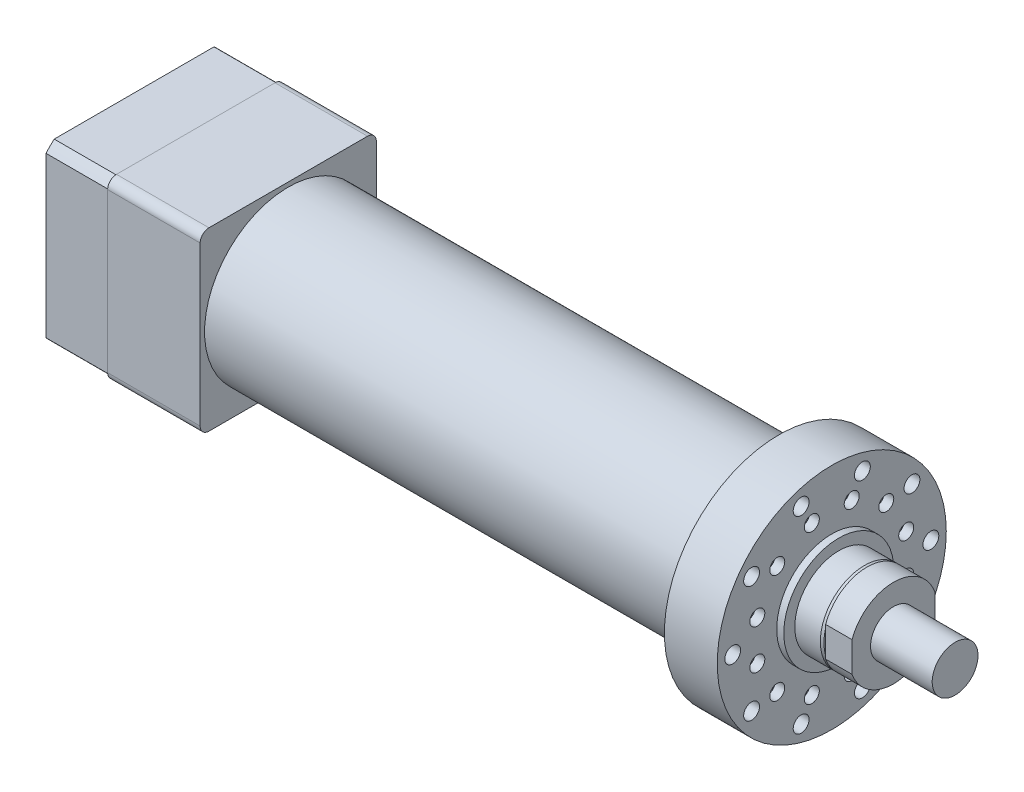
ISO-10303-21;
HEADER;
FILE_DESCRIPTION(('STEP AP214'),'2;1');
FILE_NAME('part.step','',(''),(''),'','','');
FILE_SCHEMA(('AUTOMOTIVE_DESIGN { 1 0 10303 214 1 1 1 1 }'));
ENDSEC;
DATA;
#1=APPLICATION_CONTEXT('core data for automotive mechanical design processes');
#2=APPLICATION_PROTOCOL_DEFINITION('international standard','automotive_design',2000,#1);
#3=PRODUCT_CONTEXT('',#1,'mechanical');
#4=PRODUCT('Part','Part','',(#3));
#5=PRODUCT_RELATED_PRODUCT_CATEGORY('part','',(#4));
#6=PRODUCT_DEFINITION_FORMATION('','',#4);
#7=PRODUCT_DEFINITION_CONTEXT('part definition',#1,'design');
#8=PRODUCT_DEFINITION('design','',#6,#7);
#9=PRODUCT_DEFINITION_SHAPE('','',#8);
#10=(LENGTH_UNIT() NAMED_UNIT(*) SI_UNIT(.MILLI.,.METRE.));
#11=(NAMED_UNIT(*) PLANE_ANGLE_UNIT() SI_UNIT($,.RADIAN.));
#12=(NAMED_UNIT(*) SI_UNIT($,.STERADIAN.) SOLID_ANGLE_UNIT());
#13=UNCERTAINTY_MEASURE_WITH_UNIT(LENGTH_MEASURE(1.E-05),#10,'distance_accuracy_value','');
#14=(GEOMETRIC_REPRESENTATION_CONTEXT(3) GLOBAL_UNCERTAINTY_ASSIGNED_CONTEXT((#13)) GLOBAL_UNIT_ASSIGNED_CONTEXT((#10,
#11,#12)) REPRESENTATION_CONTEXT('',''));
#15=CARTESIAN_POINT('',(0.,0.,0.));
#16=DIRECTION('',(0.,0.,1.));
#17=DIRECTION('',(1.,0.,0.));
#18=AXIS2_PLACEMENT_3D('',#15,#16,#17);
#19=CARTESIAN_POINT('',(757.,0.,0.));
#20=DIRECTION('',(-1.,0.,0.));
#21=DIRECTION('',(0.,0.,1.));
#22=AXIS2_PLACEMENT_3D('',#19,#20,#21);
#23=CYLINDRICAL_SURFACE('',#22,26.);
#24=CARTESIAN_POINT('',(757.,0.,0.));
#25=DIRECTION('',(1.,0.,0.));
#26=DIRECTION('',(0.,0.,-1.));
#27=AXIS2_PLACEMENT_3D('',#24,#25,#26);
#28=CIRCLE('',#27,26.);
#29=CARTESIAN_POINT('',(757.,0.,-26.));
#30=VERTEX_POINT('',#29);
#31=EDGE_CURVE('E11',#30,#30,#28,.T.);
#32=ORIENTED_EDGE('',*,*,#31,.F.);
#33=EDGE_LOOP('',(#32));
#34=FACE_BOUND('',#33,.T.);
#35=CARTESIAN_POINT('',(687.,0.,0.));
#36=DIRECTION('',(1.,0.,0.));
#37=DIRECTION('',(0.,0.,-1.));
#38=AXIS2_PLACEMENT_3D('',#35,#36,#37);
#39=CIRCLE('',#38,26.);
#40=CARTESIAN_POINT('',(687.,0.,-26.));
#41=VERTEX_POINT('',#40);
#42=EDGE_CURVE('E49',#41,#41,#39,.T.);
#43=ORIENTED_EDGE('',*,*,#42,.T.);
#44=EDGE_LOOP('',(#43));
#45=FACE_BOUND('',#44,.T.);
#46=ADVANCED_FACE('F46',(#34,#45),#23,.T.);
#47=CARTESIAN_POINT('',(757.,0.,0.));
#48=DIRECTION('',(1.,0.,0.));
#49=DIRECTION('',(0.,0.,-1.));
#50=AXIS2_PLACEMENT_3D('',#47,#48,#49);
#51=PLANE('',#50);
#52=ORIENTED_EDGE('',*,*,#31,.T.);
#53=EDGE_LOOP('',(#52));
#54=FACE_BOUND('',#53,.T.);
#55=ADVANCED_FACE('F61',(#54),#51,.T.);
#56=CARTESIAN_POINT('',(687.,0.,0.));
#57=DIRECTION('',(1.,0.,0.));
#58=DIRECTION('',(0.,0.,-1.));
#59=AXIS2_PLACEMENT_3D('',#56,#57,#58);
#60=PLANE('',#59);
#61=ORIENTED_EDGE('',*,*,#42,.F.);
#62=EDGE_LOOP('',(#61));
#63=FACE_BOUND('',#62,.T.);
#64=ADVANCED_FACE('F59',(#63),#60,.F.);
#65=CLOSED_SHELL('',(#46,#55,#64));
#66=MANIFOLD_SOLID_BREP('B2',#65);
#67=CARTESIAN_POINT('',(-105.,43.7500000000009,-75.7772228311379));
#68=DIRECTION('',(-1.,0.,0.));
#69=DIRECTION('',(0.,0.,1.));
#70=AXIS2_PLACEMENT_3D('',#67,#68,#69);
#71=CYLINDRICAL_SURFACE('',#70,5.50000000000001);
#72=CARTESIAN_POINT('',(-105.,43.7500000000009,-75.7772228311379));
#73=DIRECTION('',(-1.,0.,0.));
#74=DIRECTION('',(0.,0.,1.));
#75=AXIS2_PLACEMENT_3D('',#72,#73,#74);
#76=CIRCLE('',#75,5.50000000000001);
#77=CARTESIAN_POINT('',(-105.,43.7500000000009,-70.2772228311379));
#78=VERTEX_POINT('',#77);
#79=EDGE_CURVE('E273',#78,#78,#76,.T.);
#80=ORIENTED_EDGE('',*,*,#79,.F.);
#81=EDGE_LOOP('',(#80));
#82=FACE_BOUND('',#81,.T.);
#83=CARTESIAN_POINT('',(-163.,43.7500000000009,-75.7772228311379));
#84=DIRECTION('',(-1.,0.,0.));
#85=DIRECTION('',(0.,0.,1.));
#86=AXIS2_PLACEMENT_3D('',#83,#84,#85);
#87=CIRCLE('',#86,5.50000000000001);
#88=CARTESIAN_POINT('',(-163.,43.7500000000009,-70.2772228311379));
#89=VERTEX_POINT('',#88);
#90=EDGE_CURVE('E100',#89,#89,#87,.F.);
#91=ORIENTED_EDGE('',*,*,#90,.F.);
#92=EDGE_LOOP('',(#91));
#93=FACE_BOUND('',#92,.T.);
#94=ADVANCED_FACE('F96',(#82,#93),#71,.F.);
#95=CARTESIAN_POINT('',(-105.,9.16513851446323E-13,-87.5));
#96=DIRECTION('',(-1.,0.,0.));
#97=DIRECTION('',(0.,0.,1.));
#98=AXIS2_PLACEMENT_3D('',#95,#96,#97);
#99=CYLINDRICAL_SURFACE('',#98,5.5);
#100=CARTESIAN_POINT('',(-105.,9.16513851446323E-13,-87.5));
#101=DIRECTION('',(-1.,0.,0.));
#102=DIRECTION('',(0.,0.,1.));
#103=AXIS2_PLACEMENT_3D('',#100,#101,#102);
#104=CIRCLE('',#103,5.5);
#105=CARTESIAN_POINT('',(-105.,9.16513851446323E-13,-82.));
#106=VERTEX_POINT('',#105);
#107=EDGE_CURVE('E257',#106,#106,#104,.T.);
#108=ORIENTED_EDGE('',*,*,#107,.F.);
#109=EDGE_LOOP('',(#108));
#110=FACE_BOUND('',#109,.T.);
#111=CARTESIAN_POINT('',(-163.,9.16513851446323E-13,-87.5));
#112=DIRECTION('',(-1.,0.,0.));
#113=DIRECTION('',(0.,0.,1.));
#114=AXIS2_PLACEMENT_3D('',#111,#112,#113);
#115=CIRCLE('',#114,5.5);
#116=CARTESIAN_POINT('',(-163.,9.16513851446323E-13,-82.));
#117=VERTEX_POINT('',#116);
#118=EDGE_CURVE('E252',#117,#117,#115,.F.);
#119=ORIENTED_EDGE('',*,*,#118,.F.);
#120=EDGE_LOOP('',(#119));
#121=FACE_BOUND('',#120,.T.);
#122=ADVANCED_FACE('F366',(#110,#121),#99,.F.);
#123=CARTESIAN_POINT('',(-105.,-43.7499999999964,-75.7772228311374));
#124=DIRECTION('',(-1.,0.,0.));
#125=DIRECTION('',(0.,0.,1.));
#126=AXIS2_PLACEMENT_3D('',#123,#124,#125);
#127=CYLINDRICAL_SURFACE('',#126,5.49999999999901);
#128=CARTESIAN_POINT('',(-105.,-43.7499999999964,-75.7772228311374));
#129=DIRECTION('',(-1.,0.,0.));
#130=DIRECTION('',(0.,0.,1.));
#131=AXIS2_PLACEMENT_3D('',#128,#129,#130);
#132=CIRCLE('',#131,5.49999999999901);
#133=CARTESIAN_POINT('',(-105.,-43.7499999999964,-70.2772228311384));
#134=VERTEX_POINT('',#133);
#135=EDGE_CURVE('E261',#134,#134,#132,.T.);
#136=ORIENTED_EDGE('',*,*,#135,.F.);
#137=EDGE_LOOP('',(#136));
#138=FACE_BOUND('',#137,.T.);
#139=CARTESIAN_POINT('',(-163.,-43.7499999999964,-75.7772228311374));
#140=DIRECTION('',(-1.,0.,0.));
#141=DIRECTION('',(0.,0.,1.));
#142=AXIS2_PLACEMENT_3D('',#139,#140,#141);
#143=CIRCLE('',#142,5.49999999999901);
#144=CARTESIAN_POINT('',(-163.,-43.7499999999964,-70.2772228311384));
#145=VERTEX_POINT('',#144);
#146=EDGE_CURVE('E250',#145,#145,#143,.F.);
#147=ORIENTED_EDGE('',*,*,#146,.F.);
#148=EDGE_LOOP('',(#147));
#149=FACE_BOUND('',#148,.T.);
#150=ADVANCED_FACE('F372',(#138,#149),#127,.F.);
#151=CARTESIAN_POINT('',(-105.,-75.7772228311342,-43.75));
#152=DIRECTION('',(-1.,0.,0.));
#153=DIRECTION('',(0.,0.,1.));
#154=AXIS2_PLACEMENT_3D('',#151,#152,#153);
#155=CYLINDRICAL_SURFACE('',#154,5.49999999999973);
#156=CARTESIAN_POINT('',(-105.,-75.7772228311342,-43.75));
#157=DIRECTION('',(-1.,0.,0.));
#158=DIRECTION('',(0.,0.,1.));
#159=AXIS2_PLACEMENT_3D('',#156,#157,#158);
#160=CIRCLE('',#159,5.49999999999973);
#161=CARTESIAN_POINT('',(-105.,-75.7772228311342,-38.2500000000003));
#162=VERTEX_POINT('',#161);
#163=EDGE_CURVE('E266',#162,#162,#160,.T.);
#164=ORIENTED_EDGE('',*,*,#163,.F.);
#165=EDGE_LOOP('',(#164));
#166=FACE_BOUND('',#165,.T.);
#167=CARTESIAN_POINT('',(-163.,-75.7772228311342,-43.75));
#168=DIRECTION('',(-1.,0.,0.));
#169=DIRECTION('',(0.,0.,1.));
#170=AXIS2_PLACEMENT_3D('',#167,#168,#169);
#171=CIRCLE('',#170,5.49999999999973);
#172=CARTESIAN_POINT('',(-163.,-75.7772228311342,-38.2500000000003));
#173=VERTEX_POINT('',#172);
#174=EDGE_CURVE('E247',#173,#173,#171,.F.);
#175=ORIENTED_EDGE('',*,*,#174,.F.);
#176=EDGE_LOOP('',(#175));
#177=FACE_BOUND('',#176,.T.);
#178=ADVANCED_FACE('F457',(#166,#177),#155,.F.);
#179=CARTESIAN_POINT('',(-105.,-87.4999999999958,-1.14044683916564E-12));
#180=DIRECTION('',(-1.,0.,0.));
#181=DIRECTION('',(0.,0.,1.));
#182=AXIS2_PLACEMENT_3D('',#179,#180,#181);
#183=CYLINDRICAL_SURFACE('',#182,5.50000000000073);
#184=CARTESIAN_POINT('',(-105.,-87.4999999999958,-1.14044683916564E-12));
#185=DIRECTION('',(-1.,0.,0.));
#186=DIRECTION('',(0.,0.,1.));
#187=AXIS2_PLACEMENT_3D('',#184,#185,#186);
#188=CIRCLE('',#187,5.50000000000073);
#189=CARTESIAN_POINT('',(-105.,-87.4999999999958,5.49999999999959));
#190=VERTEX_POINT('',#189);
#191=EDGE_CURVE('E292',#190,#190,#188,.T.);
#192=ORIENTED_EDGE('',*,*,#191,.F.);
#193=EDGE_LOOP('',(#192));
#194=FACE_BOUND('',#193,.T.);
#195=CARTESIAN_POINT('',(-163.,-87.4999999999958,-1.14044683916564E-12));
#196=DIRECTION('',(-1.,0.,0.));
#197=DIRECTION('',(0.,0.,1.));
#198=AXIS2_PLACEMENT_3D('',#195,#196,#197);
#199=CIRCLE('',#198,5.50000000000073);
#200=CARTESIAN_POINT('',(-163.,-87.4999999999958,5.49999999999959));
#201=VERTEX_POINT('',#200);
#202=EDGE_CURVE('E244',#201,#201,#199,.F.);
#203=ORIENTED_EDGE('',*,*,#202,.F.);
#204=EDGE_LOOP('',(#203));
#205=FACE_BOUND('',#204,.T.);
#206=ADVANCED_FACE('F379',(#194,#205),#183,.F.);
#207=CARTESIAN_POINT('',(-105.,-75.7772228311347,43.7499999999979));
#208=DIRECTION('',(-1.,0.,0.));
#209=DIRECTION('',(0.,0.,1.));
#210=AXIS2_PLACEMENT_3D('',#207,#208,#209);
#211=CYLINDRICAL_SURFACE('',#210,5.50000000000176);
#212=CARTESIAN_POINT('',(-105.,-75.7772228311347,43.7499999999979));
#213=DIRECTION('',(-1.,0.,0.));
#214=DIRECTION('',(0.,0.,1.));
#215=AXIS2_PLACEMENT_3D('',#212,#213,#214);
#216=CIRCLE('',#215,5.50000000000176);
#217=CARTESIAN_POINT('',(-105.,-75.7772228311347,49.2499999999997));
#218=VERTEX_POINT('',#217);
#219=EDGE_CURVE('E289',#218,#218,#216,.T.);
#220=ORIENTED_EDGE('',*,*,#219,.F.);
#221=EDGE_LOOP('',(#220));
#222=FACE_BOUND('',#221,.T.);
#223=CARTESIAN_POINT('',(-163.,-75.7772228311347,43.7499999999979));
#224=DIRECTION('',(-1.,0.,0.));
#225=DIRECTION('',(0.,0.,1.));
#226=AXIS2_PLACEMENT_3D('',#223,#224,#225);
#227=CIRCLE('',#226,5.50000000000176);
#228=CARTESIAN_POINT('',(-163.,-75.7772228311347,49.2499999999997));
#229=VERTEX_POINT('',#228);
#230=EDGE_CURVE('E241',#229,#229,#227,.F.);
#231=ORIENTED_EDGE('',*,*,#230,.F.);
#232=EDGE_LOOP('',(#231));
#233=FACE_BOUND('',#232,.T.);
#234=ADVANCED_FACE('F576',(#222,#233),#211,.F.);
#235=CARTESIAN_POINT('',(-105.,-43.7499999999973,75.7772228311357));
#236=DIRECTION('',(-1.,0.,0.));
#237=DIRECTION('',(0.,0.,1.));
#238=AXIS2_PLACEMENT_3D('',#235,#236,#237);
#239=CYLINDRICAL_SURFACE('',#238,5.5000000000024);
#240=CARTESIAN_POINT('',(-105.,-43.7499999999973,75.7772228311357));
#241=DIRECTION('',(-1.,0.,0.));
#242=DIRECTION('',(0.,0.,1.));
#243=AXIS2_PLACEMENT_3D('',#240,#241,#242);
#244=CIRCLE('',#243,5.5000000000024);
#245=CARTESIAN_POINT('',(-105.,-43.7499999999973,81.2772228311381));
#246=VERTEX_POINT('',#245);
#247=EDGE_CURVE('E286',#246,#246,#244,.T.);
#248=ORIENTED_EDGE('',*,*,#247,.F.);
#249=EDGE_LOOP('',(#248));
#250=FACE_BOUND('',#249,.T.);
#251=CARTESIAN_POINT('',(-163.,-43.7499999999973,75.7772228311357));
#252=DIRECTION('',(-1.,0.,0.));
#253=DIRECTION('',(0.,0.,1.));
#254=AXIS2_PLACEMENT_3D('',#251,#252,#253);
#255=CIRCLE('',#254,5.5000000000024);
#256=CARTESIAN_POINT('',(-163.,-43.7499999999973,81.2772228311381));
#257=VERTEX_POINT('',#256);
#258=EDGE_CURVE('E238',#257,#257,#255,.F.);
#259=ORIENTED_EDGE('',*,*,#258,.F.);
#260=EDGE_LOOP('',(#259));
#261=FACE_BOUND('',#260,.T.);
#262=ADVANCED_FACE('F573',(#250,#261),#239,.F.);
#263=CARTESIAN_POINT('',(-105.,1.53920032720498E-12,87.4999999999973));
#264=DIRECTION('',(-1.,0.,0.));
#265=DIRECTION('',(0.,0.,1.));
#266=AXIS2_PLACEMENT_3D('',#263,#264,#265);
#267=CYLINDRICAL_SURFACE('',#266,5.50000000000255);
#268=CARTESIAN_POINT('',(-105.,1.53920032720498E-12,87.4999999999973));
#269=DIRECTION('',(-1.,0.,0.));
#270=DIRECTION('',(0.,0.,1.));
#271=AXIS2_PLACEMENT_3D('',#268,#269,#270);
#272=CIRCLE('',#271,5.50000000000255);
#273=CARTESIAN_POINT('',(-105.,1.53920032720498E-12,92.9999999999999));
#274=VERTEX_POINT('',#273);
#275=EDGE_CURVE('E283',#274,#274,#272,.T.);
#276=ORIENTED_EDGE('',*,*,#275,.F.);
#277=EDGE_LOOP('',(#276));
#278=FACE_BOUND('',#277,.T.);
#279=CARTESIAN_POINT('',(-163.,1.53920032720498E-12,87.4999999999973));
#280=DIRECTION('',(-1.,0.,0.));
#281=DIRECTION('',(0.,0.,1.));
#282=AXIS2_PLACEMENT_3D('',#279,#280,#281);
#283=CIRCLE('',#282,5.50000000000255);
#284=CARTESIAN_POINT('',(-163.,1.53920032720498E-12,92.9999999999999));
#285=VERTEX_POINT('',#284);
#286=EDGE_CURVE('E235',#285,#285,#283,.F.);
#287=ORIENTED_EDGE('',*,*,#286,.F.);
#288=EDGE_LOOP('',(#287));
#289=FACE_BOUND('',#288,.T.);
#290=ADVANCED_FACE('F569',(#278,#289),#267,.F.);
#291=CARTESIAN_POINT('',(-105.,43.7499999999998,75.7772228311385));
#292=DIRECTION('',(-1.,0.,0.));
#293=DIRECTION('',(0.,0.,1.));
#294=AXIS2_PLACEMENT_3D('',#291,#292,#293);
#295=CYLINDRICAL_SURFACE('',#294,5.49999999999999);
#296=CARTESIAN_POINT('',(-105.,43.7499999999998,75.7772228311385));
#297=DIRECTION('',(-1.,0.,0.));
#298=DIRECTION('',(0.,0.,1.));
#299=AXIS2_PLACEMENT_3D('',#296,#297,#298);
#300=CIRCLE('',#299,5.49999999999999);
#301=CARTESIAN_POINT('',(-105.,43.7499999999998,81.2772228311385));
#302=VERTEX_POINT('',#301);
#303=EDGE_CURVE('E280',#302,#302,#300,.T.);
#304=ORIENTED_EDGE('',*,*,#303,.F.);
#305=EDGE_LOOP('',(#304));
#306=FACE_BOUND('',#305,.T.);
#307=CARTESIAN_POINT('',(-163.,43.7499999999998,75.7772228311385));
#308=DIRECTION('',(-1.,0.,0.));
#309=DIRECTION('',(0.,0.,1.));
#310=AXIS2_PLACEMENT_3D('',#307,#308,#309);
#311=CIRCLE('',#310,5.49999999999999);
#312=CARTESIAN_POINT('',(-163.,43.7499999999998,81.2772228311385));
#313=VERTEX_POINT('',#312);
#314=EDGE_CURVE('E232',#313,#313,#311,.F.);
#315=ORIENTED_EDGE('',*,*,#314,.F.);
#316=EDGE_LOOP('',(#315));
#317=FACE_BOUND('',#316,.T.);
#318=ADVANCED_FACE('F565',(#306,#317),#295,.F.);
#319=CARTESIAN_POINT('',(-105.,75.7772228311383,43.7500000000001));
#320=DIRECTION('',(-1.,0.,0.));
#321=DIRECTION('',(0.,0.,1.));
#322=AXIS2_PLACEMENT_3D('',#319,#320,#321);
#323=CYLINDRICAL_SURFACE('',#322,5.5);
#324=CARTESIAN_POINT('',(-105.,75.7772228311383,43.7500000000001));
#325=DIRECTION('',(-1.,0.,0.));
#326=DIRECTION('',(0.,0.,1.));
#327=AXIS2_PLACEMENT_3D('',#324,#325,#326);
#328=CIRCLE('',#327,5.5);
#329=CARTESIAN_POINT('',(-105.,75.7772228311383,49.2500000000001));
#330=VERTEX_POINT('',#329);
#331=EDGE_CURVE('E277',#330,#330,#328,.T.);
#332=ORIENTED_EDGE('',*,*,#331,.F.);
#333=EDGE_LOOP('',(#332));
#334=FACE_BOUND('',#333,.T.);
#335=CARTESIAN_POINT('',(-163.,75.7772228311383,43.7500000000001));
#336=DIRECTION('',(-1.,0.,0.));
#337=DIRECTION('',(0.,0.,1.));
#338=AXIS2_PLACEMENT_3D('',#335,#336,#337);
#339=CIRCLE('',#338,5.5);
#340=CARTESIAN_POINT('',(-163.,75.7772228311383,49.2500000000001));
#341=VERTEX_POINT('',#340);
#342=EDGE_CURVE('E229',#341,#341,#339,.F.);
#343=ORIENTED_EDGE('',*,*,#342,.F.);
#344=EDGE_LOOP('',(#343));
#345=FACE_BOUND('',#344,.T.);
#346=ADVANCED_FACE('F561',(#334,#345),#323,.F.);
#347=CARTESIAN_POINT('',(-105.,87.5,0.));
#348=DIRECTION('',(-1.,0.,0.));
#349=DIRECTION('',(0.,0.,1.));
#350=AXIS2_PLACEMENT_3D('',#347,#348,#349);
#351=CYLINDRICAL_SURFACE('',#350,5.5);
#352=CARTESIAN_POINT('',(-105.,87.5,0.));
#353=DIRECTION('',(-1.,0.,0.));
#354=DIRECTION('',(0.,0.,1.));
#355=AXIS2_PLACEMENT_3D('',#352,#353,#354);
#356=CIRCLE('',#355,5.5);
#357=CARTESIAN_POINT('',(-105.,87.5,5.5));
#358=VERTEX_POINT('',#357);
#359=EDGE_CURVE('E274',#358,#358,#356,.T.);
#360=ORIENTED_EDGE('',*,*,#359,.F.);
#361=EDGE_LOOP('',(#360));
#362=FACE_BOUND('',#361,.T.);
#363=CARTESIAN_POINT('',(-163.,87.5,0.));
#364=DIRECTION('',(-1.,0.,0.));
#365=DIRECTION('',(0.,0.,1.));
#366=AXIS2_PLACEMENT_3D('',#363,#364,#365);
#367=CIRCLE('',#366,5.5);
#368=CARTESIAN_POINT('',(-163.,87.5,5.5));
#369=VERTEX_POINT('',#368);
#370=EDGE_CURVE('E225',#369,#369,#367,.F.);
#371=ORIENTED_EDGE('',*,*,#370,.F.);
#372=EDGE_LOOP('',(#371));
#373=FACE_BOUND('',#372,.T.);
#374=ADVANCED_FACE('F557',(#362,#373),#351,.F.);
#375=CARTESIAN_POINT('',(-105.,75.7772228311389,-43.749999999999));
#376=DIRECTION('',(-1.,0.,0.));
#377=DIRECTION('',(0.,0.,1.));
#378=AXIS2_PLACEMENT_3D('',#375,#376,#377);
#379=CYLINDRICAL_SURFACE('',#378,5.5);
#380=CARTESIAN_POINT('',(-105.,75.7772228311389,-43.749999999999));
#381=DIRECTION('',(-1.,0.,0.));
#382=DIRECTION('',(0.,0.,1.));
#383=AXIS2_PLACEMENT_3D('',#380,#381,#382);
#384=CIRCLE('',#383,5.5);
#385=CARTESIAN_POINT('',(-105.,75.7772228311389,-38.249999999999));
#386=VERTEX_POINT('',#385);
#387=EDGE_CURVE('E270',#386,#386,#384,.T.);
#388=ORIENTED_EDGE('',*,*,#387,.F.);
#389=EDGE_LOOP('',(#388));
#390=FACE_BOUND('',#389,.T.);
#391=CARTESIAN_POINT('',(-163.,75.7772228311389,-43.749999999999));
#392=DIRECTION('',(-1.,0.,0.));
#393=DIRECTION('',(0.,0.,1.));
#394=AXIS2_PLACEMENT_3D('',#391,#392,#393);
#395=CIRCLE('',#394,5.5);
#396=CARTESIAN_POINT('',(-163.,75.7772228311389,-38.249999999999));
#397=VERTEX_POINT('',#396);
#398=EDGE_CURVE('E222',#397,#397,#395,.F.);
#399=ORIENTED_EDGE('',*,*,#398,.F.);
#400=EDGE_LOOP('',(#399));
#401=FACE_BOUND('',#400,.T.);
#402=ADVANCED_FACE('F554',(#390,#401),#379,.F.);
#403=CARTESIAN_POINT('',(-175.,0.,0.));
#404=DIRECTION('',(1.,0.,0.));
#405=DIRECTION('',(0.,0.,-1.));
#406=AXIS2_PLACEMENT_3D('',#403,#404,#405);
#407=CYLINDRICAL_SURFACE('',#406,135.);
#408=CARTESIAN_POINT('',(-105.,0.,0.));
#409=DIRECTION('',(-1.,0.,0.));
#410=DIRECTION('',(0.,0.,1.));
#411=AXIS2_PLACEMENT_3D('',#408,#409,#410);
#412=CIRCLE('',#411,135.);
#413=CARTESIAN_POINT('',(-105.,100.,-90.6917857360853));
#414=VERTEX_POINT('',#413);
#415=CARTESIAN_POINT('',(-105.,90.6917857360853,-100.));
#416=VERTEX_POINT('',#415);
#417=EDGE_CURVE('E195',#414,#416,#412,.T.);
#418=ORIENTED_EDGE('',*,*,#417,.T.);
#419=DIRECTION('',(1.,0.,0.));
#420=VECTOR('',#419,1.);
#421=CARTESIAN_POINT('',(-175.,90.6917857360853,-100.));
#422=LINE('',#421,#420);
#423=CARTESIAN_POINT('',(-175.,90.6917857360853,-100.));
#424=VERTEX_POINT('',#423);
#425=EDGE_CURVE('E44',#424,#416,#422,.T.);
#426=ORIENTED_EDGE('',*,*,#425,.F.);
#427=CARTESIAN_POINT('',(-175.,0.,0.));
#428=DIRECTION('',(-1.,0.,0.));
#429=DIRECTION('',(0.,0.,1.));
#430=AXIS2_PLACEMENT_3D('',#427,#428,#429);
#431=CIRCLE('',#430,135.);
#432=CARTESIAN_POINT('',(-175.,100.,-90.6917857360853));
#433=VERTEX_POINT('',#432);
#434=EDGE_CURVE('E210',#433,#424,#431,.T.);
#435=ORIENTED_EDGE('',*,*,#434,.F.);
#436=DIRECTION('',(1.,0.,0.));
#437=VECTOR('',#436,1.);
#438=CARTESIAN_POINT('',(-175.,100.,-90.6917857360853));
#439=LINE('',#438,#437);
#440=EDGE_CURVE('E191',#433,#414,#439,.T.);
#441=ORIENTED_EDGE('',*,*,#440,.T.);
#442=EDGE_LOOP('',(#418,#426,#435,#441));
#443=FACE_BOUND('',#442,.T.);
#444=ADVANCED_FACE('F98',(#443),#407,.T.);
#445=CARTESIAN_POINT('',(-175.,90.6917857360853,-100.));
#446=DIRECTION('',(0.,0.,1.));
#447=DIRECTION('',(0.,-1.,0.));
#448=AXIS2_PLACEMENT_3D('',#445,#446,#447);
#449=PLANE('',#448);
#450=DIRECTION('',(0.,-1.,0.));
#451=VECTOR('',#450,1.);
#452=CARTESIAN_POINT('',(-105.,90.6917857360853,-100.));
#453=LINE('',#452,#451);
#454=CARTESIAN_POINT('',(-105.,-90.6917857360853,-100.));
#455=VERTEX_POINT('',#454);
#456=EDGE_CURVE('E198',#416,#455,#453,.T.);
#457=ORIENTED_EDGE('',*,*,#456,.T.);
#458=DIRECTION('',(1.,0.,0.));
#459=VECTOR('',#458,1.);
#460=CARTESIAN_POINT('',(-175.,-90.6917857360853,-100.));
#461=LINE('',#460,#459);
#462=CARTESIAN_POINT('',(-175.,-90.6917857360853,-100.));
#463=VERTEX_POINT('',#462);
#464=EDGE_CURVE('E106',#463,#455,#461,.T.);
#465=ORIENTED_EDGE('',*,*,#464,.F.);
#466=DIRECTION('',(0.,-1.,0.));
#467=VECTOR('',#466,1.);
#468=CARTESIAN_POINT('',(-175.,90.6917857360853,-100.));
#469=LINE('',#468,#467);
#470=EDGE_CURVE('E158',#424,#463,#469,.T.);
#471=ORIENTED_EDGE('',*,*,#470,.F.);
#472=ORIENTED_EDGE('',*,*,#425,.T.);
#473=EDGE_LOOP('',(#457,#465,#471,#472));
#474=FACE_BOUND('',#473,.T.);
#475=ADVANCED_FACE('F1045',(#474),#449,.F.);
#476=CARTESIAN_POINT('',(-175.,0.,0.));
#477=DIRECTION('',(1.,0.,0.));
#478=DIRECTION('',(0.,0.,-1.));
#479=AXIS2_PLACEMENT_3D('',#476,#477,#478);
#480=CYLINDRICAL_SURFACE('',#479,135.);
#481=CARTESIAN_POINT('',(-105.,0.,0.));
#482=DIRECTION('',(-1.,0.,0.));
#483=DIRECTION('',(0.,0.,1.));
#484=AXIS2_PLACEMENT_3D('',#481,#482,#483);
#485=CIRCLE('',#484,135.);
#486=CARTESIAN_POINT('',(-105.,-100.,-90.6917857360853));
#487=VERTEX_POINT('',#486);
#488=EDGE_CURVE('E201',#455,#487,#485,.T.);
#489=ORIENTED_EDGE('',*,*,#488,.T.);
#490=DIRECTION('',(1.,0.,0.));
#491=VECTOR('',#490,1.);
#492=CARTESIAN_POINT('',(-175.,-100.,-90.6917857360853));
#493=LINE('',#492,#491);
#494=CARTESIAN_POINT('',(-175.,-100.,-90.6917857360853));
#495=VERTEX_POINT('',#494);
#496=EDGE_CURVE('E217',#495,#487,#493,.T.);
#497=ORIENTED_EDGE('',*,*,#496,.F.);
#498=CARTESIAN_POINT('',(-175.,0.,0.));
#499=DIRECTION('',(-1.,0.,0.));
#500=DIRECTION('',(0.,0.,1.));
#501=AXIS2_PLACEMENT_3D('',#498,#499,#500);
#502=CIRCLE('',#501,135.);
#503=EDGE_CURVE('E334',#463,#495,#502,.T.);
#504=ORIENTED_EDGE('',*,*,#503,.F.);
#505=ORIENTED_EDGE('',*,*,#464,.T.);
#506=EDGE_LOOP('',(#489,#497,#504,#505));
#507=FACE_BOUND('',#506,.T.);
#508=ADVANCED_FACE('F1037',(#507),#480,.T.);
#509=CARTESIAN_POINT('',(-175.,-100.,-90.6917857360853));
#510=DIRECTION('',(0.,1.,0.));
#511=DIRECTION('',(0.,0.,1.));
#512=AXIS2_PLACEMENT_3D('',#509,#510,#511);
#513=PLANE('',#512);
#514=DIRECTION('',(0.,0.,1.));
#515=VECTOR('',#514,1.);
#516=CARTESIAN_POINT('',(-105.,-100.,-90.6917857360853));
#517=LINE('',#516,#515);
#518=CARTESIAN_POINT('',(-105.,-100.,90.6917857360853));
#519=VERTEX_POINT('',#518);
#520=EDGE_CURVE('E203',#487,#519,#517,.T.);
#521=ORIENTED_EDGE('',*,*,#520,.T.);
#522=DIRECTION('',(1.,0.,0.));
#523=VECTOR('',#522,1.);
#524=CARTESIAN_POINT('',(-175.,-100.,90.6917857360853));
#525=LINE('',#524,#523);
#526=CARTESIAN_POINT('',(-175.,-100.,90.6917857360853));
#527=VERTEX_POINT('',#526);
#528=EDGE_CURVE('E214',#527,#519,#525,.T.);
#529=ORIENTED_EDGE('',*,*,#528,.F.);
#530=DIRECTION('',(0.,0.,1.));
#531=VECTOR('',#530,1.);
#532=CARTESIAN_POINT('',(-175.,-100.,-90.6917857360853));
#533=LINE('',#532,#531);
#534=EDGE_CURVE('E336',#495,#527,#533,.T.);
#535=ORIENTED_EDGE('',*,*,#534,.F.);
#536=ORIENTED_EDGE('',*,*,#496,.T.);
#537=EDGE_LOOP('',(#521,#529,#535,#536));
#538=FACE_BOUND('',#537,.T.);
#539=ADVANCED_FACE('F342',(#538),#513,.F.);
#540=CARTESIAN_POINT('',(-175.,0.,0.));
#541=DIRECTION('',(1.,0.,0.));
#542=DIRECTION('',(0.,0.,-1.));
#543=AXIS2_PLACEMENT_3D('',#540,#541,#542);
#544=CYLINDRICAL_SURFACE('',#543,135.);
#545=CARTESIAN_POINT('',(-105.,0.,0.));
#546=DIRECTION('',(-1.,0.,0.));
#547=DIRECTION('',(0.,0.,1.));
#548=AXIS2_PLACEMENT_3D('',#545,#546,#547);
#549=CIRCLE('',#548,135.);
#550=CARTESIAN_POINT('',(-105.,-90.6917857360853,100.));
#551=VERTEX_POINT('',#550);
#552=EDGE_CURVE('E205',#519,#551,#549,.T.);
#553=ORIENTED_EDGE('',*,*,#552,.T.);
#554=DIRECTION('',(1.,0.,0.));
#555=VECTOR('',#554,1.);
#556=CARTESIAN_POINT('',(-175.,-90.6917857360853,100.));
#557=LINE('',#556,#555);
#558=CARTESIAN_POINT('',(-175.,-90.6917857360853,100.));
#559=VERTEX_POINT('',#558);
#560=EDGE_CURVE('E186',#559,#551,#557,.T.);
#561=ORIENTED_EDGE('',*,*,#560,.F.);
#562=CARTESIAN_POINT('',(-175.,0.,0.));
#563=DIRECTION('',(-1.,0.,0.));
#564=DIRECTION('',(0.,0.,1.));
#565=AXIS2_PLACEMENT_3D('',#562,#563,#564);
#566=CIRCLE('',#565,135.);
#567=EDGE_CURVE('E177',#527,#559,#566,.T.);
#568=ORIENTED_EDGE('',*,*,#567,.F.);
#569=ORIENTED_EDGE('',*,*,#528,.T.);
#570=EDGE_LOOP('',(#553,#561,#568,#569));
#571=FACE_BOUND('',#570,.T.);
#572=ADVANCED_FACE('F346',(#571),#544,.T.);
#573=CARTESIAN_POINT('',(-175.,90.6917857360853,100.));
#574=DIRECTION('',(0.,0.,-1.));
#575=DIRECTION('',(0.,1.,0.));
#576=AXIS2_PLACEMENT_3D('',#573,#574,#575);
#577=PLANE('',#576);
#578=DIRECTION('',(0.,1.,0.));
#579=VECTOR('',#578,1.);
#580=CARTESIAN_POINT('',(-105.,90.6917857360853,100.));
#581=LINE('',#580,#579);
#582=CARTESIAN_POINT('',(-105.,90.6917857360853,100.));
#583=VERTEX_POINT('',#582);
#584=EDGE_CURVE('E185',#551,#583,#581,.T.);
#585=ORIENTED_EDGE('',*,*,#584,.T.);
#586=DIRECTION('',(1.,0.,0.));
#587=VECTOR('',#586,1.);
#588=CARTESIAN_POINT('',(-175.,90.6917857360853,100.));
#589=LINE('',#588,#587);
#590=CARTESIAN_POINT('',(-175.,90.6917857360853,100.));
#591=VERTEX_POINT('',#590);
#592=EDGE_CURVE('E182',#591,#583,#589,.T.);
#593=ORIENTED_EDGE('',*,*,#592,.F.);
#594=DIRECTION('',(0.,1.,0.));
#595=VECTOR('',#594,1.);
#596=CARTESIAN_POINT('',(-175.,90.6917857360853,100.));
#597=LINE('',#596,#595);
#598=EDGE_CURVE('E171',#559,#591,#597,.T.);
#599=ORIENTED_EDGE('',*,*,#598,.F.);
#600=ORIENTED_EDGE('',*,*,#560,.T.);
#601=EDGE_LOOP('',(#585,#593,#599,#600));
#602=FACE_BOUND('',#601,.T.);
#603=ADVANCED_FACE('F183',(#602),#577,.F.);
#604=CARTESIAN_POINT('',(-175.,0.,0.));
#605=DIRECTION('',(1.,0.,0.));
#606=DIRECTION('',(0.,0.,-1.));
#607=AXIS2_PLACEMENT_3D('',#604,#605,#606);
#608=CYLINDRICAL_SURFACE('',#607,135.);
#609=CARTESIAN_POINT('',(-105.,0.,0.));
#610=DIRECTION('',(-1.,0.,0.));
#611=DIRECTION('',(0.,0.,1.));
#612=AXIS2_PLACEMENT_3D('',#609,#610,#611);
#613=CIRCLE('',#612,135.);
#614=CARTESIAN_POINT('',(-105.,100.,90.6917857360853));
#615=VERTEX_POINT('',#614);
#616=EDGE_CURVE('E144',#583,#615,#613,.T.);
#617=ORIENTED_EDGE('',*,*,#616,.T.);
#618=DIRECTION('',(1.,0.,0.));
#619=VECTOR('',#618,1.);
#620=CARTESIAN_POINT('',(-175.,100.,90.6917857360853));
#621=LINE('',#620,#619);
#622=CARTESIAN_POINT('',(-175.,100.,90.6917857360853));
#623=VERTEX_POINT('',#622);
#624=EDGE_CURVE('E187',#623,#615,#621,.T.);
#625=ORIENTED_EDGE('',*,*,#624,.F.);
#626=CARTESIAN_POINT('',(-175.,0.,0.));
#627=DIRECTION('',(-1.,0.,0.));
#628=DIRECTION('',(0.,0.,1.));
#629=AXIS2_PLACEMENT_3D('',#626,#627,#628);
#630=CIRCLE('',#629,135.);
#631=EDGE_CURVE('E175',#591,#623,#630,.T.);
#632=ORIENTED_EDGE('',*,*,#631,.F.);
#633=ORIENTED_EDGE('',*,*,#592,.T.);
#634=EDGE_LOOP('',(#617,#625,#632,#633));
#635=FACE_BOUND('',#634,.T.);
#636=ADVANCED_FACE('F189',(#635),#608,.T.);
#637=CARTESIAN_POINT('',(-175.,100.,-90.6917857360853));
#638=DIRECTION('',(0.,-1.,0.));
#639=DIRECTION('',(0.,0.,-1.));
#640=AXIS2_PLACEMENT_3D('',#637,#638,#639);
#641=PLANE('',#640);
#642=DIRECTION('',(0.,0.,-1.));
#643=VECTOR('',#642,1.);
#644=CARTESIAN_POINT('',(-105.,100.,-90.6917857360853));
#645=LINE('',#644,#643);
#646=EDGE_CURVE('E150',#615,#414,#645,.T.);
#647=ORIENTED_EDGE('',*,*,#646,.T.);
#648=ORIENTED_EDGE('',*,*,#440,.F.);
#649=DIRECTION('',(0.,0.,-1.));
#650=VECTOR('',#649,1.);
#651=CARTESIAN_POINT('',(-175.,100.,-90.6917857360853));
#652=LINE('',#651,#650);
#653=EDGE_CURVE('E115',#623,#433,#652,.T.);
#654=ORIENTED_EDGE('',*,*,#653,.F.);
#655=ORIENTED_EDGE('',*,*,#624,.T.);
#656=EDGE_LOOP('',(#647,#648,#654,#655));
#657=FACE_BOUND('',#656,.T.);
#658=ADVANCED_FACE('F354',(#657),#641,.F.);
#659=CARTESIAN_POINT('',(-175.,0.,0.));
#660=DIRECTION('',(-1.,0.,0.));
#661=DIRECTION('',(0.,0.,1.));
#662=AXIS2_PLACEMENT_3D('',#659,#660,#661);
#663=PLANE('',#662);
#664=CARTESIAN_POINT('',(-175.,-75.7772228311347,43.7499999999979));
#665=DIRECTION('',(-1.,0.,0.));
#666=DIRECTION('',(0.,0.,1.));
#667=AXIS2_PLACEMENT_3D('',#664,#665,#666);
#668=CIRCLE('',#667,8.50000000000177);
#669=CARTESIAN_POINT('',(-175.,-75.7772228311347,52.2499999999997));
#670=VERTEX_POINT('',#669);
#671=EDGE_CURVE('E643',#670,#670,#668,.T.);
#672=ORIENTED_EDGE('',*,*,#671,.F.);
#673=EDGE_LOOP('',(#672));
#674=FACE_BOUND('',#673,.T.);
#675=CARTESIAN_POINT('',(-175.,-43.7499999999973,75.7772228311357));
#676=DIRECTION('',(-1.,0.,0.));
#677=DIRECTION('',(0.,0.,1.));
#678=AXIS2_PLACEMENT_3D('',#675,#676,#677);
#679=CIRCLE('',#678,8.5000000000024);
#680=CARTESIAN_POINT('',(-175.,-43.7499999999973,84.2772228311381));
#681=VERTEX_POINT('',#680);
#682=EDGE_CURVE('E637',#681,#681,#679,.T.);
#683=ORIENTED_EDGE('',*,*,#682,.F.);
#684=EDGE_LOOP('',(#683));
#685=FACE_BOUND('',#684,.T.);
#686=CARTESIAN_POINT('',(-175.,1.53920032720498E-12,87.4999999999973));
#687=DIRECTION('',(-1.,0.,0.));
#688=DIRECTION('',(0.,0.,1.));
#689=AXIS2_PLACEMENT_3D('',#686,#687,#688);
#690=CIRCLE('',#689,8.50000000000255);
#691=CARTESIAN_POINT('',(-175.,1.53920032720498E-12,95.9999999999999));
#692=VERTEX_POINT('',#691);
#693=EDGE_CURVE('E631',#692,#692,#690,.T.);
#694=ORIENTED_EDGE('',*,*,#693,.F.);
#695=EDGE_LOOP('',(#694));
#696=FACE_BOUND('',#695,.T.);
#697=CARTESIAN_POINT('',(-175.,43.7499999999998,75.7772228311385));
#698=DIRECTION('',(-1.,0.,0.));
#699=DIRECTION('',(0.,0.,1.));
#700=AXIS2_PLACEMENT_3D('',#697,#698,#699);
#701=CIRCLE('',#700,8.49999999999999);
#702=CARTESIAN_POINT('',(-175.,43.7499999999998,84.2772228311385));
#703=VERTEX_POINT('',#702);
#704=EDGE_CURVE('E624',#703,#703,#701,.T.);
#705=ORIENTED_EDGE('',*,*,#704,.F.);
#706=EDGE_LOOP('',(#705));
#707=FACE_BOUND('',#706,.T.);
#708=CARTESIAN_POINT('',(-175.,75.7772228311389,-43.749999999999));
#709=DIRECTION('',(-1.,0.,0.));
#710=DIRECTION('',(0.,0.,1.));
#711=AXIS2_PLACEMENT_3D('',#708,#709,#710);
#712=CIRCLE('',#711,8.49999999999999);
#713=CARTESIAN_POINT('',(-175.,75.7772228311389,-35.249999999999));
#714=VERTEX_POINT('',#713);
#715=EDGE_CURVE('E662',#714,#714,#712,.T.);
#716=ORIENTED_EDGE('',*,*,#715,.F.);
#717=EDGE_LOOP('',(#716));
#718=FACE_BOUND('',#717,.T.);
#719=CARTESIAN_POINT('',(-175.,43.7500000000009,-75.7772228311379));
#720=DIRECTION('',(-1.,0.,0.));
#721=DIRECTION('',(0.,0.,1.));
#722=AXIS2_PLACEMENT_3D('',#719,#720,#721);
#723=CIRCLE('',#722,8.50000000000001);
#724=CARTESIAN_POINT('',(-175.,43.7500000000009,-67.2772228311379));
#725=VERTEX_POINT('',#724);
#726=EDGE_CURVE('E669',#725,#725,#723,.T.);
#727=ORIENTED_EDGE('',*,*,#726,.F.);
#728=EDGE_LOOP('',(#727));
#729=FACE_BOUND('',#728,.T.);
#730=CARTESIAN_POINT('',(-175.,9.16513851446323E-13,-87.5));
#731=DIRECTION('',(-1.,0.,0.));
#732=DIRECTION('',(0.,0.,1.));
#733=AXIS2_PLACEMENT_3D('',#730,#731,#732);
#734=CIRCLE('',#733,8.5);
#735=CARTESIAN_POINT('',(-175.,9.16513851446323E-13,-79.));
#736=VERTEX_POINT('',#735);
#737=EDGE_CURVE('E650',#736,#736,#734,.T.);
#738=ORIENTED_EDGE('',*,*,#737,.F.);
#739=EDGE_LOOP('',(#738));
#740=FACE_BOUND('',#739,.T.);
#741=CARTESIAN_POINT('',(-175.,75.7772228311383,43.7500000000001));
#742=DIRECTION('',(-1.,0.,0.));
#743=DIRECTION('',(0.,0.,1.));
#744=AXIS2_PLACEMENT_3D('',#741,#742,#743);
#745=CIRCLE('',#744,8.5);
#746=CARTESIAN_POINT('',(-175.,75.7772228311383,52.2500000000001));
#747=VERTEX_POINT('',#746);
#748=EDGE_CURVE('E657',#747,#747,#745,.T.);
#749=ORIENTED_EDGE('',*,*,#748,.F.);
#750=EDGE_LOOP('',(#749));
#751=FACE_BOUND('',#750,.T.);
#752=CARTESIAN_POINT('',(-175.,-87.4999999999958,-1.14044683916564E-12));
#753=DIRECTION('',(-1.,0.,0.));
#754=DIRECTION('',(0.,0.,1.));
#755=AXIS2_PLACEMENT_3D('',#752,#753,#754);
#756=CIRCLE('',#755,8.50000000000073);
#757=CARTESIAN_POINT('',(-175.,-87.4999999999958,8.49999999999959));
#758=VERTEX_POINT('',#757);
#759=EDGE_CURVE('E649',#758,#758,#756,.T.);
#760=ORIENTED_EDGE('',*,*,#759,.F.);
#761=EDGE_LOOP('',(#760));
#762=FACE_BOUND('',#761,.T.);
#763=CARTESIAN_POINT('',(-175.,-75.7772228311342,-43.75));
#764=DIRECTION('',(-1.,0.,0.));
#765=DIRECTION('',(0.,0.,1.));
#766=AXIS2_PLACEMENT_3D('',#763,#764,#765);
#767=CIRCLE('',#766,8.49999999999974);
#768=CARTESIAN_POINT('',(-175.,-75.7772228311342,-35.2500000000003));
#769=VERTEX_POINT('',#768);
#770=EDGE_CURVE('E612',#769,#769,#767,.T.);
#771=ORIENTED_EDGE('',*,*,#770,.F.);
#772=EDGE_LOOP('',(#771));
#773=FACE_BOUND('',#772,.T.);
#774=CARTESIAN_POINT('',(-175.,-43.7499999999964,-75.7772228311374));
#775=DIRECTION('',(-1.,0.,0.));
#776=DIRECTION('',(0.,0.,1.));
#777=AXIS2_PLACEMENT_3D('',#774,#775,#776);
#778=CIRCLE('',#777,8.49999999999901);
#779=CARTESIAN_POINT('',(-175.,-43.7499999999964,-67.2772228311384));
#780=VERTEX_POINT('',#779);
#781=EDGE_CURVE('E613',#780,#780,#778,.T.);
#782=ORIENTED_EDGE('',*,*,#781,.F.);
#783=EDGE_LOOP('',(#782));
#784=FACE_BOUND('',#783,.T.);
#785=CARTESIAN_POINT('',(-175.,87.5,0.));
#786=DIRECTION('',(-1.,0.,0.));
#787=DIRECTION('',(0.,0.,1.));
#788=AXIS2_PLACEMENT_3D('',#785,#786,#787);
#789=CIRCLE('',#788,8.5);
#790=CARTESIAN_POINT('',(-175.,87.5,8.5));
#791=VERTEX_POINT('',#790);
#792=EDGE_CURVE('E665',#791,#791,#789,.T.);
#793=ORIENTED_EDGE('',*,*,#792,.F.);
#794=EDGE_LOOP('',(#793));
#795=FACE_BOUND('',#794,.T.);
#796=CARTESIAN_POINT('',(-175.,-58.3363094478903,-58.3363094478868));
#797=DIRECTION('',(-1.,0.,0.));
#798=DIRECTION('',(0.,0.,1.));
#799=AXIS2_PLACEMENT_3D('',#796,#797,#798);
#800=CIRCLE('',#799,5.00000000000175);
#801=CARTESIAN_POINT('',(-175.,-58.3363094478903,-53.336309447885));
#802=VERTEX_POINT('',#801);
#803=EDGE_CURVE('E311',#802,#802,#800,.T.);
#804=ORIENTED_EDGE('',*,*,#803,.F.);
#805=EDGE_LOOP('',(#804));
#806=FACE_BOUND('',#805,.T.);
#807=CARTESIAN_POINT('',(-175.,-58.3363094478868,58.3363094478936));
#808=DIRECTION('',(-1.,0.,0.));
#809=DIRECTION('',(0.,0.,1.));
#810=AXIS2_PLACEMENT_3D('',#807,#808,#809);
#811=CIRCLE('',#810,5.00000000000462);
#812=CARTESIAN_POINT('',(-175.,-58.3363094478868,63.3363094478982));
#813=VERTEX_POINT('',#812);
#814=EDGE_CURVE('E305',#813,#813,#811,.T.);
#815=ORIENTED_EDGE('',*,*,#814,.F.);
#816=EDGE_LOOP('',(#815));
#817=FACE_BOUND('',#816,.T.);
#818=CARTESIAN_POINT('',(-175.,58.3363094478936,58.3363094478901));
#819=DIRECTION('',(-1.,0.,0.));
#820=DIRECTION('',(0.,0.,1.));
#821=AXIS2_PLACEMENT_3D('',#818,#819,#820);
#822=CIRCLE('',#821,5.00000000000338);
#823=CARTESIAN_POINT('',(-175.,58.3363094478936,63.3363094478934));
#824=VERTEX_POINT('',#823);
#825=EDGE_CURVE('E298',#824,#824,#822,.T.);
#826=ORIENTED_EDGE('',*,*,#825,.F.);
#827=EDGE_LOOP('',(#826));
#828=FACE_BOUND('',#827,.T.);
#829=CARTESIAN_POINT('',(-175.,58.3363094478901,-58.3363094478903));
#830=DIRECTION('',(-1.,0.,0.));
#831=DIRECTION('',(0.,0.,1.));
#832=AXIS2_PLACEMENT_3D('',#829,#830,#831);
#833=CIRCLE('',#832,5.);
#834=CARTESIAN_POINT('',(-175.,58.3363094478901,-53.3363094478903));
#835=VERTEX_POINT('',#834);
#836=EDGE_CURVE('E301',#835,#835,#833,.T.);
#837=ORIENTED_EDGE('',*,*,#836,.F.);
#838=EDGE_LOOP('',(#837));
#839=FACE_BOUND('',#838,.T.);
#840=CARTESIAN_POINT('',(-175.,0.,0.));
#841=DIRECTION('',(-1.,0.,0.));
#842=DIRECTION('',(0.,0.,1.));
#843=AXIS2_PLACEMENT_3D('',#840,#841,#842);
#844=CIRCLE('',#843,65.);
#845=CARTESIAN_POINT('',(-175.,0.,65.));
#846=VERTEX_POINT('',#845);
#847=EDGE_CURVE('E325',#846,#846,#844,.T.);
#848=ORIENTED_EDGE('',*,*,#847,.F.);
#849=EDGE_LOOP('',(#848));
#850=FACE_BOUND('',#849,.T.);
#851=ORIENTED_EDGE('',*,*,#434,.T.);
#852=ORIENTED_EDGE('',*,*,#470,.T.);
#853=ORIENTED_EDGE('',*,*,#503,.T.);
#854=ORIENTED_EDGE('',*,*,#534,.T.);
#855=ORIENTED_EDGE('',*,*,#567,.T.);
#856=ORIENTED_EDGE('',*,*,#598,.T.);
#857=ORIENTED_EDGE('',*,*,#631,.T.);
#858=ORIENTED_EDGE('',*,*,#653,.T.);
#859=EDGE_LOOP('',(#851,#852,#853,#854,#855,#856,#857,#858));
#860=FACE_BOUND('',#859,.T.);
#861=ADVANCED_FACE('F173',(#674,#685,#696,#707,#718,#729,#740,#751,#762,#773,#784,#795,#806,
#817,#828,#839,#850,#860),#663,.T.);
#862=CARTESIAN_POINT('',(-105.,0.,0.));
#863=DIRECTION('',(-1.,0.,0.));
#864=DIRECTION('',(0.,0.,1.));
#865=AXIS2_PLACEMENT_3D('',#862,#863,#864);
#866=PLANE('',#865);
#867=ORIENTED_EDGE('',*,*,#387,.T.);
#868=EDGE_LOOP('',(#867));
#869=FACE_BOUND('',#868,.T.);
#870=ORIENTED_EDGE('',*,*,#359,.T.);
#871=EDGE_LOOP('',(#870));
#872=FACE_BOUND('',#871,.T.);
#873=ORIENTED_EDGE('',*,*,#331,.T.);
#874=EDGE_LOOP('',(#873));
#875=FACE_BOUND('',#874,.T.);
#876=ORIENTED_EDGE('',*,*,#303,.T.);
#877=EDGE_LOOP('',(#876));
#878=FACE_BOUND('',#877,.T.);
#879=ORIENTED_EDGE('',*,*,#275,.T.);
#880=EDGE_LOOP('',(#879));
#881=FACE_BOUND('',#880,.T.);
#882=ORIENTED_EDGE('',*,*,#247,.T.);
#883=EDGE_LOOP('',(#882));
#884=FACE_BOUND('',#883,.T.);
#885=ORIENTED_EDGE('',*,*,#219,.T.);
#886=EDGE_LOOP('',(#885));
#887=FACE_BOUND('',#886,.T.);
#888=ORIENTED_EDGE('',*,*,#191,.T.);
#889=EDGE_LOOP('',(#888));
#890=FACE_BOUND('',#889,.T.);
#891=ORIENTED_EDGE('',*,*,#163,.T.);
#892=EDGE_LOOP('',(#891));
#893=FACE_BOUND('',#892,.T.);
#894=ORIENTED_EDGE('',*,*,#135,.T.);
#895=EDGE_LOOP('',(#894));
#896=FACE_BOUND('',#895,.T.);
#897=ORIENTED_EDGE('',*,*,#107,.T.);
#898=EDGE_LOOP('',(#897));
#899=FACE_BOUND('',#898,.T.);
#900=ORIENTED_EDGE('',*,*,#79,.T.);
#901=EDGE_LOOP('',(#900));
#902=FACE_BOUND('',#901,.T.);
#903=ORIENTED_EDGE('',*,*,#417,.F.);
#904=ORIENTED_EDGE('',*,*,#646,.F.);
#905=ORIENTED_EDGE('',*,*,#616,.F.);
#906=ORIENTED_EDGE('',*,*,#584,.F.);
#907=ORIENTED_EDGE('',*,*,#552,.F.);
#908=ORIENTED_EDGE('',*,*,#520,.F.);
#909=ORIENTED_EDGE('',*,*,#488,.F.);
#910=ORIENTED_EDGE('',*,*,#456,.F.);
#911=EDGE_LOOP('',(#903,#904,#905,#906,#907,#908,#909,#910));
#912=FACE_BOUND('',#911,.T.);
#913=ADVANCED_FACE('F349',(#869,#872,#875,#878,#881,#884,#887,#890,#893,#896,#899,#902,#912),
#866,.F.);
#914=CARTESIAN_POINT('',(-145.,0.,0.));
#915=DIRECTION('',(-1.,0.,0.));
#916=DIRECTION('',(0.,0.,1.));
#917=AXIS2_PLACEMENT_3D('',#914,#915,#916);
#918=CYLINDRICAL_SURFACE('',#917,65.);
#919=CARTESIAN_POINT('',(-145.,0.,0.));
#920=DIRECTION('',(-1.,0.,0.));
#921=DIRECTION('',(0.,0.,1.));
#922=AXIS2_PLACEMENT_3D('',#919,#920,#921);
#923=CIRCLE('',#922,65.);
#924=CARTESIAN_POINT('',(-145.,0.,65.));
#925=VERTEX_POINT('',#924);
#926=EDGE_CURVE('E199',#925,#925,#923,.T.);
#927=ORIENTED_EDGE('',*,*,#926,.F.);
#928=EDGE_LOOP('',(#927));
#929=FACE_BOUND('',#928,.T.);
#930=ORIENTED_EDGE('',*,*,#847,.T.);
#931=EDGE_LOOP('',(#930));
#932=FACE_BOUND('',#931,.T.);
#933=ADVANCED_FACE('F425',(#929,#932),#918,.F.);
#934=CARTESIAN_POINT('',(-145.,0.,0.));
#935=DIRECTION('',(-1.,0.,0.));
#936=DIRECTION('',(0.,0.,1.));
#937=AXIS2_PLACEMENT_3D('',#934,#935,#936);
#938=PLANE('',#937);
#939=CARTESIAN_POINT('',(-145.,0.,0.));
#940=DIRECTION('',(-1.,0.,0.));
#941=DIRECTION('',(0.,0.,1.));
#942=AXIS2_PLACEMENT_3D('',#939,#940,#941);
#943=CIRCLE('',#942,55.);
#944=CARTESIAN_POINT('',(-145.,0.,55.));
#945=VERTEX_POINT('',#944);
#946=EDGE_CURVE('E319',#945,#945,#943,.T.);
#947=ORIENTED_EDGE('',*,*,#946,.F.);
#948=EDGE_LOOP('',(#947));
#949=FACE_BOUND('',#948,.T.);
#950=ORIENTED_EDGE('',*,*,#926,.T.);
#951=EDGE_LOOP('',(#950));
#952=FACE_BOUND('',#951,.T.);
#953=ADVANCED_FACE('F421',(#949,#952),#938,.T.);
#954=CARTESIAN_POINT('',(-114.,0.,0.));
#955=DIRECTION('',(-1.,0.,0.));
#956=DIRECTION('',(0.,0.,1.));
#957=AXIS2_PLACEMENT_3D('',#954,#955,#956);
#958=CYLINDRICAL_SURFACE('',#957,55.);
#959=CARTESIAN_POINT('',(-114.,0.,0.));
#960=DIRECTION('',(-1.,0.,0.));
#961=DIRECTION('',(0.,0.,1.));
#962=AXIS2_PLACEMENT_3D('',#959,#960,#961);
#963=CIRCLE('',#962,55.);
#964=CARTESIAN_POINT('',(-114.,0.,55.));
#965=VERTEX_POINT('',#964);
#966=EDGE_CURVE('E322',#965,#965,#963,.T.);
#967=ORIENTED_EDGE('',*,*,#966,.F.);
#968=EDGE_LOOP('',(#967));
#969=FACE_BOUND('',#968,.T.);
#970=ORIENTED_EDGE('',*,*,#946,.T.);
#971=EDGE_LOOP('',(#970));
#972=FACE_BOUND('',#971,.T.);
#973=ADVANCED_FACE('F417',(#969,#972),#958,.F.);
#974=CARTESIAN_POINT('',(-114.,0.,0.));
#975=DIRECTION('',(-1.,0.,0.));
#976=DIRECTION('',(0.,0.,1.));
#977=AXIS2_PLACEMENT_3D('',#974,#975,#976);
#978=PLANE('',#977);
#979=ORIENTED_EDGE('',*,*,#966,.T.);
#980=EDGE_LOOP('',(#979));
#981=FACE_BOUND('',#980,.T.);
#982=ADVANCED_FACE('F413',(#981),#978,.T.);
#983=CARTESIAN_POINT('',(-155.,58.3363094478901,-58.3363094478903));
#984=DIRECTION('',(-1.,0.,0.));
#985=DIRECTION('',(0.,0.,1.));
#986=AXIS2_PLACEMENT_3D('',#983,#984,#985);
#987=CYLINDRICAL_SURFACE('',#986,5.);
#988=CARTESIAN_POINT('',(-155.,58.3363094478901,-58.3363094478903));
#989=DIRECTION('',(-1.,0.,0.));
#990=DIRECTION('',(0.,0.,1.));
#991=AXIS2_PLACEMENT_3D('',#988,#989,#990);
#992=CIRCLE('',#991,5.);
#993=CARTESIAN_POINT('',(-155.,58.3363094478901,-53.3363094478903));
#994=VERTEX_POINT('',#993);
#995=EDGE_CURVE('E316',#994,#994,#992,.T.);
#996=ORIENTED_EDGE('',*,*,#995,.F.);
#997=EDGE_LOOP('',(#996));
#998=FACE_BOUND('',#997,.T.);
#999=ORIENTED_EDGE('',*,*,#836,.T.);
#1000=EDGE_LOOP('',(#999));
#1001=FACE_BOUND('',#1000,.T.);
#1002=ADVANCED_FACE('F409',(#998,#1001),#987,.F.);
#1003=CARTESIAN_POINT('',(-155.,58.3363094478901,-58.3363094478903));
#1004=DIRECTION('',(-1.,0.,0.));
#1005=DIRECTION('',(0.,0.,1.));
#1006=AXIS2_PLACEMENT_3D('',#1003,#1004,#1005);
#1007=PLANE('',#1006);
#1008=ORIENTED_EDGE('',*,*,#995,.T.);
#1009=EDGE_LOOP('',(#1008));
#1010=FACE_BOUND('',#1009,.T.);
#1011=ADVANCED_FACE('F385',(#1010),#1007,.T.);
#1012=CARTESIAN_POINT('',(-155.,58.3363094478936,58.3363094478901));
#1013=DIRECTION('',(-1.,0.,0.));
#1014=DIRECTION('',(0.,0.,1.));
#1015=AXIS2_PLACEMENT_3D('',#1012,#1013,#1014);
#1016=CYLINDRICAL_SURFACE('',#1015,5.00000000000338);
#1017=CARTESIAN_POINT('',(-155.,58.3363094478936,58.3363094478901));
#1018=DIRECTION('',(-1.,0.,0.));
#1019=DIRECTION('',(0.,0.,1.));
#1020=AXIS2_PLACEMENT_3D('',#1017,#1018,#1019);
#1021=CIRCLE('',#1020,5.00000000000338);
#1022=CARTESIAN_POINT('',(-155.,58.3363094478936,63.3363094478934));
#1023=VERTEX_POINT('',#1022);
#1024=EDGE_CURVE('E302',#1023,#1023,#1021,.T.);
#1025=ORIENTED_EDGE('',*,*,#1024,.F.);
#1026=EDGE_LOOP('',(#1025));
#1027=FACE_BOUND('',#1026,.T.);
#1028=ORIENTED_EDGE('',*,*,#825,.T.);
#1029=EDGE_LOOP('',(#1028));
#1030=FACE_BOUND('',#1029,.T.);
#1031=ADVANCED_FACE('F381',(#1027,#1030),#1016,.F.);
#1032=CARTESIAN_POINT('',(-155.,58.3363094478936,58.3363094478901));
#1033=DIRECTION('',(-1.,0.,0.));
#1034=DIRECTION('',(0.,0.,1.));
#1035=AXIS2_PLACEMENT_3D('',#1032,#1033,#1034);
#1036=PLANE('',#1035);
#1037=ORIENTED_EDGE('',*,*,#1024,.T.);
#1038=EDGE_LOOP('',(#1037));
#1039=FACE_BOUND('',#1038,.T.);
#1040=ADVANCED_FACE('F384',(#1039),#1036,.T.);
#1041=CARTESIAN_POINT('',(-155.,-58.3363094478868,58.3363094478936));
#1042=DIRECTION('',(-1.,0.,0.));
#1043=DIRECTION('',(0.,0.,1.));
#1044=AXIS2_PLACEMENT_3D('',#1041,#1042,#1043);
#1045=CYLINDRICAL_SURFACE('',#1044,5.00000000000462);
#1046=CARTESIAN_POINT('',(-155.,-58.3363094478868,58.3363094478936));
#1047=DIRECTION('',(-1.,0.,0.));
#1048=DIRECTION('',(0.,0.,1.));
#1049=AXIS2_PLACEMENT_3D('',#1046,#1047,#1048);
#1050=CIRCLE('',#1049,5.00000000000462);
#1051=CARTESIAN_POINT('',(-155.,-58.3363094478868,63.3363094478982));
#1052=VERTEX_POINT('',#1051);
#1053=EDGE_CURVE('E308',#1052,#1052,#1050,.T.);
#1054=ORIENTED_EDGE('',*,*,#1053,.F.);
#1055=EDGE_LOOP('',(#1054));
#1056=FACE_BOUND('',#1055,.T.);
#1057=ORIENTED_EDGE('',*,*,#814,.T.);
#1058=EDGE_LOOP('',(#1057));
#1059=FACE_BOUND('',#1058,.T.);
#1060=ADVANCED_FACE('F389',(#1056,#1059),#1045,.F.);
#1061=CARTESIAN_POINT('',(-155.,-58.3363094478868,58.3363094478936));
#1062=DIRECTION('',(-1.,0.,0.));
#1063=DIRECTION('',(0.,0.,1.));
#1064=AXIS2_PLACEMENT_3D('',#1061,#1062,#1063);
#1065=PLANE('',#1064);
#1066=ORIENTED_EDGE('',*,*,#1053,.T.);
#1067=EDGE_LOOP('',(#1066));
#1068=FACE_BOUND('',#1067,.T.);
#1069=ADVANCED_FACE('F393',(#1068),#1065,.T.);
#1070=CARTESIAN_POINT('',(-155.,-58.3363094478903,-58.3363094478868));
#1071=DIRECTION('',(-1.,0.,0.));
#1072=DIRECTION('',(0.,0.,1.));
#1073=AXIS2_PLACEMENT_3D('',#1070,#1071,#1072);
#1074=CYLINDRICAL_SURFACE('',#1073,5.00000000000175);
#1075=CARTESIAN_POINT('',(-155.,-58.3363094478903,-58.3363094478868));
#1076=DIRECTION('',(-1.,0.,0.));
#1077=DIRECTION('',(0.,0.,1.));
#1078=AXIS2_PLACEMENT_3D('',#1075,#1076,#1077);
#1079=CIRCLE('',#1078,5.00000000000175);
#1080=CARTESIAN_POINT('',(-155.,-58.3363094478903,-53.336309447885));
#1081=VERTEX_POINT('',#1080);
#1082=EDGE_CURVE('E297',#1081,#1081,#1079,.T.);
#1083=ORIENTED_EDGE('',*,*,#1082,.F.);
#1084=EDGE_LOOP('',(#1083));
#1085=FACE_BOUND('',#1084,.T.);
#1086=ORIENTED_EDGE('',*,*,#803,.T.);
#1087=EDGE_LOOP('',(#1086));
#1088=FACE_BOUND('',#1087,.T.);
#1089=ADVANCED_FACE('F397',(#1085,#1088),#1074,.F.);
#1090=CARTESIAN_POINT('',(-155.,-58.3363094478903,-58.3363094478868));
#1091=DIRECTION('',(-1.,0.,0.));
#1092=DIRECTION('',(0.,0.,1.));
#1093=AXIS2_PLACEMENT_3D('',#1090,#1091,#1092);
#1094=PLANE('',#1093);
#1095=ORIENTED_EDGE('',*,*,#1082,.T.);
#1096=EDGE_LOOP('',(#1095));
#1097=FACE_BOUND('',#1096,.T.);
#1098=ADVANCED_FACE('F401',(#1097),#1094,.T.);
#1099=CARTESIAN_POINT('',(-163.,75.7772228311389,-43.749999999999));
#1100=DIRECTION('',(-1.,0.,0.));
#1101=DIRECTION('',(0.,0.,1.));
#1102=AXIS2_PLACEMENT_3D('',#1099,#1100,#1101);
#1103=PLANE('',#1102);
#1104=CARTESIAN_POINT('',(-163.,75.7772228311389,-43.749999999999));
#1105=DIRECTION('',(-1.,0.,0.));
#1106=DIRECTION('',(0.,0.,1.));
#1107=AXIS2_PLACEMENT_3D('',#1104,#1105,#1106);
#1108=CIRCLE('',#1107,8.49999999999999);
#1109=CARTESIAN_POINT('',(-163.,75.7772228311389,-35.249999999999));
#1110=VERTEX_POINT('',#1109);
#1111=EDGE_CURVE('E666',#1110,#1110,#1108,.T.);
#1112=ORIENTED_EDGE('',*,*,#1111,.T.);
#1113=EDGE_LOOP('',(#1112));
#1114=FACE_BOUND('',#1113,.T.);
#1115=ORIENTED_EDGE('',*,*,#398,.T.);
#1116=EDGE_LOOP('',(#1115));
#1117=FACE_BOUND('',#1116,.T.);
#1118=ADVANCED_FACE('F405',(#1114,#1117),#1103,.T.);
#1119=CARTESIAN_POINT('',(-163.,75.7772228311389,-43.749999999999));
#1120=DIRECTION('',(-1.,0.,0.));
#1121=DIRECTION('',(0.,0.,1.));
#1122=AXIS2_PLACEMENT_3D('',#1119,#1120,#1121);
#1123=CYLINDRICAL_SURFACE('',#1122,8.49999999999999);
#1124=ORIENTED_EDGE('',*,*,#1111,.F.);
#1125=EDGE_LOOP('',(#1124));
#1126=FACE_BOUND('',#1125,.T.);
#1127=ORIENTED_EDGE('',*,*,#715,.T.);
#1128=EDGE_LOOP('',(#1127));
#1129=FACE_BOUND('',#1128,.T.);
#1130=ADVANCED_FACE('F530',(#1126,#1129),#1123,.F.);
#1131=CARTESIAN_POINT('',(-163.,87.5,0.));
#1132=DIRECTION('',(-1.,0.,0.));
#1133=DIRECTION('',(0.,0.,1.));
#1134=AXIS2_PLACEMENT_3D('',#1131,#1132,#1133);
#1135=PLANE('',#1134);
#1136=CARTESIAN_POINT('',(-163.,87.5,0.));
#1137=DIRECTION('',(-1.,0.,0.));
#1138=DIRECTION('',(0.,0.,1.));
#1139=AXIS2_PLACEMENT_3D('',#1136,#1137,#1138);
#1140=CIRCLE('',#1139,8.5);
#1141=CARTESIAN_POINT('',(-163.,87.5,8.5));
#1142=VERTEX_POINT('',#1141);
#1143=EDGE_CURVE('E226',#1142,#1142,#1140,.T.);
#1144=ORIENTED_EDGE('',*,*,#1143,.T.);
#1145=EDGE_LOOP('',(#1144));
#1146=FACE_BOUND('',#1145,.T.);
#1147=ORIENTED_EDGE('',*,*,#370,.T.);
#1148=EDGE_LOOP('',(#1147));
#1149=FACE_BOUND('',#1148,.T.);
#1150=ADVANCED_FACE('F533',(#1146,#1149),#1135,.T.);
#1151=CARTESIAN_POINT('',(-163.,87.5,0.));
#1152=DIRECTION('',(-1.,0.,0.));
#1153=DIRECTION('',(0.,0.,1.));
#1154=AXIS2_PLACEMENT_3D('',#1151,#1152,#1153);
#1155=CYLINDRICAL_SURFACE('',#1154,8.5);
#1156=ORIENTED_EDGE('',*,*,#1143,.F.);
#1157=EDGE_LOOP('',(#1156));
#1158=FACE_BOUND('',#1157,.T.);
#1159=ORIENTED_EDGE('',*,*,#792,.T.);
#1160=EDGE_LOOP('',(#1159));
#1161=FACE_BOUND('',#1160,.T.);
#1162=ADVANCED_FACE('F528',(#1158,#1161),#1155,.F.);
#1163=CARTESIAN_POINT('',(-163.,75.7772228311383,43.7500000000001));
#1164=DIRECTION('',(-1.,0.,0.));
#1165=DIRECTION('',(0.,0.,1.));
#1166=AXIS2_PLACEMENT_3D('',#1163,#1164,#1165);
#1167=PLANE('',#1166);
#1168=CARTESIAN_POINT('',(-163.,75.7772228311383,43.7500000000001));
#1169=DIRECTION('',(-1.,0.,0.));
#1170=DIRECTION('',(0.,0.,1.));
#1171=AXIS2_PLACEMENT_3D('',#1168,#1169,#1170);
#1172=CIRCLE('',#1171,8.5);
#1173=CARTESIAN_POINT('',(-163.,75.7772228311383,52.2500000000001));
#1174=VERTEX_POINT('',#1173);
#1175=EDGE_CURVE('E627',#1174,#1174,#1172,.T.);
#1176=ORIENTED_EDGE('',*,*,#1175,.T.);
#1177=EDGE_LOOP('',(#1176));
#1178=FACE_BOUND('',#1177,.T.);
#1179=ORIENTED_EDGE('',*,*,#342,.T.);
#1180=EDGE_LOOP('',(#1179));
#1181=FACE_BOUND('',#1180,.T.);
#1182=ADVANCED_FACE('F524',(#1178,#1181),#1167,.T.);
#1183=CARTESIAN_POINT('',(-163.,75.7772228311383,43.7500000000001));
#1184=DIRECTION('',(-1.,0.,0.));
#1185=DIRECTION('',(0.,0.,1.));
#1186=AXIS2_PLACEMENT_3D('',#1183,#1184,#1185);
#1187=CYLINDRICAL_SURFACE('',#1186,8.5);
#1188=ORIENTED_EDGE('',*,*,#1175,.F.);
#1189=EDGE_LOOP('',(#1188));
#1190=FACE_BOUND('',#1189,.T.);
#1191=ORIENTED_EDGE('',*,*,#748,.T.);
#1192=EDGE_LOOP('',(#1191));
#1193=FACE_BOUND('',#1192,.T.);
#1194=ADVANCED_FACE('F488',(#1190,#1193),#1187,.F.);
#1195=CARTESIAN_POINT('',(-163.,43.7499999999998,75.7772228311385));
#1196=DIRECTION('',(-1.,0.,0.));
#1197=DIRECTION('',(0.,0.,1.));
#1198=AXIS2_PLACEMENT_3D('',#1195,#1196,#1197);
#1199=PLANE('',#1198);
#1200=CARTESIAN_POINT('',(-163.,43.7499999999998,75.7772228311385));
#1201=DIRECTION('',(-1.,0.,0.));
#1202=DIRECTION('',(0.,0.,1.));
#1203=AXIS2_PLACEMENT_3D('',#1200,#1201,#1202);
#1204=CIRCLE('',#1203,8.49999999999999);
#1205=CARTESIAN_POINT('',(-163.,43.7499999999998,84.2772228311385));
#1206=VERTEX_POINT('',#1205);
#1207=EDGE_CURVE('E628',#1206,#1206,#1204,.T.);
#1208=ORIENTED_EDGE('',*,*,#1207,.T.);
#1209=EDGE_LOOP('',(#1208));
#1210=FACE_BOUND('',#1209,.T.);
#1211=ORIENTED_EDGE('',*,*,#314,.T.);
#1212=EDGE_LOOP('',(#1211));
#1213=FACE_BOUND('',#1212,.T.);
#1214=ADVANCED_FACE('F484',(#1210,#1213),#1199,.T.);
#1215=CARTESIAN_POINT('',(-163.,43.7499999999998,75.7772228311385));
#1216=DIRECTION('',(-1.,0.,0.));
#1217=DIRECTION('',(0.,0.,1.));
#1218=AXIS2_PLACEMENT_3D('',#1215,#1216,#1217);
#1219=CYLINDRICAL_SURFACE('',#1218,8.49999999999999);
#1220=ORIENTED_EDGE('',*,*,#1207,.F.);
#1221=EDGE_LOOP('',(#1220));
#1222=FACE_BOUND('',#1221,.T.);
#1223=ORIENTED_EDGE('',*,*,#704,.T.);
#1224=EDGE_LOOP('',(#1223));
#1225=FACE_BOUND('',#1224,.T.);
#1226=ADVANCED_FACE('F480',(#1222,#1225),#1219,.F.);
#1227=CARTESIAN_POINT('',(-163.,1.53920032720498E-12,87.4999999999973));
#1228=DIRECTION('',(-1.,0.,0.));
#1229=DIRECTION('',(0.,0.,1.));
#1230=AXIS2_PLACEMENT_3D('',#1227,#1228,#1229);
#1231=PLANE('',#1230);
#1232=CARTESIAN_POINT('',(-163.,1.53920032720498E-12,87.4999999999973));
#1233=DIRECTION('',(-1.,0.,0.));
#1234=DIRECTION('',(0.,0.,1.));
#1235=AXIS2_PLACEMENT_3D('',#1232,#1233,#1234);
#1236=CIRCLE('',#1235,8.50000000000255);
#1237=CARTESIAN_POINT('',(-163.,1.53920032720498E-12,95.9999999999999));
#1238=VERTEX_POINT('',#1237);
#1239=EDGE_CURVE('E634',#1238,#1238,#1236,.T.);
#1240=ORIENTED_EDGE('',*,*,#1239,.T.);
#1241=EDGE_LOOP('',(#1240));
#1242=FACE_BOUND('',#1241,.T.);
#1243=ORIENTED_EDGE('',*,*,#286,.T.);
#1244=EDGE_LOOP('',(#1243));
#1245=FACE_BOUND('',#1244,.T.);
#1246=ADVANCED_FACE('F483',(#1242,#1245),#1231,.T.);
#1247=CARTESIAN_POINT('',(-163.,1.53920032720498E-12,87.4999999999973));
#1248=DIRECTION('',(-1.,0.,0.));
#1249=DIRECTION('',(0.,0.,1.));
#1250=AXIS2_PLACEMENT_3D('',#1247,#1248,#1249);
#1251=CYLINDRICAL_SURFACE('',#1250,8.50000000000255);
#1252=ORIENTED_EDGE('',*,*,#1239,.F.);
#1253=EDGE_LOOP('',(#1252));
#1254=FACE_BOUND('',#1253,.T.);
#1255=ORIENTED_EDGE('',*,*,#693,.T.);
#1256=EDGE_LOOP('',(#1255));
#1257=FACE_BOUND('',#1256,.T.);
#1258=ADVANCED_FACE('F490',(#1254,#1257),#1251,.F.);
#1259=CARTESIAN_POINT('',(-163.,-43.7499999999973,75.7772228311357));
#1260=DIRECTION('',(-1.,0.,0.));
#1261=DIRECTION('',(0.,0.,1.));
#1262=AXIS2_PLACEMENT_3D('',#1259,#1260,#1261);
#1263=PLANE('',#1262);
#1264=CARTESIAN_POINT('',(-163.,-43.7499999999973,75.7772228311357));
#1265=DIRECTION('',(-1.,0.,0.));
#1266=DIRECTION('',(0.,0.,1.));
#1267=AXIS2_PLACEMENT_3D('',#1264,#1265,#1266);
#1268=CIRCLE('',#1267,8.5000000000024);
#1269=CARTESIAN_POINT('',(-163.,-43.7499999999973,84.2772228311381));
#1270=VERTEX_POINT('',#1269);
#1271=EDGE_CURVE('E640',#1270,#1270,#1268,.T.);
#1272=ORIENTED_EDGE('',*,*,#1271,.T.);
#1273=EDGE_LOOP('',(#1272));
#1274=FACE_BOUND('',#1273,.T.);
#1275=ORIENTED_EDGE('',*,*,#258,.T.);
#1276=EDGE_LOOP('',(#1275));
#1277=FACE_BOUND('',#1276,.T.);
#1278=ADVANCED_FACE('F493',(#1274,#1277),#1263,.T.);
#1279=CARTESIAN_POINT('',(-163.,-43.7499999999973,75.7772228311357));
#1280=DIRECTION('',(-1.,0.,0.));
#1281=DIRECTION('',(0.,0.,1.));
#1282=AXIS2_PLACEMENT_3D('',#1279,#1280,#1281);
#1283=CYLINDRICAL_SURFACE('',#1282,8.5000000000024);
#1284=ORIENTED_EDGE('',*,*,#1271,.F.);
#1285=EDGE_LOOP('',(#1284));
#1286=FACE_BOUND('',#1285,.T.);
#1287=ORIENTED_EDGE('',*,*,#682,.T.);
#1288=EDGE_LOOP('',(#1287));
#1289=FACE_BOUND('',#1288,.T.);
#1290=ADVANCED_FACE('F498',(#1286,#1289),#1283,.F.);
#1291=CARTESIAN_POINT('',(-163.,-75.7772228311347,43.7499999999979));
#1292=DIRECTION('',(-1.,0.,0.));
#1293=DIRECTION('',(0.,0.,1.));
#1294=AXIS2_PLACEMENT_3D('',#1291,#1292,#1293);
#1295=PLANE('',#1294);
#1296=CARTESIAN_POINT('',(-163.,-75.7772228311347,43.7499999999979));
#1297=DIRECTION('',(-1.,0.,0.));
#1298=DIRECTION('',(0.,0.,1.));
#1299=AXIS2_PLACEMENT_3D('',#1296,#1297,#1298);
#1300=CIRCLE('',#1299,8.50000000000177);
#1301=CARTESIAN_POINT('',(-163.,-75.7772228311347,52.2499999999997));
#1302=VERTEX_POINT('',#1301);
#1303=EDGE_CURVE('E646',#1302,#1302,#1300,.T.);
#1304=ORIENTED_EDGE('',*,*,#1303,.T.);
#1305=EDGE_LOOP('',(#1304));
#1306=FACE_BOUND('',#1305,.T.);
#1307=ORIENTED_EDGE('',*,*,#230,.T.);
#1308=EDGE_LOOP('',(#1307));
#1309=FACE_BOUND('',#1308,.T.);
#1310=ADVANCED_FACE('F501',(#1306,#1309),#1295,.T.);
#1311=CARTESIAN_POINT('',(-163.,-75.7772228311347,43.7499999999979));
#1312=DIRECTION('',(-1.,0.,0.));
#1313=DIRECTION('',(0.,0.,1.));
#1314=AXIS2_PLACEMENT_3D('',#1311,#1312,#1313);
#1315=CYLINDRICAL_SURFACE('',#1314,8.50000000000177);
#1316=ORIENTED_EDGE('',*,*,#1303,.F.);
#1317=EDGE_LOOP('',(#1316));
#1318=FACE_BOUND('',#1317,.T.);
#1319=ORIENTED_EDGE('',*,*,#671,.T.);
#1320=EDGE_LOOP('',(#1319));
#1321=FACE_BOUND('',#1320,.T.);
#1322=ADVANCED_FACE('F506',(#1318,#1321),#1315,.F.);
#1323=CARTESIAN_POINT('',(-163.,-87.4999999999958,-1.14044683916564E-12));
#1324=DIRECTION('',(-1.,0.,0.));
#1325=DIRECTION('',(0.,0.,1.));
#1326=AXIS2_PLACEMENT_3D('',#1323,#1324,#1325);
#1327=PLANE('',#1326);
#1328=CARTESIAN_POINT('',(-163.,-87.4999999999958,-1.14044683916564E-12));
#1329=DIRECTION('',(-1.,0.,0.));
#1330=DIRECTION('',(0.,0.,1.));
#1331=AXIS2_PLACEMENT_3D('',#1328,#1329,#1330);
#1332=CIRCLE('',#1331,8.50000000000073);
#1333=CARTESIAN_POINT('',(-163.,-87.4999999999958,8.49999999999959));
#1334=VERTEX_POINT('',#1333);
#1335=EDGE_CURVE('E616',#1334,#1334,#1332,.T.);
#1336=ORIENTED_EDGE('',*,*,#1335,.T.);
#1337=EDGE_LOOP('',(#1336));
#1338=FACE_BOUND('',#1337,.T.);
#1339=ORIENTED_EDGE('',*,*,#202,.T.);
#1340=EDGE_LOOP('',(#1339));
#1341=FACE_BOUND('',#1340,.T.);
#1342=ADVANCED_FACE('F509',(#1338,#1341),#1327,.T.);
#1343=CARTESIAN_POINT('',(-163.,-87.4999999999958,-1.14044683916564E-12));
#1344=DIRECTION('',(-1.,0.,0.));
#1345=DIRECTION('',(0.,0.,1.));
#1346=AXIS2_PLACEMENT_3D('',#1343,#1344,#1345);
#1347=CYLINDRICAL_SURFACE('',#1346,8.50000000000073);
#1348=ORIENTED_EDGE('',*,*,#1335,.F.);
#1349=EDGE_LOOP('',(#1348));
#1350=FACE_BOUND('',#1349,.T.);
#1351=ORIENTED_EDGE('',*,*,#759,.T.);
#1352=EDGE_LOOP('',(#1351));
#1353=FACE_BOUND('',#1352,.T.);
#1354=ADVANCED_FACE('F593',(#1350,#1353),#1347,.F.);
#1355=CARTESIAN_POINT('',(-163.,-75.7772228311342,-43.75));
#1356=DIRECTION('',(-1.,0.,0.));
#1357=DIRECTION('',(0.,0.,1.));
#1358=AXIS2_PLACEMENT_3D('',#1355,#1356,#1357);
#1359=PLANE('',#1358);
#1360=CARTESIAN_POINT('',(-163.,-75.7772228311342,-43.75));
#1361=DIRECTION('',(-1.,0.,0.));
#1362=DIRECTION('',(0.,0.,1.));
#1363=AXIS2_PLACEMENT_3D('',#1360,#1361,#1362);
#1364=CIRCLE('',#1363,8.49999999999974);
#1365=CARTESIAN_POINT('',(-163.,-75.7772228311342,-35.2500000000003));
#1366=VERTEX_POINT('',#1365);
#1367=EDGE_CURVE('E609',#1366,#1366,#1364,.T.);
#1368=ORIENTED_EDGE('',*,*,#1367,.T.);
#1369=EDGE_LOOP('',(#1368));
#1370=FACE_BOUND('',#1369,.T.);
#1371=ORIENTED_EDGE('',*,*,#174,.T.);
#1372=EDGE_LOOP('',(#1371));
#1373=FACE_BOUND('',#1372,.T.);
#1374=ADVANCED_FACE('F474',(#1370,#1373),#1359,.T.);
#1375=CARTESIAN_POINT('',(-163.,-75.7772228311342,-43.75));
#1376=DIRECTION('',(-1.,0.,0.));
#1377=DIRECTION('',(0.,0.,1.));
#1378=AXIS2_PLACEMENT_3D('',#1375,#1376,#1377);
#1379=CYLINDRICAL_SURFACE('',#1378,8.49999999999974);
#1380=ORIENTED_EDGE('',*,*,#1367,.F.);
#1381=EDGE_LOOP('',(#1380));
#1382=FACE_BOUND('',#1381,.T.);
#1383=ORIENTED_EDGE('',*,*,#770,.T.);
#1384=EDGE_LOOP('',(#1383));
#1385=FACE_BOUND('',#1384,.T.);
#1386=ADVANCED_FACE('F464',(#1382,#1385),#1379,.F.);
#1387=CARTESIAN_POINT('',(-163.,-43.7499999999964,-75.7772228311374));
#1388=DIRECTION('',(-1.,0.,0.));
#1389=DIRECTION('',(0.,0.,1.));
#1390=AXIS2_PLACEMENT_3D('',#1387,#1388,#1389);
#1391=PLANE('',#1390);
#1392=CARTESIAN_POINT('',(-163.,-43.7499999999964,-75.7772228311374));
#1393=DIRECTION('',(-1.,0.,0.));
#1394=DIRECTION('',(0.,0.,1.));
#1395=AXIS2_PLACEMENT_3D('',#1392,#1393,#1394);
#1396=CIRCLE('',#1395,8.49999999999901);
#1397=CARTESIAN_POINT('',(-163.,-43.7499999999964,-67.2772228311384));
#1398=VERTEX_POINT('',#1397);
#1399=EDGE_CURVE('E619',#1398,#1398,#1396,.T.);
#1400=ORIENTED_EDGE('',*,*,#1399,.T.);
#1401=EDGE_LOOP('',(#1400));
#1402=FACE_BOUND('',#1401,.T.);
#1403=ORIENTED_EDGE('',*,*,#146,.T.);
#1404=EDGE_LOOP('',(#1403));
#1405=FACE_BOUND('',#1404,.T.);
#1406=ADVANCED_FACE('F461',(#1402,#1405),#1391,.T.);
#1407=CARTESIAN_POINT('',(-163.,-43.7499999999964,-75.7772228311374));
#1408=DIRECTION('',(-1.,0.,0.));
#1409=DIRECTION('',(0.,0.,1.));
#1410=AXIS2_PLACEMENT_3D('',#1407,#1408,#1409);
#1411=CYLINDRICAL_SURFACE('',#1410,8.49999999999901);
#1412=ORIENTED_EDGE('',*,*,#1399,.F.);
#1413=EDGE_LOOP('',(#1412));
#1414=FACE_BOUND('',#1413,.T.);
#1415=ORIENTED_EDGE('',*,*,#781,.T.);
#1416=EDGE_LOOP('',(#1415));
#1417=FACE_BOUND('',#1416,.T.);
#1418=ADVANCED_FACE('F463',(#1414,#1417),#1411,.F.);
#1419=CARTESIAN_POINT('',(-163.,9.16513851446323E-13,-87.5));
#1420=DIRECTION('',(-1.,0.,0.));
#1421=DIRECTION('',(0.,0.,1.));
#1422=AXIS2_PLACEMENT_3D('',#1419,#1420,#1421);
#1423=PLANE('',#1422);
#1424=CARTESIAN_POINT('',(-163.,9.16513851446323E-13,-87.5));
#1425=DIRECTION('',(-1.,0.,0.));
#1426=DIRECTION('',(0.,0.,1.));
#1427=AXIS2_PLACEMENT_3D('',#1424,#1425,#1426);
#1428=CIRCLE('',#1427,8.5);
#1429=CARTESIAN_POINT('',(-163.,9.16513851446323E-13,-79.));
#1430=VERTEX_POINT('',#1429);
#1431=EDGE_CURVE('E654',#1430,#1430,#1428,.T.);
#1432=ORIENTED_EDGE('',*,*,#1431,.T.);
#1433=EDGE_LOOP('',(#1432));
#1434=FACE_BOUND('',#1433,.T.);
#1435=ORIENTED_EDGE('',*,*,#118,.T.);
#1436=EDGE_LOOP('',(#1435));
#1437=FACE_BOUND('',#1436,.T.);
#1438=ADVANCED_FACE('F471',(#1434,#1437),#1423,.T.);
#1439=CARTESIAN_POINT('',(-163.,9.16513851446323E-13,-87.5));
#1440=DIRECTION('',(-1.,0.,0.));
#1441=DIRECTION('',(0.,0.,1.));
#1442=AXIS2_PLACEMENT_3D('',#1439,#1440,#1441);
#1443=CYLINDRICAL_SURFACE('',#1442,8.5);
#1444=ORIENTED_EDGE('',*,*,#1431,.F.);
#1445=EDGE_LOOP('',(#1444));
#1446=FACE_BOUND('',#1445,.T.);
#1447=ORIENTED_EDGE('',*,*,#737,.T.);
#1448=EDGE_LOOP('',(#1447));
#1449=FACE_BOUND('',#1448,.T.);
#1450=ADVANCED_FACE('F514',(#1446,#1449),#1443,.F.);
#1451=CARTESIAN_POINT('',(-163.,43.7500000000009,-75.7772228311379));
#1452=DIRECTION('',(-1.,0.,0.));
#1453=DIRECTION('',(0.,0.,1.));
#1454=AXIS2_PLACEMENT_3D('',#1451,#1452,#1453);
#1455=PLANE('',#1454);
#1456=CARTESIAN_POINT('',(-163.,43.7500000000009,-75.7772228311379));
#1457=DIRECTION('',(-1.,0.,0.));
#1458=DIRECTION('',(0.,0.,1.));
#1459=AXIS2_PLACEMENT_3D('',#1456,#1457,#1458);
#1460=CIRCLE('',#1459,8.50000000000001);
#1461=CARTESIAN_POINT('',(-163.,43.7500000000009,-67.2772228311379));
#1462=VERTEX_POINT('',#1461);
#1463=EDGE_CURVE('E653',#1462,#1462,#1460,.T.);
#1464=ORIENTED_EDGE('',*,*,#1463,.T.);
#1465=EDGE_LOOP('',(#1464));
#1466=FACE_BOUND('',#1465,.T.);
#1467=ORIENTED_EDGE('',*,*,#90,.T.);
#1468=EDGE_LOOP('',(#1467));
#1469=FACE_BOUND('',#1468,.T.);
#1470=ADVANCED_FACE('F517',(#1466,#1469),#1455,.T.);
#1471=CARTESIAN_POINT('',(-163.,43.7500000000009,-75.7772228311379));
#1472=DIRECTION('',(-1.,0.,0.));
#1473=DIRECTION('',(0.,0.,1.));
#1474=AXIS2_PLACEMENT_3D('',#1471,#1472,#1473);
#1475=CYLINDRICAL_SURFACE('',#1474,8.50000000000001);
#1476=ORIENTED_EDGE('',*,*,#1463,.F.);
#1477=EDGE_LOOP('',(#1476));
#1478=FACE_BOUND('',#1477,.T.);
#1479=ORIENTED_EDGE('',*,*,#726,.T.);
#1480=EDGE_LOOP('',(#1479));
#1481=FACE_BOUND('',#1480,.T.);
#1482=ADVANCED_FACE('F538',(#1478,#1481),#1475,.F.);
#1483=CLOSED_SHELL('',(#94,#122,#150,#178,#206,#234,#262,#290,#318,#346,#374,#402,#444,#475,
#508,#539,#572,#603,#636,#658,#861,#913,#933,#953,#973,#982,#1002,#1011,#1031,#1040,#1060,#1069,
#1089,#1098,#1118,#1130,#1150,#1162,#1182,#1194,#1214,#1226,#1246,#1258,#1278,#1290,#1310,#1322,
#1342,#1354,#1374,#1386,#1406,#1418,#1438,#1450,#1470,#1482));
#1484=MANIFOLD_SOLID_BREP('B6',#1483);
#1485=CARTESIAN_POINT('',(657.,0.,0.));
#1486=DIRECTION('',(1.,0.,0.));
#1487=DIRECTION('',(0.,0.,-1.));
#1488=AXIS2_PLACEMENT_3D('',#1485,#1486,#1487);
#1489=PLANE('',#1488);
#1490=CARTESIAN_POINT('',(657.,0.,0.));
#1491=DIRECTION('',(1.,0.,0.));
#1492=DIRECTION('',(0.,0.,-1.));
#1493=AXIS2_PLACEMENT_3D('',#1490,#1491,#1492);
#1494=CIRCLE('',#1493,48.9080892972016);
#1495=CARTESIAN_POINT('',(657.,-13.5277935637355,-47.));
#1496=VERTEX_POINT('',#1495);
#1497=CARTESIAN_POINT('',(657.,13.5277935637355,-47.));
#1498=VERTEX_POINT('',#1497);
#1499=EDGE_CURVE('E1293',#1496,#1498,#1494,.T.);
#1500=ORIENTED_EDGE('',*,*,#1499,.T.);
#1501=DIRECTION('',(0.,-1.,0.));
#1502=VECTOR('',#1501,1.);
#1503=CARTESIAN_POINT('',(657.,17.058722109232,-47.));
#1504=LINE('',#1503,#1502);
#1505=EDGE_CURVE('E94',#1498,#1496,#1504,.T.);
#1506=ORIENTED_EDGE('',*,*,#1505,.T.);
#1507=EDGE_LOOP('',(#1500,#1506));
#1508=FACE_BOUND('',#1507,.T.);
#1509=ADVANCED_FACE('F1117',(#1508),#1489,.T.);
#1510=CARTESIAN_POINT('',(557.,106.993858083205,34.7644118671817));
#1511=DIRECTION('',(1.,0.,0.));
#1512=DIRECTION('',(0.,0.,-1.));
#1513=AXIS2_PLACEMENT_3D('',#1510,#1511,#1512);
#1514=CYLINDRICAL_SURFACE('',#1513,9.00000000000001);
#1515=CARTESIAN_POINT('',(617.,106.993858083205,34.7644118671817));
#1516=DIRECTION('',(1.,0.,0.));
#1517=DIRECTION('',(0.,0.,-1.));
#1518=AXIS2_PLACEMENT_3D('',#1515,#1516,#1517);
#1519=CIRCLE('',#1518,9.00000000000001);
#1520=CARTESIAN_POINT('',(617.,106.993858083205,25.7644118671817));
#1521=VERTEX_POINT('',#1520);
#1522=EDGE_CURVE('E1436',#1521,#1521,#1519,.T.);
#1523=ORIENTED_EDGE('',*,*,#1522,.T.);
#1524=EDGE_LOOP('',(#1523));
#1525=FACE_BOUND('',#1524,.T.);
#1526=CARTESIAN_POINT('',(574.,106.993858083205,34.7644118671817));
#1527=DIRECTION('',(-1.,0.,0.));
#1528=DIRECTION('',(0.,0.,1.));
#1529=AXIS2_PLACEMENT_3D('',#1526,#1527,#1528);
#1530=CIRCLE('',#1529,9.00000000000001);
#1531=CARTESIAN_POINT('',(574.,106.993858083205,43.7644118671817));
#1532=VERTEX_POINT('',#1531);
#1533=EDGE_CURVE('E1445',#1532,#1532,#1530,.F.);
#1534=ORIENTED_EDGE('',*,*,#1533,.F.);
#1535=EDGE_LOOP('',(#1534));
#1536=FACE_BOUND('',#1535,.T.);
#1537=ADVANCED_FACE('F1628',(#1525,#1536),#1514,.F.);
#1538=CARTESIAN_POINT('',(557.,66.1258408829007,91.01441186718));
#1539=DIRECTION('',(1.,0.,0.));
#1540=DIRECTION('',(0.,0.,-1.));
#1541=AXIS2_PLACEMENT_3D('',#1538,#1539,#1540);
#1542=CYLINDRICAL_SURFACE('',#1541,9.00000000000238);
#1543=CARTESIAN_POINT('',(617.,66.1258408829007,91.01441186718));
#1544=DIRECTION('',(1.,0.,0.));
#1545=DIRECTION('',(0.,0.,-1.));
#1546=AXIS2_PLACEMENT_3D('',#1543,#1544,#1545);
#1547=CIRCLE('',#1546,9.00000000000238);
#1548=CARTESIAN_POINT('',(617.,66.1258408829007,82.0144118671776));
#1549=VERTEX_POINT('',#1548);
#1550=EDGE_CURVE('E1429',#1549,#1549,#1547,.T.);
#1551=ORIENTED_EDGE('',*,*,#1550,.T.);
#1552=EDGE_LOOP('',(#1551));
#1553=FACE_BOUND('',#1552,.T.);
#1554=CARTESIAN_POINT('',(574.,66.1258408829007,91.01441186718));
#1555=DIRECTION('',(-1.,0.,0.));
#1556=DIRECTION('',(0.,0.,1.));
#1557=AXIS2_PLACEMENT_3D('',#1554,#1555,#1556);
#1558=CIRCLE('',#1557,9.00000000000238);
#1559=CARTESIAN_POINT('',(574.,66.1258408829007,100.014411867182));
#1560=VERTEX_POINT('',#1559);
#1561=EDGE_CURVE('E1539',#1560,#1560,#1558,.F.);
#1562=ORIENTED_EDGE('',*,*,#1561,.F.);
#1563=EDGE_LOOP('',(#1562));
#1564=FACE_BOUND('',#1563,.T.);
#1565=ADVANCED_FACE('F1634',(#1553,#1564),#1542,.F.);
#1566=CARTESIAN_POINT('',(557.,66.1258408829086,-91.0144118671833));
#1567=DIRECTION('',(1.,0.,0.));
#1568=DIRECTION('',(0.,0.,-1.));
#1569=AXIS2_PLACEMENT_3D('',#1566,#1567,#1568);
#1570=CYLINDRICAL_SURFACE('',#1569,9.00000000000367);
#1571=CARTESIAN_POINT('',(617.,66.1258408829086,-91.0144118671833));
#1572=DIRECTION('',(1.,0.,0.));
#1573=DIRECTION('',(0.,0.,-1.));
#1574=AXIS2_PLACEMENT_3D('',#1571,#1572,#1573);
#1575=CIRCLE('',#1574,9.00000000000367);
#1576=CARTESIAN_POINT('',(617.,66.1258408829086,-100.014411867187));
#1577=VERTEX_POINT('',#1576);
#1578=EDGE_CURVE('E1470',#1577,#1577,#1575,.T.);
#1579=ORIENTED_EDGE('',*,*,#1578,.T.);
#1580=EDGE_LOOP('',(#1579));
#1581=FACE_BOUND('',#1580,.T.);
#1582=CARTESIAN_POINT('',(574.,66.1258408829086,-91.0144118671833));
#1583=DIRECTION('',(-1.,0.,0.));
#1584=DIRECTION('',(0.,0.,1.));
#1585=AXIS2_PLACEMENT_3D('',#1582,#1583,#1584);
#1586=CIRCLE('',#1585,9.00000000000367);
#1587=CARTESIAN_POINT('',(574.,66.1258408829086,-82.0144118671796));
#1588=VERTEX_POINT('',#1587);
#1589=EDGE_CURVE('E1536',#1588,#1588,#1586,.F.);
#1590=ORIENTED_EDGE('',*,*,#1589,.F.);
#1591=EDGE_LOOP('',(#1590));
#1592=FACE_BOUND('',#1591,.T.);
#1593=ADVANCED_FACE('F1836',(#1581,#1592),#1570,.F.);
#1594=CARTESIAN_POINT('',(557.,106.993858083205,-34.7644118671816));
#1595=DIRECTION('',(1.,0.,0.));
#1596=DIRECTION('',(0.,0.,-1.));
#1597=AXIS2_PLACEMENT_3D('',#1594,#1595,#1596);
#1598=CYLINDRICAL_SURFACE('',#1597,9.00000000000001);
#1599=CARTESIAN_POINT('',(617.,106.993858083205,-34.7644118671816));
#1600=DIRECTION('',(1.,0.,0.));
#1601=DIRECTION('',(0.,0.,-1.));
#1602=AXIS2_PLACEMENT_3D('',#1599,#1600,#1601);
#1603=CIRCLE('',#1602,9.00000000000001);
#1604=CARTESIAN_POINT('',(617.,106.993858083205,-43.7644118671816));
#1605=VERTEX_POINT('',#1604);
#1606=EDGE_CURVE('E1477',#1605,#1605,#1603,.T.);
#1607=ORIENTED_EDGE('',*,*,#1606,.T.);
#1608=EDGE_LOOP('',(#1607));
#1609=FACE_BOUND('',#1608,.T.);
#1610=CARTESIAN_POINT('',(574.,106.993858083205,-34.7644118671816));
#1611=DIRECTION('',(-1.,0.,0.));
#1612=DIRECTION('',(0.,0.,1.));
#1613=AXIS2_PLACEMENT_3D('',#1610,#1611,#1612);
#1614=CIRCLE('',#1613,9.00000000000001);
#1615=CARTESIAN_POINT('',(574.,106.993858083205,-25.7644118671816));
#1616=VERTEX_POINT('',#1615);
#1617=EDGE_CURVE('E1533',#1616,#1616,#1614,.F.);
#1618=ORIENTED_EDGE('',*,*,#1617,.F.);
#1619=EDGE_LOOP('',(#1618));
#1620=FACE_BOUND('',#1619,.T.);
#1621=ADVANCED_FACE('F1915',(#1609,#1620),#1598,.F.);
#1622=CARTESIAN_POINT('',(557.,6.32420037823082E-12,-112.500000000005));
#1623=DIRECTION('',(1.,0.,0.));
#1624=DIRECTION('',(0.,0.,-1.));
#1625=AXIS2_PLACEMENT_3D('',#1622,#1623,#1624);
#1626=CYLINDRICAL_SURFACE('',#1625,9.00000000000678);
#1627=CARTESIAN_POINT('',(617.,6.32420037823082E-12,-112.500000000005));
#1628=DIRECTION('',(1.,0.,0.));
#1629=DIRECTION('',(0.,0.,-1.));
#1630=AXIS2_PLACEMENT_3D('',#1627,#1628,#1629);
#1631=CIRCLE('',#1630,9.00000000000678);
#1632=CARTESIAN_POINT('',(617.,6.32420037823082E-12,-121.500000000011));
#1633=VERTEX_POINT('',#1632);
#1634=EDGE_CURVE('E1483',#1633,#1633,#1631,.T.);
#1635=ORIENTED_EDGE('',*,*,#1634,.T.);
#1636=EDGE_LOOP('',(#1635));
#1637=FACE_BOUND('',#1636,.T.);
#1638=CARTESIAN_POINT('',(574.,6.32420037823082E-12,-112.500000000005));
#1639=DIRECTION('',(-1.,0.,0.));
#1640=DIRECTION('',(0.,0.,1.));
#1641=AXIS2_PLACEMENT_3D('',#1638,#1639,#1640);
#1642=CIRCLE('',#1641,9.00000000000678);
#1643=CARTESIAN_POINT('',(574.,6.32420037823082E-12,-103.499999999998));
#1644=VERTEX_POINT('',#1643);
#1645=EDGE_CURVE('E1530',#1644,#1644,#1642,.F.);
#1646=ORIENTED_EDGE('',*,*,#1645,.F.);
#1647=EDGE_LOOP('',(#1646));
#1648=FACE_BOUND('',#1647,.T.);
#1649=ADVANCED_FACE('F1927',(#1637,#1648),#1626,.F.);
#1650=CARTESIAN_POINT('',(557.,-66.1258408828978,-91.014411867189));
#1651=DIRECTION('',(1.,0.,0.));
#1652=DIRECTION('',(0.,0.,-1.));
#1653=AXIS2_PLACEMENT_3D('',#1650,#1651,#1652);
#1654=CYLINDRICAL_SURFACE('',#1653,9.00000000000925);
#1655=CARTESIAN_POINT('',(617.,-66.1258408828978,-91.014411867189));
#1656=DIRECTION('',(1.,0.,0.));
#1657=DIRECTION('',(0.,0.,-1.));
#1658=AXIS2_PLACEMENT_3D('',#1655,#1656,#1657);
#1659=CIRCLE('',#1658,9.00000000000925);
#1660=CARTESIAN_POINT('',(617.,-66.1258408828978,-100.014411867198));
#1661=VERTEX_POINT('',#1660);
#1662=EDGE_CURVE('E1489',#1661,#1661,#1659,.T.);
#1663=ORIENTED_EDGE('',*,*,#1662,.T.);
#1664=EDGE_LOOP('',(#1663));
#1665=FACE_BOUND('',#1664,.T.);
#1666=CARTESIAN_POINT('',(574.,-66.1258408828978,-91.014411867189));
#1667=DIRECTION('',(-1.,0.,0.));
#1668=DIRECTION('',(0.,0.,1.));
#1669=AXIS2_PLACEMENT_3D('',#1666,#1667,#1668);
#1670=CIRCLE('',#1669,9.00000000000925);
#1671=CARTESIAN_POINT('',(574.,-66.1258408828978,-82.0144118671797));
#1672=VERTEX_POINT('',#1671);
#1673=EDGE_CURVE('E1527',#1672,#1672,#1670,.F.);
#1674=ORIENTED_EDGE('',*,*,#1673,.F.);
#1675=EDGE_LOOP('',(#1674));
#1676=FACE_BOUND('',#1675,.T.);
#1677=ADVANCED_FACE('F1877',(#1665,#1676),#1654,.F.);
#1678=CARTESIAN_POINT('',(557.,-106.993858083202,-34.7644118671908));
#1679=DIRECTION('',(1.,0.,0.));
#1680=DIRECTION('',(0.,0.,-1.));
#1681=AXIS2_PLACEMENT_3D('',#1678,#1679,#1680);
#1682=CYLINDRICAL_SURFACE('',#1681,9.00000000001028);
#1683=CARTESIAN_POINT('',(617.,-106.993858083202,-34.7644118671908));
#1684=DIRECTION('',(1.,0.,0.));
#1685=DIRECTION('',(0.,0.,-1.));
#1686=AXIS2_PLACEMENT_3D('',#1683,#1684,#1685);
#1687=CIRCLE('',#1686,9.00000000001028);
#1688=CARTESIAN_POINT('',(617.,-106.993858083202,-43.764411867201));
#1689=VERTEX_POINT('',#1688);
#1690=EDGE_CURVE('E1450',#1689,#1689,#1687,.T.);
#1691=ORIENTED_EDGE('',*,*,#1690,.T.);
#1692=EDGE_LOOP('',(#1691));
#1693=FACE_BOUND('',#1692,.T.);
#1694=CARTESIAN_POINT('',(574.,-106.993858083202,-34.7644118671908));
#1695=DIRECTION('',(-1.,0.,0.));
#1696=DIRECTION('',(0.,0.,1.));
#1697=AXIS2_PLACEMENT_3D('',#1694,#1695,#1696);
#1698=CIRCLE('',#1697,9.00000000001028);
#1699=CARTESIAN_POINT('',(574.,-106.993858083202,-25.7644118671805));
#1700=VERTEX_POINT('',#1699);
#1701=EDGE_CURVE('E1524',#1700,#1700,#1698,.F.);
#1702=ORIENTED_EDGE('',*,*,#1701,.F.);
#1703=EDGE_LOOP('',(#1702));
#1704=FACE_BOUND('',#1703,.T.);
#1705=ADVANCED_FACE('F1873',(#1693,#1704),#1682,.F.);
#1706=CARTESIAN_POINT('',(557.,-106.993858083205,34.7644118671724));
#1707=DIRECTION('',(1.,0.,0.));
#1708=DIRECTION('',(0.,0.,-1.));
#1709=AXIS2_PLACEMENT_3D('',#1706,#1707,#1708);
#1710=CYLINDRICAL_SURFACE('',#1709,9.00000000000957);
#1711=CARTESIAN_POINT('',(617.,-106.993858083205,34.7644118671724));
#1712=DIRECTION('',(1.,0.,0.));
#1713=DIRECTION('',(0.,0.,-1.));
#1714=AXIS2_PLACEMENT_3D('',#1711,#1712,#1713);
#1715=CIRCLE('',#1714,9.00000000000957);
#1716=CARTESIAN_POINT('',(617.,-106.993858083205,25.7644118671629));
#1717=VERTEX_POINT('',#1716);
#1718=EDGE_CURVE('E1453',#1717,#1717,#1715,.T.);
#1719=ORIENTED_EDGE('',*,*,#1718,.T.);
#1720=EDGE_LOOP('',(#1719));
#1721=FACE_BOUND('',#1720,.T.);
#1722=CARTESIAN_POINT('',(574.,-106.993858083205,34.7644118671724));
#1723=DIRECTION('',(-1.,0.,0.));
#1724=DIRECTION('',(0.,0.,1.));
#1725=AXIS2_PLACEMENT_3D('',#1722,#1723,#1724);
#1726=CIRCLE('',#1725,9.00000000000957);
#1727=CARTESIAN_POINT('',(574.,-106.993858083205,43.764411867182));
#1728=VERTEX_POINT('',#1727);
#1729=EDGE_CURVE('E1521',#1728,#1728,#1726,.F.);
#1730=ORIENTED_EDGE('',*,*,#1729,.F.);
#1731=EDGE_LOOP('',(#1730));
#1732=FACE_BOUND('',#1731,.T.);
#1733=ADVANCED_FACE('F1876',(#1721,#1732),#1710,.F.);
#1734=CARTESIAN_POINT('',(557.,-66.1258408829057,91.0144118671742));
#1735=DIRECTION('',(1.,0.,0.));
#1736=DIRECTION('',(0.,0.,-1.));
#1737=AXIS2_PLACEMENT_3D('',#1734,#1735,#1736);
#1738=CYLINDRICAL_SURFACE('',#1737,9.00000000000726);
#1739=CARTESIAN_POINT('',(617.,-66.1258408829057,91.0144118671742));
#1740=DIRECTION('',(1.,0.,0.));
#1741=DIRECTION('',(0.,0.,-1.));
#1742=AXIS2_PLACEMENT_3D('',#1739,#1740,#1741);
#1743=CIRCLE('',#1742,9.00000000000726);
#1744=CARTESIAN_POINT('',(617.,-66.1258408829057,82.014411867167));
#1745=VERTEX_POINT('',#1744);
#1746=EDGE_CURVE('E1462',#1745,#1745,#1743,.T.);
#1747=ORIENTED_EDGE('',*,*,#1746,.T.);
#1748=EDGE_LOOP('',(#1747));
#1749=FACE_BOUND('',#1748,.T.);
#1750=CARTESIAN_POINT('',(574.,-66.1258408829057,91.0144118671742));
#1751=DIRECTION('',(-1.,0.,0.));
#1752=DIRECTION('',(0.,0.,1.));
#1753=AXIS2_PLACEMENT_3D('',#1750,#1751,#1752);
#1754=CIRCLE('',#1753,9.00000000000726);
#1755=CARTESIAN_POINT('',(574.,-66.1258408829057,100.014411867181));
#1756=VERTEX_POINT('',#1755);
#1757=EDGE_CURVE('E1518',#1756,#1756,#1754,.F.);
#1758=ORIENTED_EDGE('',*,*,#1757,.F.);
#1759=EDGE_LOOP('',(#1758));
#1760=FACE_BOUND('',#1759,.T.);
#1761=ADVANCED_FACE('F1881',(#1749,#1760),#1738,.F.);
#1762=CARTESIAN_POINT('',(557.,-3.45149830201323E-12,112.499999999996));
#1763=DIRECTION('',(1.,0.,0.));
#1764=DIRECTION('',(0.,0.,-1.));
#1765=AXIS2_PLACEMENT_3D('',#1762,#1763,#1764);
#1766=CYLINDRICAL_SURFACE('',#1765,9.00000000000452);
#1767=CARTESIAN_POINT('',(617.,-3.45149830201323E-12,112.499999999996));
#1768=DIRECTION('',(1.,0.,0.));
#1769=DIRECTION('',(0.,0.,-1.));
#1770=AXIS2_PLACEMENT_3D('',#1767,#1768,#1769);
#1771=CIRCLE('',#1770,9.00000000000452);
#1772=CARTESIAN_POINT('',(617.,-3.45149830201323E-12,103.499999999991));
#1773=VERTEX_POINT('',#1772);
#1774=EDGE_CURVE('E1465',#1773,#1773,#1771,.T.);
#1775=ORIENTED_EDGE('',*,*,#1774,.T.);
#1776=EDGE_LOOP('',(#1775));
#1777=FACE_BOUND('',#1776,.T.);
#1778=CARTESIAN_POINT('',(574.,-3.45149830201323E-12,112.499999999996));
#1779=DIRECTION('',(-1.,0.,0.));
#1780=DIRECTION('',(0.,0.,1.));
#1781=AXIS2_PLACEMENT_3D('',#1778,#1779,#1780);
#1782=CIRCLE('',#1781,9.00000000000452);
#1783=CARTESIAN_POINT('',(574.,-3.45149830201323E-12,121.5));
#1784=VERTEX_POINT('',#1783);
#1785=EDGE_CURVE('E1426',#1784,#1784,#1782,.F.);
#1786=ORIENTED_EDGE('',*,*,#1785,.F.);
#1787=EDGE_LOOP('',(#1786));
#1788=FACE_BOUND('',#1787,.T.);
#1789=ADVANCED_FACE('F1901',(#1777,#1788),#1766,.F.);
#1790=CARTESIAN_POINT('',(557.,0.,0.));
#1791=DIRECTION('',(-1.,0.,0.));
#1792=DIRECTION('',(0.,0.,1.));
#1793=AXIS2_PLACEMENT_3D('',#1790,#1791,#1792);
#1794=CYLINDRICAL_SURFACE('',#1793,95.);
#1795=CARTESIAN_POINT('',(557.,0.,0.));
#1796=DIRECTION('',(1.,0.,0.));
#1797=DIRECTION('',(0.,0.,-1.));
#1798=AXIS2_PLACEMENT_3D('',#1795,#1796,#1797);
#1799=CIRCLE('',#1798,95.);
#1800=CARTESIAN_POINT('',(557.,0.,-95.));
#1801=VERTEX_POINT('',#1800);
#1802=EDGE_CURVE('E1502',#1801,#1801,#1799,.T.);
#1803=ORIENTED_EDGE('',*,*,#1802,.F.);
#1804=EDGE_LOOP('',(#1803));
#1805=FACE_BOUND('',#1804,.T.);
#1806=CARTESIAN_POINT('',(0.,0.,0.));
#1807=DIRECTION('',(1.,0.,0.));
#1808=DIRECTION('',(0.,0.,-1.));
#1809=AXIS2_PLACEMENT_3D('',#1806,#1807,#1808);
#1810=CIRCLE('',#1809,95.);
#1811=CARTESIAN_POINT('',(0.,0.,-95.));
#1812=VERTEX_POINT('',#1811);
#1813=EDGE_CURVE('E1245',#1812,#1812,#1810,.T.);
#1814=ORIENTED_EDGE('',*,*,#1813,.T.);
#1815=EDGE_LOOP('',(#1814));
#1816=FACE_BOUND('',#1815,.T.);
#1817=ADVANCED_FACE('F1905',(#1805,#1816),#1794,.T.);
#1818=CARTESIAN_POINT('',(617.,0.,0.));
#1819=DIRECTION('',(-1.,0.,0.));
#1820=DIRECTION('',(0.,0.,1.));
#1821=AXIS2_PLACEMENT_3D('',#1818,#1819,#1820);
#1822=CYLINDRICAL_SURFACE('',#1821,130.);
#1823=CARTESIAN_POINT('',(617.,0.,0.));
#1824=DIRECTION('',(1.,0.,0.));
#1825=DIRECTION('',(0.,0.,-1.));
#1826=AXIS2_PLACEMENT_3D('',#1823,#1824,#1825);
#1827=CIRCLE('',#1826,130.);
#1828=CARTESIAN_POINT('',(617.,0.,-130.));
#1829=VERTEX_POINT('',#1828);
#1830=EDGE_CURVE('E1503',#1829,#1829,#1827,.T.);
#1831=ORIENTED_EDGE('',*,*,#1830,.F.);
#1832=EDGE_LOOP('',(#1831));
#1833=FACE_BOUND('',#1832,.T.);
#1834=CARTESIAN_POINT('',(557.,0.,0.));
#1835=DIRECTION('',(1.,0.,0.));
#1836=DIRECTION('',(0.,0.,-1.));
#1837=AXIS2_PLACEMENT_3D('',#1834,#1835,#1836);
#1838=CIRCLE('',#1837,130.);
#1839=CARTESIAN_POINT('',(557.,0.,-130.));
#1840=VERTEX_POINT('',#1839);
#1841=EDGE_CURVE('E1499',#1840,#1840,#1838,.T.);
#1842=ORIENTED_EDGE('',*,*,#1841,.T.);
#1843=EDGE_LOOP('',(#1842));
#1844=FACE_BOUND('',#1843,.T.);
#1845=ADVANCED_FACE('F1971',(#1833,#1844),#1822,.T.);
#1846=CARTESIAN_POINT('',(617.,0.,0.));
#1847=DIRECTION('',(1.,0.,0.));
#1848=DIRECTION('',(0.,0.,-1.));
#1849=AXIS2_PLACEMENT_3D('',#1846,#1847,#1848);
#1850=PLANE('',#1849);
#1851=CARTESIAN_POINT('',(617.,61.8718433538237,61.8718433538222));
#1852=DIRECTION('',(1.,0.,0.));
#1853=DIRECTION('',(0.,0.,-1.));
#1854=AXIS2_PLACEMENT_3D('',#1851,#1852,#1853);
#1855=CIRCLE('',#1854,8.50000000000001);
#1856=CARTESIAN_POINT('',(617.,61.8718433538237,53.3718433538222));
#1857=VERTEX_POINT('',#1856);
#1858=EDGE_CURVE('E1313',#1857,#1857,#1855,.T.);
#1859=ORIENTED_EDGE('',*,*,#1858,.F.);
#1860=EDGE_LOOP('',(#1859));
#1861=FACE_BOUND('',#1860,.T.);
#1862=CARTESIAN_POINT('',(617.,22.6466664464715,84.5185098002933));
#1863=DIRECTION('',(1.,0.,0.));
#1864=DIRECTION('',(0.,0.,-1.));
#1865=AXIS2_PLACEMENT_3D('',#1862,#1863,#1864);
#1866=CIRCLE('',#1865,8.5);
#1867=CARTESIAN_POINT('',(617.,22.6466664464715,76.0185098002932));
#1868=VERTEX_POINT('',#1867);
#1869=EDGE_CURVE('E1320',#1868,#1868,#1866,.T.);
#1870=ORIENTED_EDGE('',*,*,#1869,.F.);
#1871=EDGE_LOOP('',(#1870));
#1872=FACE_BOUND('',#1871,.T.);
#1873=CARTESIAN_POINT('',(617.,-22.6466664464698,84.5185098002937));
#1874=DIRECTION('',(1.,0.,0.));
#1875=DIRECTION('',(0.,0.,-1.));
#1876=AXIS2_PLACEMENT_3D('',#1873,#1874,#1875);
#1877=CIRCLE('',#1876,8.5);
#1878=CARTESIAN_POINT('',(617.,-22.6466664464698,76.0185098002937));
#1879=VERTEX_POINT('',#1878);
#1880=EDGE_CURVE('E1326',#1879,#1879,#1877,.T.);
#1881=ORIENTED_EDGE('',*,*,#1880,.F.);
#1882=EDGE_LOOP('',(#1881));
#1883=FACE_BOUND('',#1882,.T.);
#1884=CARTESIAN_POINT('',(617.,-61.8718433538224,61.8718433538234));
#1885=DIRECTION('',(1.,0.,0.));
#1886=DIRECTION('',(0.,0.,-1.));
#1887=AXIS2_PLACEMENT_3D('',#1884,#1885,#1886);
#1888=CIRCLE('',#1887,8.5);
#1889=CARTESIAN_POINT('',(617.,-61.8718433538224,53.3718433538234));
#1890=VERTEX_POINT('',#1889);
#1891=EDGE_CURVE('E1332',#1890,#1890,#1888,.T.);
#1892=ORIENTED_EDGE('',*,*,#1891,.F.);
#1893=EDGE_LOOP('',(#1892));
#1894=FACE_BOUND('',#1893,.T.);
#1895=CARTESIAN_POINT('',(617.,-84.5185098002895,22.6466664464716));
#1896=DIRECTION('',(1.,0.,0.));
#1897=DIRECTION('',(0.,0.,-1.));
#1898=AXIS2_PLACEMENT_3D('',#1895,#1896,#1897);
#1899=CIRCLE('',#1898,8.49999999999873);
#1900=CARTESIAN_POINT('',(617.,-84.5185098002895,14.1466664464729));
#1901=VERTEX_POINT('',#1900);
#1902=EDGE_CURVE('E1338',#1901,#1901,#1899,.T.);
#1903=ORIENTED_EDGE('',*,*,#1902,.F.);
#1904=EDGE_LOOP('',(#1903));
#1905=FACE_BOUND('',#1904,.T.);
#1906=CARTESIAN_POINT('',(617.,-84.5185098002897,-22.6466664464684));
#1907=DIRECTION('',(1.,0.,0.));
#1908=DIRECTION('',(0.,0.,-1.));
#1909=AXIS2_PLACEMENT_3D('',#1906,#1907,#1908);
#1910=CIRCLE('',#1909,8.49999999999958);
#1911=CARTESIAN_POINT('',(617.,-84.5185098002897,-31.146666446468));
#1912=VERTEX_POINT('',#1911);
#1913=EDGE_CURVE('E1344',#1912,#1912,#1910,.T.);
#1914=ORIENTED_EDGE('',*,*,#1913,.F.);
#1915=EDGE_LOOP('',(#1914));
#1916=FACE_BOUND('',#1915,.T.);
#1917=CARTESIAN_POINT('',(617.,-61.8718433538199,-61.87184335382));
#1918=DIRECTION('',(1.,0.,0.));
#1919=DIRECTION('',(0.,0.,-1.));
#1920=AXIS2_PLACEMENT_3D('',#1917,#1918,#1919);
#1921=CIRCLE('',#1920,8.50000000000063);
#1922=CARTESIAN_POINT('',(617.,-61.8718433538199,-70.3718433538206));
#1923=VERTEX_POINT('',#1922);
#1924=EDGE_CURVE('E1350',#1923,#1923,#1921,.T.);
#1925=ORIENTED_EDGE('',*,*,#1924,.F.);
#1926=EDGE_LOOP('',(#1925));
#1927=FACE_BOUND('',#1926,.T.);
#1928=CARTESIAN_POINT('',(617.,-22.6466664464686,-84.5185098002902));
#1929=DIRECTION('',(1.,0.,0.));
#1930=DIRECTION('',(0.,0.,-1.));
#1931=AXIS2_PLACEMENT_3D('',#1928,#1929,#1930);
#1932=CIRCLE('',#1931,8.5000000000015);
#1933=CARTESIAN_POINT('',(617.,-22.6466664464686,-93.0185098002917));
#1934=VERTEX_POINT('',#1933);
#1935=EDGE_CURVE('E1356',#1934,#1934,#1932,.T.);
#1936=ORIENTED_EDGE('',*,*,#1935,.F.);
#1937=EDGE_LOOP('',(#1936));
#1938=FACE_BOUND('',#1937,.T.);
#1939=CARTESIAN_POINT('',(617.,22.6466664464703,-84.5185098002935));
#1940=DIRECTION('',(1.,0.,0.));
#1941=DIRECTION('',(0.,0.,-1.));
#1942=AXIS2_PLACEMENT_3D('',#1939,#1940,#1941);
#1943=CIRCLE('',#1942,8.5);
#1944=CARTESIAN_POINT('',(617.,22.6466664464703,-93.0185098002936));
#1945=VERTEX_POINT('',#1944);
#1946=EDGE_CURVE('E1295',#1945,#1945,#1943,.T.);
#1947=ORIENTED_EDGE('',*,*,#1946,.F.);
#1948=EDGE_LOOP('',(#1947));
#1949=FACE_BOUND('',#1948,.T.);
#1950=CARTESIAN_POINT('',(617.,61.8718433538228,-61.871843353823));
#1951=DIRECTION('',(1.,0.,0.));
#1952=DIRECTION('',(0.,0.,-1.));
#1953=AXIS2_PLACEMENT_3D('',#1950,#1951,#1952);
#1954=CIRCLE('',#1953,8.50000000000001);
#1955=CARTESIAN_POINT('',(617.,61.8718433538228,-70.371843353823));
#1956=VERTEX_POINT('',#1955);
#1957=EDGE_CURVE('E1302',#1956,#1956,#1954,.T.);
#1958=ORIENTED_EDGE('',*,*,#1957,.F.);
#1959=EDGE_LOOP('',(#1958));
#1960=FACE_BOUND('',#1959,.T.);
#1961=CARTESIAN_POINT('',(617.,84.5185098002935,-22.6466664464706));
#1962=DIRECTION('',(1.,0.,0.));
#1963=DIRECTION('',(0.,0.,-1.));
#1964=AXIS2_PLACEMENT_3D('',#1961,#1962,#1963);
#1965=CIRCLE('',#1964,8.50000000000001);
#1966=CARTESIAN_POINT('',(617.,84.5185098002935,-31.1466664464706));
#1967=VERTEX_POINT('',#1966);
#1968=EDGE_CURVE('E1308',#1967,#1967,#1965,.T.);
#1969=ORIENTED_EDGE('',*,*,#1968,.F.);
#1970=EDGE_LOOP('',(#1969));
#1971=FACE_BOUND('',#1970,.T.);
#1972=CARTESIAN_POINT('',(617.,84.5185098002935,22.6466664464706));
#1973=DIRECTION('',(1.,0.,0.));
#1974=DIRECTION('',(0.,0.,-1.));
#1975=AXIS2_PLACEMENT_3D('',#1972,#1973,#1974);
#1976=CIRCLE('',#1975,8.5);
#1977=CARTESIAN_POINT('',(617.,84.5185098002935,14.1466664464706));
#1978=VERTEX_POINT('',#1977);
#1979=EDGE_CURVE('E1316',#1978,#1978,#1976,.T.);
#1980=ORIENTED_EDGE('',*,*,#1979,.F.);
#1981=EDGE_LOOP('',(#1980));
#1982=FACE_BOUND('',#1981,.T.);
#1983=ORIENTED_EDGE('',*,*,#1774,.F.);
#1984=EDGE_LOOP('',(#1983));
#1985=FACE_BOUND('',#1984,.T.);
#1986=ORIENTED_EDGE('',*,*,#1746,.F.);
#1987=EDGE_LOOP('',(#1986));
#1988=FACE_BOUND('',#1987,.T.);
#1989=ORIENTED_EDGE('',*,*,#1718,.F.);
#1990=EDGE_LOOP('',(#1989));
#1991=FACE_BOUND('',#1990,.T.);
#1992=ORIENTED_EDGE('',*,*,#1690,.F.);
#1993=EDGE_LOOP('',(#1992));
#1994=FACE_BOUND('',#1993,.T.);
#1995=ORIENTED_EDGE('',*,*,#1662,.F.);
#1996=EDGE_LOOP('',(#1995));
#1997=FACE_BOUND('',#1996,.T.);
#1998=ORIENTED_EDGE('',*,*,#1634,.F.);
#1999=EDGE_LOOP('',(#1998));
#2000=FACE_BOUND('',#1999,.T.);
#2001=ORIENTED_EDGE('',*,*,#1606,.F.);
#2002=EDGE_LOOP('',(#2001));
#2003=FACE_BOUND('',#2002,.T.);
#2004=ORIENTED_EDGE('',*,*,#1578,.F.);
#2005=EDGE_LOOP('',(#2004));
#2006=FACE_BOUND('',#2005,.T.);
#2007=ORIENTED_EDGE('',*,*,#1550,.F.);
#2008=EDGE_LOOP('',(#2007));
#2009=FACE_BOUND('',#2008,.T.);
#2010=ORIENTED_EDGE('',*,*,#1522,.F.);
#2011=EDGE_LOOP('',(#2010));
#2012=FACE_BOUND('',#2011,.T.);
#2013=CARTESIAN_POINT('',(617.,0.,0.));
#2014=DIRECTION('',(1.,0.,0.));
#2015=DIRECTION('',(0.,0.,-1.));
#2016=AXIS2_PLACEMENT_3D('',#2013,#2014,#2015);
#2017=CIRCLE('',#2016,62.5);
#2018=CARTESIAN_POINT('',(617.,0.,-62.5));
#2019=VERTEX_POINT('',#2018);
#2020=EDGE_CURVE('E1294',#2019,#2019,#2017,.T.);
#2021=ORIENTED_EDGE('',*,*,#2020,.F.);
#2022=EDGE_LOOP('',(#2021));
#2023=FACE_BOUND('',#2022,.T.);
#2024=ORIENTED_EDGE('',*,*,#1830,.T.);
#2025=EDGE_LOOP('',(#2024));
#2026=FACE_BOUND('',#2025,.T.);
#2027=ADVANCED_FACE('F1968',(#1861,#1872,#1883,#1894,#1905,#1916,#1927,#1938,#1949,#1960,#1971,
#1982,#1985,#1988,#1991,#1994,#1997,#2000,#2003,#2006,#2009,#2012,#2023,#2026),#1850,.T.);
#2028=CARTESIAN_POINT('',(557.,0.,0.));
#2029=DIRECTION('',(1.,0.,0.));
#2030=DIRECTION('',(0.,0.,-1.));
#2031=AXIS2_PLACEMENT_3D('',#2028,#2029,#2030);
#2032=PLANE('',#2031);
#2033=CARTESIAN_POINT('',(557.,106.993858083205,-34.7644118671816));
#2034=DIRECTION('',(-1.,0.,0.));
#2035=DIRECTION('',(0.,0.,1.));
#2036=AXIS2_PLACEMENT_3D('',#2033,#2034,#2035);
#2037=CIRCLE('',#2036,13.);
#2038=CARTESIAN_POINT('',(557.,106.993858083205,-21.7644118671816));
#2039=VERTEX_POINT('',#2038);
#2040=EDGE_CURVE('E1416',#2039,#2039,#2037,.T.);
#2041=ORIENTED_EDGE('',*,*,#2040,.F.);
#2042=EDGE_LOOP('',(#2041));
#2043=FACE_BOUND('',#2042,.T.);
#2044=CARTESIAN_POINT('',(557.,66.1258408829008,-91.0144118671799));
#2045=DIRECTION('',(-1.,0.,0.));
#2046=DIRECTION('',(0.,0.,1.));
#2047=AXIS2_PLACEMENT_3D('',#2044,#2045,#2046);
#2048=CIRCLE('',#2047,13.0000000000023);
#2049=CARTESIAN_POINT('',(557.,66.1258408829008,-78.0144118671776));
#2050=VERTEX_POINT('',#2049);
#2051=EDGE_CURVE('E1410',#2050,#2050,#2048,.T.);
#2052=ORIENTED_EDGE('',*,*,#2051,.F.);
#2053=EDGE_LOOP('',(#2052));
#2054=FACE_BOUND('',#2053,.T.);
#2055=CARTESIAN_POINT('',(557.,-3.3285758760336E-12,-112.499999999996));
#2056=DIRECTION('',(-1.,0.,0.));
#2057=DIRECTION('',(0.,0.,1.));
#2058=AXIS2_PLACEMENT_3D('',#2055,#2056,#2057);
#2059=CIRCLE('',#2058,13.0000000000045);
#2060=CARTESIAN_POINT('',(557.,-3.3285758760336E-12,-99.499999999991));
#2061=VERTEX_POINT('',#2060);
#2062=EDGE_CURVE('E1404',#2061,#2061,#2059,.T.);
#2063=ORIENTED_EDGE('',*,*,#2062,.F.);
#2064=EDGE_LOOP('',(#2063));
#2065=FACE_BOUND('',#2064,.T.);
#2066=CARTESIAN_POINT('',(557.,-66.1258408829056,-91.0144118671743));
#2067=DIRECTION('',(-1.,0.,0.));
#2068=DIRECTION('',(0.,0.,1.));
#2069=AXIS2_PLACEMENT_3D('',#2066,#2067,#2068);
#2070=CIRCLE('',#2069,13.0000000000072);
#2071=CARTESIAN_POINT('',(557.,-66.1258408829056,-78.0144118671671));
#2072=VERTEX_POINT('',#2071);
#2073=EDGE_CURVE('E1398',#2072,#2072,#2070,.T.);
#2074=ORIENTED_EDGE('',*,*,#2073,.F.);
#2075=EDGE_LOOP('',(#2074));
#2076=FACE_BOUND('',#2075,.T.);
#2077=CARTESIAN_POINT('',(557.,-106.993858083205,-34.7644118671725));
#2078=DIRECTION('',(-1.,0.,0.));
#2079=DIRECTION('',(0.,0.,1.));
#2080=AXIS2_PLACEMENT_3D('',#2077,#2078,#2079);
#2081=CIRCLE('',#2080,13.0000000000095);
#2082=CARTESIAN_POINT('',(557.,-106.993858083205,-21.7644118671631));
#2083=VERTEX_POINT('',#2082);
#2084=EDGE_CURVE('E1392',#2083,#2083,#2081,.T.);
#2085=ORIENTED_EDGE('',*,*,#2084,.F.);
#2086=EDGE_LOOP('',(#2085));
#2087=FACE_BOUND('',#2086,.T.);
#2088=CARTESIAN_POINT('',(557.,-106.993858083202,34.7644118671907));
#2089=DIRECTION('',(-1.,0.,0.));
#2090=DIRECTION('',(0.,0.,1.));
#2091=AXIS2_PLACEMENT_3D('',#2088,#2089,#2090);
#2092=CIRCLE('',#2091,13.0000000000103);
#2093=CARTESIAN_POINT('',(557.,-106.993858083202,47.7644118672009));
#2094=VERTEX_POINT('',#2093);
#2095=EDGE_CURVE('E1386',#2094,#2094,#2092,.T.);
#2096=ORIENTED_EDGE('',*,*,#2095,.F.);
#2097=EDGE_LOOP('',(#2096));
#2098=FACE_BOUND('',#2097,.T.);
#2099=CARTESIAN_POINT('',(557.,-66.1258408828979,91.0144118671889));
#2100=DIRECTION('',(-1.,0.,0.));
#2101=DIRECTION('',(0.,0.,1.));
#2102=AXIS2_PLACEMENT_3D('',#2099,#2100,#2101);
#2103=CIRCLE('',#2102,13.0000000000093);
#2104=CARTESIAN_POINT('',(557.,-66.1258408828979,104.014411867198));
#2105=VERTEX_POINT('',#2104);
#2106=EDGE_CURVE('E1380',#2105,#2105,#2103,.T.);
#2107=ORIENTED_EDGE('',*,*,#2106,.F.);
#2108=EDGE_LOOP('',(#2107));
#2109=FACE_BOUND('',#2108,.T.);
#2110=CARTESIAN_POINT('',(557.,6.25678910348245E-12,112.500000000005));
#2111=DIRECTION('',(-1.,0.,0.));
#2112=DIRECTION('',(0.,0.,1.));
#2113=AXIS2_PLACEMENT_3D('',#2110,#2111,#2112);
#2114=CIRCLE('',#2113,13.0000000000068);
#2115=CARTESIAN_POINT('',(557.,6.25678910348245E-12,125.500000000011));
#2116=VERTEX_POINT('',#2115);
#2117=EDGE_CURVE('E1374',#2116,#2116,#2114,.T.);
#2118=ORIENTED_EDGE('',*,*,#2117,.F.);
#2119=EDGE_LOOP('',(#2118));
#2120=FACE_BOUND('',#2119,.T.);
#2121=CARTESIAN_POINT('',(557.,66.1258408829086,91.0144118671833));
#2122=DIRECTION('',(-1.,0.,0.));
#2123=DIRECTION('',(0.,0.,1.));
#2124=AXIS2_PLACEMENT_3D('',#2121,#2122,#2123);
#2125=CIRCLE('',#2124,13.0000000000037);
#2126=CARTESIAN_POINT('',(557.,66.1258408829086,104.014411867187));
#2127=VERTEX_POINT('',#2126);
#2128=EDGE_CURVE('E1367',#2127,#2127,#2125,.T.);
#2129=ORIENTED_EDGE('',*,*,#2128,.F.);
#2130=EDGE_LOOP('',(#2129));
#2131=FACE_BOUND('',#2130,.T.);
#2132=CARTESIAN_POINT('',(557.,106.993858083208,34.7644118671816));
#2133=DIRECTION('',(-1.,0.,0.));
#2134=DIRECTION('',(0.,0.,1.));
#2135=AXIS2_PLACEMENT_3D('',#2132,#2133,#2134);
#2136=CIRCLE('',#2135,13.0000000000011);
#2137=CARTESIAN_POINT('',(557.,106.993858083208,47.7644118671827));
#2138=VERTEX_POINT('',#2137);
#2139=EDGE_CURVE('E1370',#2138,#2138,#2136,.T.);
#2140=ORIENTED_EDGE('',*,*,#2139,.F.);
#2141=EDGE_LOOP('',(#2140));
#2142=FACE_BOUND('',#2141,.T.);
#2143=ORIENTED_EDGE('',*,*,#1802,.T.);
#2144=EDGE_LOOP('',(#2143));
#2145=FACE_BOUND('',#2144,.T.);
#2146=ORIENTED_EDGE('',*,*,#1841,.F.);
#2147=EDGE_LOOP('',(#2146));
#2148=FACE_BOUND('',#2147,.T.);
#2149=ADVANCED_FACE('F1966',(#2043,#2054,#2065,#2076,#2087,#2098,#2109,#2120,#2131,#2142,#2145,
#2148),#2032,.F.);
#2150=CARTESIAN_POINT('',(625.,0.,0.));
#2151=DIRECTION('',(-1.,0.,0.));
#2152=DIRECTION('',(0.,0.,1.));
#2153=AXIS2_PLACEMENT_3D('',#2150,#2151,#2152);
#2154=CYLINDRICAL_SURFACE('',#2153,62.5);
#2155=CARTESIAN_POINT('',(625.,0.,0.));
#2156=DIRECTION('',(1.,0.,0.));
#2157=DIRECTION('',(0.,0.,-1.));
#2158=AXIS2_PLACEMENT_3D('',#2155,#2156,#2157);
#2159=CIRCLE('',#2158,62.5);
#2160=CARTESIAN_POINT('',(625.,0.,-62.5));
#2161=VERTEX_POINT('',#2160);
#2162=EDGE_CURVE('E1496',#2161,#2161,#2159,.T.);
#2163=ORIENTED_EDGE('',*,*,#2162,.F.);
#2164=EDGE_LOOP('',(#2163));
#2165=FACE_BOUND('',#2164,.T.);
#2166=ORIENTED_EDGE('',*,*,#2020,.T.);
#2167=EDGE_LOOP('',(#2166));
#2168=FACE_BOUND('',#2167,.T.);
#2169=ADVANCED_FACE('F1962',(#2165,#2168),#2154,.T.);
#2170=CARTESIAN_POINT('',(625.,0.,0.));
#2171=DIRECTION('',(1.,0.,0.));
#2172=DIRECTION('',(0.,0.,-1.));
#2173=AXIS2_PLACEMENT_3D('',#2170,#2171,#2172);
#2174=PLANE('',#2173);
#2175=CARTESIAN_POINT('',(625.,0.,0.));
#2176=DIRECTION('',(1.,0.,0.));
#2177=DIRECTION('',(0.,0.,-1.));
#2178=AXIS2_PLACEMENT_3D('',#2175,#2176,#2177);
#2179=CIRCLE('',#2178,50.);
#2180=CARTESIAN_POINT('',(625.,0.,-50.));
#2181=VERTEX_POINT('',#2180);
#2182=EDGE_CURVE('E1290',#2181,#2181,#2179,.T.);
#2183=ORIENTED_EDGE('',*,*,#2182,.F.);
#2184=EDGE_LOOP('',(#2183));
#2185=FACE_BOUND('',#2184,.T.);
#2186=ORIENTED_EDGE('',*,*,#2162,.T.);
#2187=EDGE_LOOP('',(#2186));
#2188=FACE_BOUND('',#2187,.T.);
#2189=ADVANCED_FACE('F1772',(#2185,#2188),#2174,.T.);
#2190=CARTESIAN_POINT('',(574.,6.25678910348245E-12,112.500000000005));
#2191=DIRECTION('',(-1.,0.,0.));
#2192=DIRECTION('',(0.,0.,1.));
#2193=AXIS2_PLACEMENT_3D('',#2190,#2191,#2192);
#2194=PLANE('',#2193);
#2195=CARTESIAN_POINT('',(574.,6.25678910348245E-12,112.500000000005));
#2196=DIRECTION('',(-1.,0.,0.));
#2197=DIRECTION('',(0.,0.,1.));
#2198=AXIS2_PLACEMENT_3D('',#2195,#2196,#2197);
#2199=CIRCLE('',#2198,13.0000000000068);
#2200=CARTESIAN_POINT('',(574.,6.25678910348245E-12,125.500000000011));
#2201=VERTEX_POINT('',#2200);
#2202=EDGE_CURVE('E1377',#2201,#2201,#2199,.T.);
#2203=ORIENTED_EDGE('',*,*,#2202,.T.);
#2204=EDGE_LOOP('',(#2203));
#2205=FACE_BOUND('',#2204,.T.);
#2206=ORIENTED_EDGE('',*,*,#1785,.T.);
#2207=EDGE_LOOP('',(#2206));
#2208=FACE_BOUND('',#2207,.T.);
#2209=ADVANCED_FACE('F1768',(#2205,#2208),#2194,.T.);
#2210=CARTESIAN_POINT('',(574.,6.25678910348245E-12,112.500000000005));
#2211=DIRECTION('',(-1.,0.,0.));
#2212=DIRECTION('',(0.,0.,1.));
#2213=AXIS2_PLACEMENT_3D('',#2210,#2211,#2212);
#2214=CYLINDRICAL_SURFACE('',#2213,13.0000000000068);
#2215=ORIENTED_EDGE('',*,*,#2202,.F.);
#2216=EDGE_LOOP('',(#2215));
#2217=FACE_BOUND('',#2216,.T.);
#2218=ORIENTED_EDGE('',*,*,#2117,.T.);
#2219=EDGE_LOOP('',(#2218));
#2220=FACE_BOUND('',#2219,.T.);
#2221=ADVANCED_FACE('F1764',(#2217,#2220),#2214,.F.);
#2222=CARTESIAN_POINT('',(574.,-66.1258408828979,91.0144118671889));
#2223=DIRECTION('',(-1.,0.,0.));
#2224=DIRECTION('',(0.,0.,1.));
#2225=AXIS2_PLACEMENT_3D('',#2222,#2223,#2224);
#2226=PLANE('',#2225);
#2227=CARTESIAN_POINT('',(574.,-66.1258408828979,91.0144118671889));
#2228=DIRECTION('',(-1.,0.,0.));
#2229=DIRECTION('',(0.,0.,1.));
#2230=AXIS2_PLACEMENT_3D('',#2227,#2228,#2229);
#2231=CIRCLE('',#2230,13.0000000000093);
#2232=CARTESIAN_POINT('',(574.,-66.1258408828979,104.014411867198));
#2233=VERTEX_POINT('',#2232);
#2234=EDGE_CURVE('E1383',#2233,#2233,#2231,.T.);
#2235=ORIENTED_EDGE('',*,*,#2234,.T.);
#2236=EDGE_LOOP('',(#2235));
#2237=FACE_BOUND('',#2236,.T.);
#2238=ORIENTED_EDGE('',*,*,#1757,.T.);
#2239=EDGE_LOOP('',(#2238));
#2240=FACE_BOUND('',#2239,.T.);
#2241=ADVANCED_FACE('F1767',(#2237,#2240),#2226,.T.);
#2242=CARTESIAN_POINT('',(574.,-66.1258408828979,91.0144118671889));
#2243=DIRECTION('',(-1.,0.,0.));
#2244=DIRECTION('',(0.,0.,1.));
#2245=AXIS2_PLACEMENT_3D('',#2242,#2243,#2244);
#2246=CYLINDRICAL_SURFACE('',#2245,13.0000000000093);
#2247=ORIENTED_EDGE('',*,*,#2234,.F.);
#2248=EDGE_LOOP('',(#2247));
#2249=FACE_BOUND('',#2248,.T.);
#2250=ORIENTED_EDGE('',*,*,#2106,.T.);
#2251=EDGE_LOOP('',(#2250));
#2252=FACE_BOUND('',#2251,.T.);
#2253=ADVANCED_FACE('F1774',(#2249,#2252),#2246,.F.);
#2254=CARTESIAN_POINT('',(574.,-106.993858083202,34.7644118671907));
#2255=DIRECTION('',(-1.,0.,0.));
#2256=DIRECTION('',(0.,0.,1.));
#2257=AXIS2_PLACEMENT_3D('',#2254,#2255,#2256);
#2258=PLANE('',#2257);
#2259=CARTESIAN_POINT('',(574.,-106.993858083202,34.7644118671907));
#2260=DIRECTION('',(-1.,0.,0.));
#2261=DIRECTION('',(0.,0.,1.));
#2262=AXIS2_PLACEMENT_3D('',#2259,#2260,#2261);
#2263=CIRCLE('',#2262,13.0000000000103);
#2264=CARTESIAN_POINT('',(574.,-106.993858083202,47.7644118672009));
#2265=VERTEX_POINT('',#2264);
#2266=EDGE_CURVE('E1389',#2265,#2265,#2263,.T.);
#2267=ORIENTED_EDGE('',*,*,#2266,.T.);
#2268=EDGE_LOOP('',(#2267));
#2269=FACE_BOUND('',#2268,.T.);
#2270=ORIENTED_EDGE('',*,*,#1729,.T.);
#2271=EDGE_LOOP('',(#2270));
#2272=FACE_BOUND('',#2271,.T.);
#2273=ADVANCED_FACE('F1777',(#2269,#2272),#2258,.T.);
#2274=CARTESIAN_POINT('',(574.,-106.993858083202,34.7644118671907));
#2275=DIRECTION('',(-1.,0.,0.));
#2276=DIRECTION('',(0.,0.,1.));
#2277=AXIS2_PLACEMENT_3D('',#2274,#2275,#2276);
#2278=CYLINDRICAL_SURFACE('',#2277,13.0000000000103);
#2279=ORIENTED_EDGE('',*,*,#2266,.F.);
#2280=EDGE_LOOP('',(#2279));
#2281=FACE_BOUND('',#2280,.T.);
#2282=ORIENTED_EDGE('',*,*,#2095,.T.);
#2283=EDGE_LOOP('',(#2282));
#2284=FACE_BOUND('',#2283,.T.);
#2285=ADVANCED_FACE('F1782',(#2281,#2284),#2278,.F.);
#2286=CARTESIAN_POINT('',(574.,-106.993858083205,-34.7644118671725));
#2287=DIRECTION('',(-1.,0.,0.));
#2288=DIRECTION('',(0.,0.,1.));
#2289=AXIS2_PLACEMENT_3D('',#2286,#2287,#2288);
#2290=PLANE('',#2289);
#2291=CARTESIAN_POINT('',(574.,-106.993858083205,-34.7644118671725));
#2292=DIRECTION('',(-1.,0.,0.));
#2293=DIRECTION('',(0.,0.,1.));
#2294=AXIS2_PLACEMENT_3D('',#2291,#2292,#2293);
#2295=CIRCLE('',#2294,13.0000000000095);
#2296=CARTESIAN_POINT('',(574.,-106.993858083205,-21.7644118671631));
#2297=VERTEX_POINT('',#2296);
#2298=EDGE_CURVE('E1395',#2297,#2297,#2295,.T.);
#2299=ORIENTED_EDGE('',*,*,#2298,.T.);
#2300=EDGE_LOOP('',(#2299));
#2301=FACE_BOUND('',#2300,.T.);
#2302=ORIENTED_EDGE('',*,*,#1701,.T.);
#2303=EDGE_LOOP('',(#2302));
#2304=FACE_BOUND('',#2303,.T.);
#2305=ADVANCED_FACE('F1785',(#2301,#2304),#2290,.T.);
#2306=CARTESIAN_POINT('',(574.,-106.993858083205,-34.7644118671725));
#2307=DIRECTION('',(-1.,0.,0.));
#2308=DIRECTION('',(0.,0.,1.));
#2309=AXIS2_PLACEMENT_3D('',#2306,#2307,#2308);
#2310=CYLINDRICAL_SURFACE('',#2309,13.0000000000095);
#2311=ORIENTED_EDGE('',*,*,#2298,.F.);
#2312=EDGE_LOOP('',(#2311));
#2313=FACE_BOUND('',#2312,.T.);
#2314=ORIENTED_EDGE('',*,*,#2084,.T.);
#2315=EDGE_LOOP('',(#2314));
#2316=FACE_BOUND('',#2315,.T.);
#2317=ADVANCED_FACE('F1790',(#2313,#2316),#2310,.F.);
#2318=CARTESIAN_POINT('',(574.,-66.1258408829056,-91.0144118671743));
#2319=DIRECTION('',(-1.,0.,0.));
#2320=DIRECTION('',(0.,0.,1.));
#2321=AXIS2_PLACEMENT_3D('',#2318,#2319,#2320);
#2322=PLANE('',#2321);
#2323=CARTESIAN_POINT('',(574.,-66.1258408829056,-91.0144118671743));
#2324=DIRECTION('',(-1.,0.,0.));
#2325=DIRECTION('',(0.,0.,1.));
#2326=AXIS2_PLACEMENT_3D('',#2323,#2324,#2325);
#2327=CIRCLE('',#2326,13.0000000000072);
#2328=CARTESIAN_POINT('',(574.,-66.1258408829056,-78.0144118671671));
#2329=VERTEX_POINT('',#2328);
#2330=EDGE_CURVE('E1401',#2329,#2329,#2327,.T.);
#2331=ORIENTED_EDGE('',*,*,#2330,.T.);
#2332=EDGE_LOOP('',(#2331));
#2333=FACE_BOUND('',#2332,.T.);
#2334=ORIENTED_EDGE('',*,*,#1673,.T.);
#2335=EDGE_LOOP('',(#2334));
#2336=FACE_BOUND('',#2335,.T.);
#2337=ADVANCED_FACE('F1793',(#2333,#2336),#2322,.T.);
#2338=CARTESIAN_POINT('',(574.,-66.1258408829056,-91.0144118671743));
#2339=DIRECTION('',(-1.,0.,0.));
#2340=DIRECTION('',(0.,0.,1.));
#2341=AXIS2_PLACEMENT_3D('',#2338,#2339,#2340);
#2342=CYLINDRICAL_SURFACE('',#2341,13.0000000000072);
#2343=ORIENTED_EDGE('',*,*,#2330,.F.);
#2344=EDGE_LOOP('',(#2343));
#2345=FACE_BOUND('',#2344,.T.);
#2346=ORIENTED_EDGE('',*,*,#2073,.T.);
#2347=EDGE_LOOP('',(#2346));
#2348=FACE_BOUND('',#2347,.T.);
#2349=ADVANCED_FACE('F1798',(#2345,#2348),#2342,.F.);
#2350=CARTESIAN_POINT('',(574.,-3.3285758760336E-12,-112.499999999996));
#2351=DIRECTION('',(-1.,0.,0.));
#2352=DIRECTION('',(0.,0.,1.));
#2353=AXIS2_PLACEMENT_3D('',#2350,#2351,#2352);
#2354=PLANE('',#2353);
#2355=CARTESIAN_POINT('',(574.,-3.3285758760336E-12,-112.499999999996));
#2356=DIRECTION('',(-1.,0.,0.));
#2357=DIRECTION('',(0.,0.,1.));
#2358=AXIS2_PLACEMENT_3D('',#2355,#2356,#2357);
#2359=CIRCLE('',#2358,13.0000000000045);
#2360=CARTESIAN_POINT('',(574.,-3.3285758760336E-12,-99.499999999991));
#2361=VERTEX_POINT('',#2360);
#2362=EDGE_CURVE('E1407',#2361,#2361,#2359,.T.);
#2363=ORIENTED_EDGE('',*,*,#2362,.T.);
#2364=EDGE_LOOP('',(#2363));
#2365=FACE_BOUND('',#2364,.T.);
#2366=ORIENTED_EDGE('',*,*,#1645,.T.);
#2367=EDGE_LOOP('',(#2366));
#2368=FACE_BOUND('',#2367,.T.);
#2369=ADVANCED_FACE('F1801',(#2365,#2368),#2354,.T.);
#2370=CARTESIAN_POINT('',(574.,-3.3285758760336E-12,-112.499999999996));
#2371=DIRECTION('',(-1.,0.,0.));
#2372=DIRECTION('',(0.,0.,1.));
#2373=AXIS2_PLACEMENT_3D('',#2370,#2371,#2372);
#2374=CYLINDRICAL_SURFACE('',#2373,13.0000000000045);
#2375=ORIENTED_EDGE('',*,*,#2362,.F.);
#2376=EDGE_LOOP('',(#2375));
#2377=FACE_BOUND('',#2376,.T.);
#2378=ORIENTED_EDGE('',*,*,#2062,.T.);
#2379=EDGE_LOOP('',(#2378));
#2380=FACE_BOUND('',#2379,.T.);
#2381=ADVANCED_FACE('F1806',(#2377,#2380),#2374,.F.);
#2382=CARTESIAN_POINT('',(574.,106.993858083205,-34.7644118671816));
#2383=DIRECTION('',(-1.,0.,0.));
#2384=DIRECTION('',(0.,0.,1.));
#2385=AXIS2_PLACEMENT_3D('',#2382,#2383,#2384);
#2386=PLANE('',#2385);
#2387=CARTESIAN_POINT('',(574.,106.993858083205,-34.7644118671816));
#2388=DIRECTION('',(-1.,0.,0.));
#2389=DIRECTION('',(0.,0.,1.));
#2390=AXIS2_PLACEMENT_3D('',#2387,#2388,#2389);
#2391=CIRCLE('',#2390,13.);
#2392=CARTESIAN_POINT('',(574.,106.993858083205,-21.7644118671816));
#2393=VERTEX_POINT('',#2392);
#2394=EDGE_CURVE('E1419',#2393,#2393,#2391,.T.);
#2395=ORIENTED_EDGE('',*,*,#2394,.T.);
#2396=EDGE_LOOP('',(#2395));
#2397=FACE_BOUND('',#2396,.T.);
#2398=ORIENTED_EDGE('',*,*,#1617,.T.);
#2399=EDGE_LOOP('',(#2398));
#2400=FACE_BOUND('',#2399,.T.);
#2401=ADVANCED_FACE('F1809',(#2397,#2400),#2386,.T.);
#2402=CARTESIAN_POINT('',(574.,106.993858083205,-34.7644118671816));
#2403=DIRECTION('',(-1.,0.,0.));
#2404=DIRECTION('',(0.,0.,1.));
#2405=AXIS2_PLACEMENT_3D('',#2402,#2403,#2404);
#2406=CYLINDRICAL_SURFACE('',#2405,13.);
#2407=ORIENTED_EDGE('',*,*,#2394,.F.);
#2408=EDGE_LOOP('',(#2407));
#2409=FACE_BOUND('',#2408,.T.);
#2410=ORIENTED_EDGE('',*,*,#2040,.T.);
#2411=EDGE_LOOP('',(#2410));
#2412=FACE_BOUND('',#2411,.T.);
#2413=ADVANCED_FACE('F1820',(#2409,#2412),#2406,.F.);
#2414=CARTESIAN_POINT('',(574.,66.1258408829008,-91.0144118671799));
#2415=DIRECTION('',(-1.,0.,0.));
#2416=DIRECTION('',(0.,0.,1.));
#2417=AXIS2_PLACEMENT_3D('',#2414,#2415,#2416);
#2418=PLANE('',#2417);
#2419=CARTESIAN_POINT('',(574.,66.1258408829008,-91.0144118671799));
#2420=DIRECTION('',(-1.,0.,0.));
#2421=DIRECTION('',(0.,0.,1.));
#2422=AXIS2_PLACEMENT_3D('',#2419,#2420,#2421);
#2423=CIRCLE('',#2422,13.0000000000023);
#2424=CARTESIAN_POINT('',(574.,66.1258408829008,-78.0144118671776));
#2425=VERTEX_POINT('',#2424);
#2426=EDGE_CURVE('E1413',#2425,#2425,#2423,.T.);
#2427=ORIENTED_EDGE('',*,*,#2426,.T.);
#2428=EDGE_LOOP('',(#2427));
#2429=FACE_BOUND('',#2428,.T.);
#2430=ORIENTED_EDGE('',*,*,#1589,.T.);
#2431=EDGE_LOOP('',(#2430));
#2432=FACE_BOUND('',#2431,.T.);
#2433=ADVANCED_FACE('F1816',(#2429,#2432),#2418,.T.);
#2434=CARTESIAN_POINT('',(574.,66.1258408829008,-91.0144118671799));
#2435=DIRECTION('',(-1.,0.,0.));
#2436=DIRECTION('',(0.,0.,1.));
#2437=AXIS2_PLACEMENT_3D('',#2434,#2435,#2436);
#2438=CYLINDRICAL_SURFACE('',#2437,13.0000000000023);
#2439=ORIENTED_EDGE('',*,*,#2426,.F.);
#2440=EDGE_LOOP('',(#2439));
#2441=FACE_BOUND('',#2440,.T.);
#2442=ORIENTED_EDGE('',*,*,#2051,.T.);
#2443=EDGE_LOOP('',(#2442));
#2444=FACE_BOUND('',#2443,.T.);
#2445=ADVANCED_FACE('F1762',(#2441,#2444),#2438,.F.);
#2446=CARTESIAN_POINT('',(574.,66.1258408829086,91.0144118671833));
#2447=DIRECTION('',(-1.,0.,0.));
#2448=DIRECTION('',(0.,0.,1.));
#2449=AXIS2_PLACEMENT_3D('',#2446,#2447,#2448);
#2450=PLANE('',#2449);
#2451=CARTESIAN_POINT('',(574.,66.1258408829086,91.0144118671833));
#2452=DIRECTION('',(-1.,0.,0.));
#2453=DIRECTION('',(0.,0.,1.));
#2454=AXIS2_PLACEMENT_3D('',#2451,#2452,#2453);
#2455=CIRCLE('',#2454,13.0000000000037);
#2456=CARTESIAN_POINT('',(574.,66.1258408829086,104.014411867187));
#2457=VERTEX_POINT('',#2456);
#2458=EDGE_CURVE('E1371',#2457,#2457,#2455,.T.);
#2459=ORIENTED_EDGE('',*,*,#2458,.T.);
#2460=EDGE_LOOP('',(#2459));
#2461=FACE_BOUND('',#2460,.T.);
#2462=ORIENTED_EDGE('',*,*,#1561,.T.);
#2463=EDGE_LOOP('',(#2462));
#2464=FACE_BOUND('',#2463,.T.);
#2465=ADVANCED_FACE('F1758',(#2461,#2464),#2450,.T.);
#2466=CARTESIAN_POINT('',(574.,66.1258408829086,91.0144118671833));
#2467=DIRECTION('',(-1.,0.,0.));
#2468=DIRECTION('',(0.,0.,1.));
#2469=AXIS2_PLACEMENT_3D('',#2466,#2467,#2468);
#2470=CYLINDRICAL_SURFACE('',#2469,13.0000000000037);
#2471=ORIENTED_EDGE('',*,*,#2458,.F.);
#2472=EDGE_LOOP('',(#2471));
#2473=FACE_BOUND('',#2472,.T.);
#2474=ORIENTED_EDGE('',*,*,#2128,.T.);
#2475=EDGE_LOOP('',(#2474));
#2476=FACE_BOUND('',#2475,.T.);
#2477=ADVANCED_FACE('F1754',(#2473,#2476),#2470,.F.);
#2478=CARTESIAN_POINT('',(574.,106.993858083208,34.7644118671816));
#2479=DIRECTION('',(-1.,0.,0.));
#2480=DIRECTION('',(0.,0.,1.));
#2481=AXIS2_PLACEMENT_3D('',#2478,#2479,#2480);
#2482=PLANE('',#2481);
#2483=CARTESIAN_POINT('',(574.,106.993858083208,34.7644118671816));
#2484=DIRECTION('',(-1.,0.,0.));
#2485=DIRECTION('',(0.,0.,1.));
#2486=AXIS2_PLACEMENT_3D('',#2483,#2484,#2485);
#2487=CIRCLE('',#2486,13.0000000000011);
#2488=CARTESIAN_POINT('',(574.,106.993858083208,47.7644118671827));
#2489=VERTEX_POINT('',#2488);
#2490=EDGE_CURVE('E1423',#2489,#2489,#2487,.T.);
#2491=ORIENTED_EDGE('',*,*,#2490,.T.);
#2492=EDGE_LOOP('',(#2491));
#2493=FACE_BOUND('',#2492,.T.);
#2494=ORIENTED_EDGE('',*,*,#1533,.T.);
#2495=EDGE_LOOP('',(#2494));
#2496=FACE_BOUND('',#2495,.T.);
#2497=ADVANCED_FACE('F1757',(#2493,#2496),#2482,.T.);
#2498=CARTESIAN_POINT('',(574.,106.993858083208,34.7644118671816));
#2499=DIRECTION('',(-1.,0.,0.));
#2500=DIRECTION('',(0.,0.,1.));
#2501=AXIS2_PLACEMENT_3D('',#2498,#2499,#2500);
#2502=CYLINDRICAL_SURFACE('',#2501,13.0000000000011);
#2503=ORIENTED_EDGE('',*,*,#2490,.F.);
#2504=EDGE_LOOP('',(#2503));
#2505=FACE_BOUND('',#2504,.T.);
#2506=ORIENTED_EDGE('',*,*,#2139,.T.);
#2507=EDGE_LOOP('',(#2506));
#2508=FACE_BOUND('',#2507,.T.);
#2509=ADVANCED_FACE('F1708',(#2505,#2508),#2502,.F.);
#2510=CARTESIAN_POINT('',(606.,-22.6466664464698,84.5185098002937));
#2511=DIRECTION('',(1.,0.,0.));
#2512=DIRECTION('',(0.,0.,-1.));
#2513=AXIS2_PLACEMENT_3D('',#2510,#2511,#2512);
#2514=PLANE('',#2513);
#2515=CARTESIAN_POINT('',(606.,-22.6466664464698,84.5185098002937));
#2516=DIRECTION('',(1.,0.,0.));
#2517=DIRECTION('',(0.,0.,-1.));
#2518=AXIS2_PLACEMENT_3D('',#2515,#2516,#2517);
#2519=CIRCLE('',#2518,8.5);
#2520=CARTESIAN_POINT('',(606.,-22.6466664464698,76.0185098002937));
#2521=VERTEX_POINT('',#2520);
#2522=EDGE_CURVE('E1329',#2521,#2521,#2519,.T.);
#2523=ORIENTED_EDGE('',*,*,#2522,.T.);
#2524=EDGE_LOOP('',(#2523));
#2525=FACE_BOUND('',#2524,.T.);
#2526=CARTESIAN_POINT('',(606.,-22.6466664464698,84.5185098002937));
#2527=DIRECTION('',(1.,0.,0.));
#2528=DIRECTION('',(0.,0.,-1.));
#2529=AXIS2_PLACEMENT_3D('',#2526,#2527,#2528);
#2530=CIRCLE('',#2529,5.5);
#2531=CARTESIAN_POINT('',(606.,-22.6466664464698,79.0185098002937));
#2532=VERTEX_POINT('',#2531);
#2533=EDGE_CURVE('E1364',#2532,#2532,#2530,.F.);
#2534=ORIENTED_EDGE('',*,*,#2533,.T.);
#2535=EDGE_LOOP('',(#2534));
#2536=FACE_BOUND('',#2535,.T.);
#2537=ADVANCED_FACE('F1704',(#2525,#2536),#2514,.T.);
#2538=CARTESIAN_POINT('',(606.,-22.6466664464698,84.5185098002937));
#2539=DIRECTION('',(1.,0.,0.));
#2540=DIRECTION('',(0.,0.,-1.));
#2541=AXIS2_PLACEMENT_3D('',#2538,#2539,#2540);
#2542=CYLINDRICAL_SURFACE('',#2541,8.5);
#2543=ORIENTED_EDGE('',*,*,#2522,.F.);
#2544=EDGE_LOOP('',(#2543));
#2545=FACE_BOUND('',#2544,.T.);
#2546=ORIENTED_EDGE('',*,*,#1880,.T.);
#2547=EDGE_LOOP('',(#2546));
#2548=FACE_BOUND('',#2547,.T.);
#2549=ADVANCED_FACE('F1700',(#2545,#2548),#2542,.F.);
#2550=CARTESIAN_POINT('',(606.,-61.8718433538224,61.8718433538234));
#2551=DIRECTION('',(1.,0.,0.));
#2552=DIRECTION('',(0.,0.,-1.));
#2553=AXIS2_PLACEMENT_3D('',#2550,#2551,#2552);
#2554=PLANE('',#2553);
#2555=CARTESIAN_POINT('',(606.,-61.8718433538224,61.8718433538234));
#2556=DIRECTION('',(1.,0.,0.));
#2557=DIRECTION('',(0.,0.,-1.));
#2558=AXIS2_PLACEMENT_3D('',#2555,#2556,#2557);
#2559=CIRCLE('',#2558,8.5);
#2560=CARTESIAN_POINT('',(606.,-61.8718433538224,53.3718433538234));
#2561=VERTEX_POINT('',#2560);
#2562=EDGE_CURVE('E1335',#2561,#2561,#2559,.T.);
#2563=ORIENTED_EDGE('',*,*,#2562,.T.);
#2564=EDGE_LOOP('',(#2563));
#2565=FACE_BOUND('',#2564,.T.);
#2566=CARTESIAN_POINT('',(606.,-61.8718433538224,61.8718433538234));
#2567=DIRECTION('',(1.,0.,0.));
#2568=DIRECTION('',(0.,0.,-1.));
#2569=AXIS2_PLACEMENT_3D('',#2566,#2567,#2568);
#2570=CIRCLE('',#2569,5.5);
#2571=CARTESIAN_POINT('',(606.,-61.8718433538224,56.3718433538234));
#2572=VERTEX_POINT('',#2571);
#2573=EDGE_CURVE('E1546',#2572,#2572,#2570,.F.);
#2574=ORIENTED_EDGE('',*,*,#2573,.T.);
#2575=EDGE_LOOP('',(#2574));
#2576=FACE_BOUND('',#2575,.T.);
#2577=ADVANCED_FACE('F1703',(#2565,#2576),#2554,.T.);
#2578=CARTESIAN_POINT('',(606.,-61.8718433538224,61.8718433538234));
#2579=DIRECTION('',(1.,0.,0.));
#2580=DIRECTION('',(0.,0.,-1.));
#2581=AXIS2_PLACEMENT_3D('',#2578,#2579,#2580);
#2582=CYLINDRICAL_SURFACE('',#2581,8.5);
#2583=ORIENTED_EDGE('',*,*,#2562,.F.);
#2584=EDGE_LOOP('',(#2583));
#2585=FACE_BOUND('',#2584,.T.);
#2586=ORIENTED_EDGE('',*,*,#1891,.T.);
#2587=EDGE_LOOP('',(#2586));
#2588=FACE_BOUND('',#2587,.T.);
#2589=ADVANCED_FACE('F1710',(#2585,#2588),#2582,.F.);
#2590=CARTESIAN_POINT('',(606.,-84.5185098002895,22.6466664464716));
#2591=DIRECTION('',(1.,0.,0.));
#2592=DIRECTION('',(0.,0.,-1.));
#2593=AXIS2_PLACEMENT_3D('',#2590,#2591,#2592);
#2594=PLANE('',#2593);
#2595=CARTESIAN_POINT('',(606.,-84.5185098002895,22.6466664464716));
#2596=DIRECTION('',(1.,0.,0.));
#2597=DIRECTION('',(0.,0.,-1.));
#2598=AXIS2_PLACEMENT_3D('',#2595,#2596,#2597);
#2599=CIRCLE('',#2598,8.49999999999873);
#2600=CARTESIAN_POINT('',(606.,-84.5185098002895,14.1466664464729));
#2601=VERTEX_POINT('',#2600);
#2602=EDGE_CURVE('E1341',#2601,#2601,#2599,.T.);
#2603=ORIENTED_EDGE('',*,*,#2602,.T.);
#2604=EDGE_LOOP('',(#2603));
#2605=FACE_BOUND('',#2604,.T.);
#2606=CARTESIAN_POINT('',(606.,-84.5185098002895,22.6466664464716));
#2607=DIRECTION('',(1.,0.,0.));
#2608=DIRECTION('',(0.,0.,-1.));
#2609=AXIS2_PLACEMENT_3D('',#2606,#2607,#2608);
#2610=CIRCLE('',#2609,5.49999999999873);
#2611=CARTESIAN_POINT('',(606.,-84.5185098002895,17.1466664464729));
#2612=VERTEX_POINT('',#2611);
#2613=EDGE_CURVE('E1549',#2612,#2612,#2610,.F.);
#2614=ORIENTED_EDGE('',*,*,#2613,.T.);
#2615=EDGE_LOOP('',(#2614));
#2616=FACE_BOUND('',#2615,.T.);
#2617=ADVANCED_FACE('F1713',(#2605,#2616),#2594,.T.);
#2618=CARTESIAN_POINT('',(606.,-84.5185098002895,22.6466664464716));
#2619=DIRECTION('',(1.,0.,0.));
#2620=DIRECTION('',(0.,0.,-1.));
#2621=AXIS2_PLACEMENT_3D('',#2618,#2619,#2620);
#2622=CYLINDRICAL_SURFACE('',#2621,8.49999999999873);
#2623=ORIENTED_EDGE('',*,*,#2602,.F.);
#2624=EDGE_LOOP('',(#2623));
#2625=FACE_BOUND('',#2624,.T.);
#2626=ORIENTED_EDGE('',*,*,#1902,.T.);
#2627=EDGE_LOOP('',(#2626));
#2628=FACE_BOUND('',#2627,.T.);
#2629=ADVANCED_FACE('F1718',(#2625,#2628),#2622,.F.);
#2630=CARTESIAN_POINT('',(606.,-84.5185098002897,-22.6466664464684));
#2631=DIRECTION('',(1.,0.,0.));
#2632=DIRECTION('',(0.,0.,-1.));
#2633=AXIS2_PLACEMENT_3D('',#2630,#2631,#2632);
#2634=PLANE('',#2633);
#2635=CARTESIAN_POINT('',(606.,-84.5185098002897,-22.6466664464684));
#2636=DIRECTION('',(1.,0.,0.));
#2637=DIRECTION('',(0.,0.,-1.));
#2638=AXIS2_PLACEMENT_3D('',#2635,#2636,#2637);
#2639=CIRCLE('',#2638,8.49999999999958);
#2640=CARTESIAN_POINT('',(606.,-84.5185098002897,-31.146666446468));
#2641=VERTEX_POINT('',#2640);
#2642=EDGE_CURVE('E1347',#2641,#2641,#2639,.T.);
#2643=ORIENTED_EDGE('',*,*,#2642,.T.);
#2644=EDGE_LOOP('',(#2643));
#2645=FACE_BOUND('',#2644,.T.);
#2646=CARTESIAN_POINT('',(606.,-84.5185098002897,-22.6466664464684));
#2647=DIRECTION('',(1.,0.,0.));
#2648=DIRECTION('',(0.,0.,-1.));
#2649=AXIS2_PLACEMENT_3D('',#2646,#2647,#2648);
#2650=CIRCLE('',#2649,5.49999999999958);
#2651=CARTESIAN_POINT('',(606.,-84.5185098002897,-28.146666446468));
#2652=VERTEX_POINT('',#2651);
#2653=EDGE_CURVE('E1552',#2652,#2652,#2650,.F.);
#2654=ORIENTED_EDGE('',*,*,#2653,.T.);
#2655=EDGE_LOOP('',(#2654));
#2656=FACE_BOUND('',#2655,.T.);
#2657=ADVANCED_FACE('F1721',(#2645,#2656),#2634,.T.);
#2658=CARTESIAN_POINT('',(606.,-84.5185098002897,-22.6466664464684));
#2659=DIRECTION('',(1.,0.,0.));
#2660=DIRECTION('',(0.,0.,-1.));
#2661=AXIS2_PLACEMENT_3D('',#2658,#2659,#2660);
#2662=CYLINDRICAL_SURFACE('',#2661,8.49999999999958);
#2663=ORIENTED_EDGE('',*,*,#2642,.F.);
#2664=EDGE_LOOP('',(#2663));
#2665=FACE_BOUND('',#2664,.T.);
#2666=ORIENTED_EDGE('',*,*,#1913,.T.);
#2667=EDGE_LOOP('',(#2666));
#2668=FACE_BOUND('',#2667,.T.);
#2669=ADVANCED_FACE('F1726',(#2665,#2668),#2662,.F.);
#2670=CARTESIAN_POINT('',(606.,-61.8718433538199,-61.87184335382));
#2671=DIRECTION('',(1.,0.,0.));
#2672=DIRECTION('',(0.,0.,-1.));
#2673=AXIS2_PLACEMENT_3D('',#2670,#2671,#2672);
#2674=PLANE('',#2673);
#2675=CARTESIAN_POINT('',(606.,-61.8718433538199,-61.87184335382));
#2676=DIRECTION('',(1.,0.,0.));
#2677=DIRECTION('',(0.,0.,-1.));
#2678=AXIS2_PLACEMENT_3D('',#2675,#2676,#2677);
#2679=CIRCLE('',#2678,8.50000000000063);
#2680=CARTESIAN_POINT('',(606.,-61.8718433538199,-70.3718433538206));
#2681=VERTEX_POINT('',#2680);
#2682=EDGE_CURVE('E1353',#2681,#2681,#2679,.T.);
#2683=ORIENTED_EDGE('',*,*,#2682,.T.);
#2684=EDGE_LOOP('',(#2683));
#2685=FACE_BOUND('',#2684,.T.);
#2686=CARTESIAN_POINT('',(606.,-61.8718433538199,-61.87184335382));
#2687=DIRECTION('',(1.,0.,0.));
#2688=DIRECTION('',(0.,0.,-1.));
#2689=AXIS2_PLACEMENT_3D('',#2686,#2687,#2688);
#2690=CIRCLE('',#2689,5.50000000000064);
#2691=CARTESIAN_POINT('',(606.,-61.8718433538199,-67.3718433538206));
#2692=VERTEX_POINT('',#2691);
#2693=EDGE_CURVE('E1555',#2692,#2692,#2690,.F.);
#2694=ORIENTED_EDGE('',*,*,#2693,.T.);
#2695=EDGE_LOOP('',(#2694));
#2696=FACE_BOUND('',#2695,.T.);
#2697=ADVANCED_FACE('F1729',(#2685,#2696),#2674,.T.);
#2698=CARTESIAN_POINT('',(606.,-61.8718433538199,-61.87184335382));
#2699=DIRECTION('',(1.,0.,0.));
#2700=DIRECTION('',(0.,0.,-1.));
#2701=AXIS2_PLACEMENT_3D('',#2698,#2699,#2700);
#2702=CYLINDRICAL_SURFACE('',#2701,8.50000000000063);
#2703=ORIENTED_EDGE('',*,*,#2682,.F.);
#2704=EDGE_LOOP('',(#2703));
#2705=FACE_BOUND('',#2704,.T.);
#2706=ORIENTED_EDGE('',*,*,#1924,.T.);
#2707=EDGE_LOOP('',(#2706));
#2708=FACE_BOUND('',#2707,.T.);
#2709=ADVANCED_FACE('F1734',(#2705,#2708),#2702,.F.);
#2710=CARTESIAN_POINT('',(606.,-22.6466664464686,-84.5185098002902));
#2711=DIRECTION('',(1.,0.,0.));
#2712=DIRECTION('',(0.,0.,-1.));
#2713=AXIS2_PLACEMENT_3D('',#2710,#2711,#2712);
#2714=PLANE('',#2713);
#2715=CARTESIAN_POINT('',(606.,-22.6466664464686,-84.5185098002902));
#2716=DIRECTION('',(1.,0.,0.));
#2717=DIRECTION('',(0.,0.,-1.));
#2718=AXIS2_PLACEMENT_3D('',#2715,#2716,#2717);
#2719=CIRCLE('',#2718,8.5000000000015);
#2720=CARTESIAN_POINT('',(606.,-22.6466664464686,-93.0185098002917));
#2721=VERTEX_POINT('',#2720);
#2722=EDGE_CURVE('E1298',#2721,#2721,#2719,.T.);
#2723=ORIENTED_EDGE('',*,*,#2722,.T.);
#2724=EDGE_LOOP('',(#2723));
#2725=FACE_BOUND('',#2724,.T.);
#2726=CARTESIAN_POINT('',(606.,-22.6466664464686,-84.5185098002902));
#2727=DIRECTION('',(1.,0.,0.));
#2728=DIRECTION('',(0.,0.,-1.));
#2729=AXIS2_PLACEMENT_3D('',#2726,#2727,#2728);
#2730=CIRCLE('',#2729,5.50000000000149);
#2731=CARTESIAN_POINT('',(606.,-22.6466664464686,-90.0185098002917));
#2732=VERTEX_POINT('',#2731);
#2733=EDGE_CURVE('E1558',#2732,#2732,#2730,.F.);
#2734=ORIENTED_EDGE('',*,*,#2733,.T.);
#2735=EDGE_LOOP('',(#2734));
#2736=FACE_BOUND('',#2735,.T.);
#2737=ADVANCED_FACE('F1737',(#2725,#2736),#2714,.T.);
#2738=CARTESIAN_POINT('',(606.,-22.6466664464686,-84.5185098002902));
#2739=DIRECTION('',(1.,0.,0.));
#2740=DIRECTION('',(0.,0.,-1.));
#2741=AXIS2_PLACEMENT_3D('',#2738,#2739,#2740);
#2742=CYLINDRICAL_SURFACE('',#2741,8.5000000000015);
#2743=ORIENTED_EDGE('',*,*,#2722,.F.);
#2744=EDGE_LOOP('',(#2743));
#2745=FACE_BOUND('',#2744,.T.);
#2746=ORIENTED_EDGE('',*,*,#1935,.T.);
#2747=EDGE_LOOP('',(#2746));
#2748=FACE_BOUND('',#2747,.T.);
#2749=ADVANCED_FACE('F1682',(#2745,#2748),#2742,.F.);
#2750=CARTESIAN_POINT('',(606.,84.5185098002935,-22.6466664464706));
#2751=DIRECTION('',(1.,0.,0.));
#2752=DIRECTION('',(0.,0.,-1.));
#2753=AXIS2_PLACEMENT_3D('',#2750,#2751,#2752);
#2754=PLANE('',#2753);
#2755=CARTESIAN_POINT('',(606.,84.5185098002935,-22.6466664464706));
#2756=DIRECTION('',(1.,0.,0.));
#2757=DIRECTION('',(0.,0.,-1.));
#2758=AXIS2_PLACEMENT_3D('',#2755,#2756,#2757);
#2759=CIRCLE('',#2758,8.50000000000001);
#2760=CARTESIAN_POINT('',(606.,84.5185098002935,-31.1466664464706));
#2761=VERTEX_POINT('',#2760);
#2762=EDGE_CURVE('E1281',#2761,#2761,#2759,.T.);
#2763=ORIENTED_EDGE('',*,*,#2762,.T.);
#2764=EDGE_LOOP('',(#2763));
#2765=FACE_BOUND('',#2764,.T.);
#2766=CARTESIAN_POINT('',(606.,84.5185098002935,-22.6466664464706));
#2767=DIRECTION('',(1.,0.,0.));
#2768=DIRECTION('',(0.,0.,-1.));
#2769=AXIS2_PLACEMENT_3D('',#2766,#2767,#2768);
#2770=CIRCLE('',#2769,5.49999999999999);
#2771=CARTESIAN_POINT('',(606.,84.5185098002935,-28.1466664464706));
#2772=VERTEX_POINT('',#2771);
#2773=EDGE_CURVE('E1561',#2772,#2772,#2770,.F.);
#2774=ORIENTED_EDGE('',*,*,#2773,.T.);
#2775=EDGE_LOOP('',(#2774));
#2776=FACE_BOUND('',#2775,.T.);
#2777=ADVANCED_FACE('F1678',(#2765,#2776),#2754,.T.);
#2778=CARTESIAN_POINT('',(606.,84.5185098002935,-22.6466664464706));
#2779=DIRECTION('',(1.,0.,0.));
#2780=DIRECTION('',(0.,0.,-1.));
#2781=AXIS2_PLACEMENT_3D('',#2778,#2779,#2780);
#2782=CYLINDRICAL_SURFACE('',#2781,8.50000000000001);
#2783=ORIENTED_EDGE('',*,*,#2762,.F.);
#2784=EDGE_LOOP('',(#2783));
#2785=FACE_BOUND('',#2784,.T.);
#2786=ORIENTED_EDGE('',*,*,#1968,.T.);
#2787=EDGE_LOOP('',(#2786));
#2788=FACE_BOUND('',#2787,.T.);
#2789=ADVANCED_FACE('F1664',(#2785,#2788),#2782,.F.);
#2790=CARTESIAN_POINT('',(606.,22.6466664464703,-84.5185098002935));
#2791=DIRECTION('',(1.,0.,0.));
#2792=DIRECTION('',(0.,0.,-1.));
#2793=AXIS2_PLACEMENT_3D('',#2790,#2791,#2792);
#2794=PLANE('',#2793);
#2795=CARTESIAN_POINT('',(606.,22.6466664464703,-84.5185098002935));
#2796=DIRECTION('',(1.,0.,0.));
#2797=DIRECTION('',(0.,0.,-1.));
#2798=AXIS2_PLACEMENT_3D('',#2795,#2796,#2797);
#2799=CIRCLE('',#2798,8.5);
#2800=CARTESIAN_POINT('',(606.,22.6466664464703,-93.0185098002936));
#2801=VERTEX_POINT('',#2800);
#2802=EDGE_CURVE('E1299',#2801,#2801,#2799,.T.);
#2803=ORIENTED_EDGE('',*,*,#2802,.T.);
#2804=EDGE_LOOP('',(#2803));
#2805=FACE_BOUND('',#2804,.T.);
#2806=CARTESIAN_POINT('',(606.,22.6466664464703,-84.5185098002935));
#2807=DIRECTION('',(1.,0.,0.));
#2808=DIRECTION('',(0.,0.,-1.));
#2809=AXIS2_PLACEMENT_3D('',#2806,#2807,#2808);
#2810=CIRCLE('',#2809,5.5);
#2811=CARTESIAN_POINT('',(606.,22.6466664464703,-90.0185098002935));
#2812=VERTEX_POINT('',#2811);
#2813=EDGE_CURVE('E1564',#2812,#2812,#2810,.F.);
#2814=ORIENTED_EDGE('',*,*,#2813,.T.);
#2815=EDGE_LOOP('',(#2814));
#2816=FACE_BOUND('',#2815,.T.);
#2817=ADVANCED_FACE('F1660',(#2805,#2816),#2794,.T.);
#2818=CARTESIAN_POINT('',(606.,22.6466664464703,-84.5185098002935));
#2819=DIRECTION('',(1.,0.,0.));
#2820=DIRECTION('',(0.,0.,-1.));
#2821=AXIS2_PLACEMENT_3D('',#2818,#2819,#2820);
#2822=CYLINDRICAL_SURFACE('',#2821,8.5);
#2823=ORIENTED_EDGE('',*,*,#2802,.F.);
#2824=EDGE_LOOP('',(#2823));
#2825=FACE_BOUND('',#2824,.T.);
#2826=ORIENTED_EDGE('',*,*,#1946,.T.);
#2827=EDGE_LOOP('',(#2826));
#2828=FACE_BOUND('',#2827,.T.);
#2829=ADVANCED_FACE('F1656',(#2825,#2828),#2822,.F.);
#2830=CARTESIAN_POINT('',(606.,84.5185098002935,22.6466664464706));
#2831=DIRECTION('',(1.,0.,0.));
#2832=DIRECTION('',(0.,0.,-1.));
#2833=AXIS2_PLACEMENT_3D('',#2830,#2831,#2832);
#2834=PLANE('',#2833);
#2835=CARTESIAN_POINT('',(606.,84.5185098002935,22.6466664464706));
#2836=DIRECTION('',(1.,0.,0.));
#2837=DIRECTION('',(0.,0.,-1.));
#2838=AXIS2_PLACEMENT_3D('',#2835,#2836,#2837);
#2839=CIRCLE('',#2838,8.5);
#2840=CARTESIAN_POINT('',(606.,84.5185098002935,14.1466664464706));
#2841=VERTEX_POINT('',#2840);
#2842=EDGE_CURVE('E1361',#2841,#2841,#2839,.T.);
#2843=ORIENTED_EDGE('',*,*,#2842,.T.);
#2844=EDGE_LOOP('',(#2843));
#2845=FACE_BOUND('',#2844,.T.);
#2846=CARTESIAN_POINT('',(606.,84.5185098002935,22.6466664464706));
#2847=DIRECTION('',(1.,0.,0.));
#2848=DIRECTION('',(0.,0.,-1.));
#2849=AXIS2_PLACEMENT_3D('',#2846,#2847,#2848);
#2850=CIRCLE('',#2849,5.5);
#2851=CARTESIAN_POINT('',(606.,84.5185098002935,17.1466664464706));
#2852=VERTEX_POINT('',#2851);
#2853=EDGE_CURVE('E1567',#2852,#2852,#2850,.F.);
#2854=ORIENTED_EDGE('',*,*,#2853,.T.);
#2855=EDGE_LOOP('',(#2854));
#2856=FACE_BOUND('',#2855,.T.);
#2857=ADVANCED_FACE('F1659',(#2845,#2856),#2834,.T.);
#2858=CARTESIAN_POINT('',(606.,84.5185098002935,22.6466664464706));
#2859=DIRECTION('',(1.,0.,0.));
#2860=DIRECTION('',(0.,0.,-1.));
#2861=AXIS2_PLACEMENT_3D('',#2858,#2859,#2860);
#2862=CYLINDRICAL_SURFACE('',#2861,8.5);
#2863=ORIENTED_EDGE('',*,*,#2842,.F.);
#2864=EDGE_LOOP('',(#2863));
#2865=FACE_BOUND('',#2864,.T.);
#2866=ORIENTED_EDGE('',*,*,#1979,.T.);
#2867=EDGE_LOOP('',(#2866));
#2868=FACE_BOUND('',#2867,.T.);
#2869=ADVANCED_FACE('F1692',(#2865,#2868),#2862,.F.);
#2870=CARTESIAN_POINT('',(606.,61.8718433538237,61.8718433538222));
#2871=DIRECTION('',(1.,0.,0.));
#2872=DIRECTION('',(0.,0.,-1.));
#2873=AXIS2_PLACEMENT_3D('',#2870,#2871,#2872);
#2874=PLANE('',#2873);
#2875=CARTESIAN_POINT('',(606.,61.8718433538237,61.8718433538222));
#2876=DIRECTION('',(1.,0.,0.));
#2877=DIRECTION('',(0.,0.,-1.));
#2878=AXIS2_PLACEMENT_3D('',#2875,#2876,#2877);
#2879=CIRCLE('',#2878,8.50000000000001);
#2880=CARTESIAN_POINT('',(606.,61.8718433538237,53.3718433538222));
#2881=VERTEX_POINT('',#2880);
#2882=EDGE_CURVE('E1317',#2881,#2881,#2879,.T.);
#2883=ORIENTED_EDGE('',*,*,#2882,.T.);
#2884=EDGE_LOOP('',(#2883));
#2885=FACE_BOUND('',#2884,.T.);
#2886=CARTESIAN_POINT('',(606.,61.8718433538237,61.8718433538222));
#2887=DIRECTION('',(1.,0.,0.));
#2888=DIRECTION('',(0.,0.,-1.));
#2889=AXIS2_PLACEMENT_3D('',#2886,#2887,#2888);
#2890=CIRCLE('',#2889,5.49999999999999);
#2891=CARTESIAN_POINT('',(606.,61.8718433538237,56.3718433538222));
#2892=VERTEX_POINT('',#2891);
#2893=EDGE_CURVE('E1570',#2892,#2892,#2890,.F.);
#2894=ORIENTED_EDGE('',*,*,#2893,.T.);
#2895=EDGE_LOOP('',(#2894));
#2896=FACE_BOUND('',#2895,.T.);
#2897=ADVANCED_FACE('F1688',(#2885,#2896),#2874,.T.);
#2898=CARTESIAN_POINT('',(606.,61.8718433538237,61.8718433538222));
#2899=DIRECTION('',(1.,0.,0.));
#2900=DIRECTION('',(0.,0.,-1.));
#2901=AXIS2_PLACEMENT_3D('',#2898,#2899,#2900);
#2902=CYLINDRICAL_SURFACE('',#2901,8.50000000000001);
#2903=ORIENTED_EDGE('',*,*,#2882,.F.);
#2904=EDGE_LOOP('',(#2903));
#2905=FACE_BOUND('',#2904,.T.);
#2906=ORIENTED_EDGE('',*,*,#1858,.T.);
#2907=EDGE_LOOP('',(#2906));
#2908=FACE_BOUND('',#2907,.T.);
#2909=ADVANCED_FACE('F1684',(#2905,#2908),#2902,.F.);
#2910=CARTESIAN_POINT('',(606.,22.6466664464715,84.5185098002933));
#2911=DIRECTION('',(1.,0.,0.));
#2912=DIRECTION('',(0.,0.,-1.));
#2913=AXIS2_PLACEMENT_3D('',#2910,#2911,#2912);
#2914=PLANE('',#2913);
#2915=CARTESIAN_POINT('',(606.,22.6466664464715,84.5185098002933));
#2916=DIRECTION('',(1.,0.,0.));
#2917=DIRECTION('',(0.,0.,-1.));
#2918=AXIS2_PLACEMENT_3D('',#2915,#2916,#2917);
#2919=CIRCLE('',#2918,8.5);
#2920=CARTESIAN_POINT('',(606.,22.6466664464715,76.0185098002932));
#2921=VERTEX_POINT('',#2920);
#2922=EDGE_CURVE('E1323',#2921,#2921,#2919,.T.);
#2923=ORIENTED_EDGE('',*,*,#2922,.T.);
#2924=EDGE_LOOP('',(#2923));
#2925=FACE_BOUND('',#2924,.T.);
#2926=CARTESIAN_POINT('',(606.,22.6466664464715,84.5185098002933));
#2927=DIRECTION('',(1.,0.,0.));
#2928=DIRECTION('',(0.,0.,-1.));
#2929=AXIS2_PLACEMENT_3D('',#2926,#2927,#2928);
#2930=CIRCLE('',#2929,5.5);
#2931=CARTESIAN_POINT('',(606.,22.6466664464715,79.0185098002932));
#2932=VERTEX_POINT('',#2931);
#2933=EDGE_CURVE('E1573',#2932,#2932,#2930,.F.);
#2934=ORIENTED_EDGE('',*,*,#2933,.T.);
#2935=EDGE_LOOP('',(#2934));
#2936=FACE_BOUND('',#2935,.T.);
#2937=ADVANCED_FACE('F1687',(#2925,#2936),#2914,.T.);
#2938=CARTESIAN_POINT('',(606.,22.6466664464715,84.5185098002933));
#2939=DIRECTION('',(1.,0.,0.));
#2940=DIRECTION('',(0.,0.,-1.));
#2941=AXIS2_PLACEMENT_3D('',#2938,#2939,#2940);
#2942=CYLINDRICAL_SURFACE('',#2941,8.5);
#2943=ORIENTED_EDGE('',*,*,#2922,.F.);
#2944=EDGE_LOOP('',(#2943));
#2945=FACE_BOUND('',#2944,.T.);
#2946=ORIENTED_EDGE('',*,*,#1869,.T.);
#2947=EDGE_LOOP('',(#2946));
#2948=FACE_BOUND('',#2947,.T.);
#2949=ADVANCED_FACE('F1674',(#2945,#2948),#2942,.F.);
#2950=CARTESIAN_POINT('',(606.,61.8718433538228,-61.871843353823));
#2951=DIRECTION('',(1.,0.,0.));
#2952=DIRECTION('',(0.,0.,-1.));
#2953=AXIS2_PLACEMENT_3D('',#2950,#2951,#2952);
#2954=PLANE('',#2953);
#2955=CARTESIAN_POINT('',(606.,61.8718433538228,-61.871843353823));
#2956=DIRECTION('',(1.,0.,0.));
#2957=DIRECTION('',(0.,0.,-1.));
#2958=AXIS2_PLACEMENT_3D('',#2955,#2956,#2957);
#2959=CIRCLE('',#2958,8.50000000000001);
#2960=CARTESIAN_POINT('',(606.,61.8718433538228,-70.371843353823));
#2961=VERTEX_POINT('',#2960);
#2962=EDGE_CURVE('E1305',#2961,#2961,#2959,.T.);
#2963=ORIENTED_EDGE('',*,*,#2962,.T.);
#2964=EDGE_LOOP('',(#2963));
#2965=FACE_BOUND('',#2964,.T.);
#2966=CARTESIAN_POINT('',(606.,61.8718433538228,-61.871843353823));
#2967=DIRECTION('',(1.,0.,0.));
#2968=DIRECTION('',(0.,0.,-1.));
#2969=AXIS2_PLACEMENT_3D('',#2966,#2967,#2968);
#2970=CIRCLE('',#2969,5.50000000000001);
#2971=CARTESIAN_POINT('',(606.,61.8718433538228,-67.371843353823));
#2972=VERTEX_POINT('',#2971);
#2973=EDGE_CURVE('E1422',#2972,#2972,#2970,.F.);
#2974=ORIENTED_EDGE('',*,*,#2973,.T.);
#2975=EDGE_LOOP('',(#2974));
#2976=FACE_BOUND('',#2975,.T.);
#2977=ADVANCED_FACE('F1670',(#2965,#2976),#2954,.T.);
#2978=CARTESIAN_POINT('',(606.,61.8718433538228,-61.871843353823));
#2979=DIRECTION('',(1.,0.,0.));
#2980=DIRECTION('',(0.,0.,-1.));
#2981=AXIS2_PLACEMENT_3D('',#2978,#2979,#2980);
#2982=CYLINDRICAL_SURFACE('',#2981,8.50000000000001);
#2983=ORIENTED_EDGE('',*,*,#2962,.F.);
#2984=EDGE_LOOP('',(#2983));
#2985=FACE_BOUND('',#2984,.T.);
#2986=ORIENTED_EDGE('',*,*,#1957,.T.);
#2987=EDGE_LOOP('',(#2986));
#2988=FACE_BOUND('',#2987,.T.);
#2989=ADVANCED_FACE('F1666',(#2985,#2988),#2982,.F.);
#2990=CARTESIAN_POINT('',(557.,-22.6466664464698,84.5185098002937));
#2991=DIRECTION('',(1.,0.,0.));
#2992=DIRECTION('',(0.,0.,-1.));
#2993=AXIS2_PLACEMENT_3D('',#2990,#2991,#2992);
#2994=PLANE('',#2993);
#2995=CARTESIAN_POINT('',(557.,-22.6466664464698,84.5185098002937));
#2996=DIRECTION('',(1.,0.,0.));
#2997=DIRECTION('',(0.,0.,-1.));
#2998=AXIS2_PLACEMENT_3D('',#2995,#2996,#2997);
#2999=CIRCLE('',#2998,5.5);
#3000=CARTESIAN_POINT('',(557.,-22.6466664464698,79.0185098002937));
#3001=VERTEX_POINT('',#3000);
#3002=EDGE_CURVE('E1440',#3001,#3001,#2999,.T.);
#3003=ORIENTED_EDGE('',*,*,#3002,.T.);
#3004=EDGE_LOOP('',(#3003));
#3005=FACE_BOUND('',#3004,.T.);
#3006=ADVANCED_FACE('F1669',(#3005),#2994,.T.);
#3007=CARTESIAN_POINT('',(557.,-22.6466664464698,84.5185098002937));
#3008=DIRECTION('',(1.,0.,0.));
#3009=DIRECTION('',(0.,0.,-1.));
#3010=AXIS2_PLACEMENT_3D('',#3007,#3008,#3009);
#3011=CYLINDRICAL_SURFACE('',#3010,5.5);
#3012=ORIENTED_EDGE('',*,*,#3002,.F.);
#3013=EDGE_LOOP('',(#3012));
#3014=FACE_BOUND('',#3013,.T.);
#3015=ORIENTED_EDGE('',*,*,#2533,.F.);
#3016=EDGE_LOOP('',(#3015));
#3017=FACE_BOUND('',#3016,.T.);
#3018=ADVANCED_FACE('F1897',(#3014,#3017),#3011,.F.);
#3019=CARTESIAN_POINT('',(557.,-61.8718433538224,61.8718433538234));
#3020=DIRECTION('',(1.,0.,0.));
#3021=DIRECTION('',(0.,0.,-1.));
#3022=AXIS2_PLACEMENT_3D('',#3019,#3020,#3021);
#3023=PLANE('',#3022);
#3024=CARTESIAN_POINT('',(557.,-61.8718433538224,61.8718433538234));
#3025=DIRECTION('',(1.,0.,0.));
#3026=DIRECTION('',(0.,0.,-1.));
#3027=AXIS2_PLACEMENT_3D('',#3024,#3025,#3026);
#3028=CIRCLE('',#3027,5.5);
#3029=CARTESIAN_POINT('',(557.,-61.8718433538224,56.3718433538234));
#3030=VERTEX_POINT('',#3029);
#3031=EDGE_CURVE('E1459',#3030,#3030,#3028,.T.);
#3032=ORIENTED_EDGE('',*,*,#3031,.T.);
#3033=EDGE_LOOP('',(#3032));
#3034=FACE_BOUND('',#3033,.T.);
#3035=ADVANCED_FACE('F1893',(#3034),#3023,.T.);
#3036=CARTESIAN_POINT('',(557.,-61.8718433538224,61.8718433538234));
#3037=DIRECTION('',(1.,0.,0.));
#3038=DIRECTION('',(0.,0.,-1.));
#3039=AXIS2_PLACEMENT_3D('',#3036,#3037,#3038);
#3040=CYLINDRICAL_SURFACE('',#3039,5.5);
#3041=ORIENTED_EDGE('',*,*,#3031,.F.);
#3042=EDGE_LOOP('',(#3041));
#3043=FACE_BOUND('',#3042,.T.);
#3044=ORIENTED_EDGE('',*,*,#2573,.F.);
#3045=EDGE_LOOP('',(#3044));
#3046=FACE_BOUND('',#3045,.T.);
#3047=ADVANCED_FACE('F1889',(#3043,#3046),#3040,.F.);
#3048=CARTESIAN_POINT('',(557.,-84.5185098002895,22.6466664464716));
#3049=DIRECTION('',(1.,0.,0.));
#3050=DIRECTION('',(0.,0.,-1.));
#3051=AXIS2_PLACEMENT_3D('',#3048,#3049,#3050);
#3052=PLANE('',#3051);
#3053=CARTESIAN_POINT('',(557.,-84.5185098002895,22.6466664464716));
#3054=DIRECTION('',(1.,0.,0.));
#3055=DIRECTION('',(0.,0.,-1.));
#3056=AXIS2_PLACEMENT_3D('',#3053,#3054,#3055);
#3057=CIRCLE('',#3056,5.49999999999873);
#3058=CARTESIAN_POINT('',(557.,-84.5185098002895,17.1466664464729));
#3059=VERTEX_POINT('',#3058);
#3060=EDGE_CURVE('E1456',#3059,#3059,#3057,.T.);
#3061=ORIENTED_EDGE('',*,*,#3060,.T.);
#3062=EDGE_LOOP('',(#3061));
#3063=FACE_BOUND('',#3062,.T.);
#3064=ADVANCED_FACE('F1885',(#3063),#3052,.T.);
#3065=CARTESIAN_POINT('',(557.,-84.5185098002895,22.6466664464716));
#3066=DIRECTION('',(1.,0.,0.));
#3067=DIRECTION('',(0.,0.,-1.));
#3068=AXIS2_PLACEMENT_3D('',#3065,#3066,#3067);
#3069=CYLINDRICAL_SURFACE('',#3068,5.49999999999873);
#3070=ORIENTED_EDGE('',*,*,#3060,.F.);
#3071=EDGE_LOOP('',(#3070));
#3072=FACE_BOUND('',#3071,.T.);
#3073=ORIENTED_EDGE('',*,*,#2613,.F.);
#3074=EDGE_LOOP('',(#3073));
#3075=FACE_BOUND('',#3074,.T.);
#3076=ADVANCED_FACE('F1871',(#3072,#3075),#3069,.F.);
#3077=CARTESIAN_POINT('',(557.,-84.5185098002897,-22.6466664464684));
#3078=DIRECTION('',(1.,0.,0.));
#3079=DIRECTION('',(0.,0.,-1.));
#3080=AXIS2_PLACEMENT_3D('',#3077,#3078,#3079);
#3081=PLANE('',#3080);
#3082=CARTESIAN_POINT('',(557.,-84.5185098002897,-22.6466664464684));
#3083=DIRECTION('',(1.,0.,0.));
#3084=DIRECTION('',(0.,0.,-1.));
#3085=AXIS2_PLACEMENT_3D('',#3082,#3083,#3084);
#3086=CIRCLE('',#3085,5.49999999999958);
#3087=CARTESIAN_POINT('',(557.,-84.5185098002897,-28.146666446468));
#3088=VERTEX_POINT('',#3087);
#3089=EDGE_CURVE('E1446',#3088,#3088,#3086,.T.);
#3090=ORIENTED_EDGE('',*,*,#3089,.T.);
#3091=EDGE_LOOP('',(#3090));
#3092=FACE_BOUND('',#3091,.T.);
#3093=ADVANCED_FACE('F1867',(#3092),#3081,.T.);
#3094=CARTESIAN_POINT('',(557.,-84.5185098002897,-22.6466664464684));
#3095=DIRECTION('',(1.,0.,0.));
#3096=DIRECTION('',(0.,0.,-1.));
#3097=AXIS2_PLACEMENT_3D('',#3094,#3095,#3096);
#3098=CYLINDRICAL_SURFACE('',#3097,5.49999999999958);
#3099=ORIENTED_EDGE('',*,*,#3089,.F.);
#3100=EDGE_LOOP('',(#3099));
#3101=FACE_BOUND('',#3100,.T.);
#3102=ORIENTED_EDGE('',*,*,#2653,.F.);
#3103=EDGE_LOOP('',(#3102));
#3104=FACE_BOUND('',#3103,.T.);
#3105=ADVANCED_FACE('F1863',(#3101,#3104),#3098,.F.);
#3106=CARTESIAN_POINT('',(557.,-61.8718433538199,-61.87184335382));
#3107=DIRECTION('',(1.,0.,0.));
#3108=DIRECTION('',(0.,0.,-1.));
#3109=AXIS2_PLACEMENT_3D('',#3106,#3107,#3108);
#3110=PLANE('',#3109);
#3111=CARTESIAN_POINT('',(557.,-61.8718433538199,-61.87184335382));
#3112=DIRECTION('',(1.,0.,0.));
#3113=DIRECTION('',(0.,0.,-1.));
#3114=AXIS2_PLACEMENT_3D('',#3111,#3112,#3113);
#3115=CIRCLE('',#3114,5.50000000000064);
#3116=CARTESIAN_POINT('',(557.,-61.8718433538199,-67.3718433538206));
#3117=VERTEX_POINT('',#3116);
#3118=EDGE_CURVE('E1449',#3117,#3117,#3115,.T.);
#3119=ORIENTED_EDGE('',*,*,#3118,.T.);
#3120=EDGE_LOOP('',(#3119));
#3121=FACE_BOUND('',#3120,.T.);
#3122=ADVANCED_FACE('F1866',(#3121),#3110,.T.);
#3123=CARTESIAN_POINT('',(557.,-61.8718433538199,-61.87184335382));
#3124=DIRECTION('',(1.,0.,0.));
#3125=DIRECTION('',(0.,0.,-1.));
#3126=AXIS2_PLACEMENT_3D('',#3123,#3124,#3125);
#3127=CYLINDRICAL_SURFACE('',#3126,5.50000000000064);
#3128=ORIENTED_EDGE('',*,*,#3118,.F.);
#3129=EDGE_LOOP('',(#3128));
#3130=FACE_BOUND('',#3129,.T.);
#3131=ORIENTED_EDGE('',*,*,#2693,.F.);
#3132=EDGE_LOOP('',(#3131));
#3133=FACE_BOUND('',#3132,.T.);
#3134=ADVANCED_FACE('F1946',(#3130,#3133),#3127,.F.);
#3135=CARTESIAN_POINT('',(557.,-22.6466664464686,-84.5185098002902));
#3136=DIRECTION('',(1.,0.,0.));
#3137=DIRECTION('',(0.,0.,-1.));
#3138=AXIS2_PLACEMENT_3D('',#3135,#3136,#3137);
#3139=PLANE('',#3138);
#3140=CARTESIAN_POINT('',(557.,-22.6466664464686,-84.5185098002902));
#3141=DIRECTION('',(1.,0.,0.));
#3142=DIRECTION('',(0.,0.,-1.));
#3143=AXIS2_PLACEMENT_3D('',#3140,#3141,#3142);
#3144=CIRCLE('',#3143,5.50000000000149);
#3145=CARTESIAN_POINT('',(557.,-22.6466664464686,-90.0185098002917));
#3146=VERTEX_POINT('',#3145);
#3147=EDGE_CURVE('E1486',#3146,#3146,#3144,.T.);
#3148=ORIENTED_EDGE('',*,*,#3147,.T.);
#3149=EDGE_LOOP('',(#3148));
#3150=FACE_BOUND('',#3149,.T.);
#3151=ADVANCED_FACE('F1942',(#3150),#3139,.T.);
#3152=CARTESIAN_POINT('',(557.,-22.6466664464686,-84.5185098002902));
#3153=DIRECTION('',(1.,0.,0.));
#3154=DIRECTION('',(0.,0.,-1.));
#3155=AXIS2_PLACEMENT_3D('',#3152,#3153,#3154);
#3156=CYLINDRICAL_SURFACE('',#3155,5.50000000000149);
#3157=ORIENTED_EDGE('',*,*,#3147,.F.);
#3158=EDGE_LOOP('',(#3157));
#3159=FACE_BOUND('',#3158,.T.);
#3160=ORIENTED_EDGE('',*,*,#2733,.F.);
#3161=EDGE_LOOP('',(#3160));
#3162=FACE_BOUND('',#3161,.T.);
#3163=ADVANCED_FACE('F1935',(#3159,#3162),#3156,.F.);
#3164=CARTESIAN_POINT('',(557.,84.5185098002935,-22.6466664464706));
#3165=DIRECTION('',(1.,0.,0.));
#3166=DIRECTION('',(0.,0.,-1.));
#3167=AXIS2_PLACEMENT_3D('',#3164,#3165,#3166);
#3168=PLANE('',#3167);
#3169=CARTESIAN_POINT('',(557.,84.5185098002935,-22.6466664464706));
#3170=DIRECTION('',(1.,0.,0.));
#3171=DIRECTION('',(0.,0.,-1.));
#3172=AXIS2_PLACEMENT_3D('',#3169,#3170,#3171);
#3173=CIRCLE('',#3172,5.49999999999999);
#3174=CARTESIAN_POINT('',(557.,84.5185098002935,-28.1466664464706));
#3175=VERTEX_POINT('',#3174);
#3176=EDGE_CURVE('E1480',#3175,#3175,#3173,.T.);
#3177=ORIENTED_EDGE('',*,*,#3176,.T.);
#3178=EDGE_LOOP('',(#3177));
#3179=FACE_BOUND('',#3178,.T.);
#3180=ADVANCED_FACE('F1931',(#3179),#3168,.T.);
#3181=CARTESIAN_POINT('',(557.,84.5185098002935,-22.6466664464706));
#3182=DIRECTION('',(1.,0.,0.));
#3183=DIRECTION('',(0.,0.,-1.));
#3184=AXIS2_PLACEMENT_3D('',#3181,#3182,#3183);
#3185=CYLINDRICAL_SURFACE('',#3184,5.49999999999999);
#3186=ORIENTED_EDGE('',*,*,#3176,.F.);
#3187=EDGE_LOOP('',(#3186));
#3188=FACE_BOUND('',#3187,.T.);
#3189=ORIENTED_EDGE('',*,*,#2773,.F.);
#3190=EDGE_LOOP('',(#3189));
#3191=FACE_BOUND('',#3190,.T.);
#3192=ADVANCED_FACE('F1923',(#3188,#3191),#3185,.F.);
#3193=CARTESIAN_POINT('',(557.,0.,0.));
#3194=DIRECTION('',(1.,0.,0.));
#3195=DIRECTION('',(0.,0.,-1.));
#3196=AXIS2_PLACEMENT_3D('',#3193,#3194,#3195);
#3197=PLANE('',#3196);
#3198=CARTESIAN_POINT('',(557.,22.6466664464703,-84.5185098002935));
#3199=DIRECTION('',(1.,0.,0.));
#3200=DIRECTION('',(0.,0.,-1.));
#3201=AXIS2_PLACEMENT_3D('',#3198,#3199,#3200);
#3202=CIRCLE('',#3201,5.5);
#3203=CARTESIAN_POINT('',(557.,22.6466664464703,-90.0185098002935));
#3204=VERTEX_POINT('',#3203);
#3205=EDGE_CURVE('E1474',#3204,#3204,#3202,.T.);
#3206=ORIENTED_EDGE('',*,*,#3205,.T.);
#3207=EDGE_LOOP('',(#3206));
#3208=FACE_BOUND('',#3207,.T.);
#3209=ADVANCED_FACE('F1919',(#3208),#3197,.T.);
#3210=CARTESIAN_POINT('',(557.,22.6466664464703,-84.5185098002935));
#3211=DIRECTION('',(1.,0.,0.));
#3212=DIRECTION('',(0.,0.,-1.));
#3213=AXIS2_PLACEMENT_3D('',#3210,#3211,#3212);
#3214=CYLINDRICAL_SURFACE('',#3213,5.5);
#3215=ORIENTED_EDGE('',*,*,#3205,.F.);
#3216=EDGE_LOOP('',(#3215));
#3217=FACE_BOUND('',#3216,.T.);
#3218=ORIENTED_EDGE('',*,*,#2813,.F.);
#3219=EDGE_LOOP('',(#3218));
#3220=FACE_BOUND('',#3219,.T.);
#3221=ADVANCED_FACE('F1846',(#3217,#3220),#3214,.F.);
#3222=CARTESIAN_POINT('',(557.,84.5185098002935,22.6466664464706));
#3223=DIRECTION('',(1.,0.,0.));
#3224=DIRECTION('',(0.,0.,-1.));
#3225=AXIS2_PLACEMENT_3D('',#3222,#3223,#3224);
#3226=PLANE('',#3225);
#3227=CARTESIAN_POINT('',(557.,84.5185098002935,22.6466664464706));
#3228=DIRECTION('',(1.,0.,0.));
#3229=DIRECTION('',(0.,0.,-1.));
#3230=AXIS2_PLACEMENT_3D('',#3227,#3228,#3229);
#3231=CIRCLE('',#3230,5.5);
#3232=CARTESIAN_POINT('',(557.,84.5185098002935,17.1466664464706));
#3233=VERTEX_POINT('',#3232);
#3234=EDGE_CURVE('E1433',#3233,#3233,#3231,.T.);
#3235=ORIENTED_EDGE('',*,*,#3234,.T.);
#3236=EDGE_LOOP('',(#3235));
#3237=FACE_BOUND('',#3236,.T.);
#3238=ADVANCED_FACE('F1842',(#3237),#3226,.T.);
#3239=CARTESIAN_POINT('',(557.,84.5185098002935,22.6466664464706));
#3240=DIRECTION('',(1.,0.,0.));
#3241=DIRECTION('',(0.,0.,-1.));
#3242=AXIS2_PLACEMENT_3D('',#3239,#3240,#3241);
#3243=CYLINDRICAL_SURFACE('',#3242,5.5);
#3244=ORIENTED_EDGE('',*,*,#3234,.F.);
#3245=EDGE_LOOP('',(#3244));
#3246=FACE_BOUND('',#3245,.T.);
#3247=ORIENTED_EDGE('',*,*,#2853,.F.);
#3248=EDGE_LOOP('',(#3247));
#3249=FACE_BOUND('',#3248,.T.);
#3250=ADVANCED_FACE('F1838',(#3246,#3249),#3243,.F.);
#3251=CARTESIAN_POINT('',(557.,61.8718433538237,61.8718433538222));
#3252=DIRECTION('',(1.,0.,0.));
#3253=DIRECTION('',(0.,0.,-1.));
#3254=AXIS2_PLACEMENT_3D('',#3251,#3252,#3253);
#3255=PLANE('',#3254);
#3256=CARTESIAN_POINT('',(557.,61.8718433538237,61.8718433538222));
#3257=DIRECTION('',(1.,0.,0.));
#3258=DIRECTION('',(0.,0.,-1.));
#3259=AXIS2_PLACEMENT_3D('',#3256,#3257,#3258);
#3260=CIRCLE('',#3259,5.49999999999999);
#3261=CARTESIAN_POINT('',(557.,61.8718433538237,56.3718433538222));
#3262=VERTEX_POINT('',#3261);
#3263=EDGE_CURVE('E1432',#3262,#3262,#3260,.T.);
#3264=ORIENTED_EDGE('',*,*,#3263,.T.);
#3265=EDGE_LOOP('',(#3264));
#3266=FACE_BOUND('',#3265,.T.);
#3267=ADVANCED_FACE('F1841',(#3266),#3255,.T.);
#3268=CARTESIAN_POINT('',(557.,61.8718433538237,61.8718433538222));
#3269=DIRECTION('',(1.,0.,0.));
#3270=DIRECTION('',(0.,0.,-1.));
#3271=AXIS2_PLACEMENT_3D('',#3268,#3269,#3270);
#3272=CYLINDRICAL_SURFACE('',#3271,5.49999999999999);
#3273=ORIENTED_EDGE('',*,*,#3263,.F.);
#3274=EDGE_LOOP('',(#3273));
#3275=FACE_BOUND('',#3274,.T.);
#3276=ORIENTED_EDGE('',*,*,#2893,.F.);
#3277=EDGE_LOOP('',(#3276));
#3278=FACE_BOUND('',#3277,.T.);
#3279=ADVANCED_FACE('F1855',(#3275,#3278),#3272,.F.);
#3280=CARTESIAN_POINT('',(557.,22.6466664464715,84.5185098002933));
#3281=DIRECTION('',(1.,0.,0.));
#3282=DIRECTION('',(0.,0.,-1.));
#3283=AXIS2_PLACEMENT_3D('',#3280,#3281,#3282);
#3284=PLANE('',#3283);
#3285=CARTESIAN_POINT('',(557.,22.6466664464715,84.5185098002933));
#3286=DIRECTION('',(1.,0.,0.));
#3287=DIRECTION('',(0.,0.,-1.));
#3288=AXIS2_PLACEMENT_3D('',#3285,#3286,#3287);
#3289=CIRCLE('',#3288,5.5);
#3290=CARTESIAN_POINT('',(557.,22.6466664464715,79.0185098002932));
#3291=VERTEX_POINT('',#3290);
#3292=EDGE_CURVE('E1437',#3291,#3291,#3289,.T.);
#3293=ORIENTED_EDGE('',*,*,#3292,.T.);
#3294=EDGE_LOOP('',(#3293));
#3295=FACE_BOUND('',#3294,.T.);
#3296=ADVANCED_FACE('F1851',(#3295),#3284,.T.);
#3297=CARTESIAN_POINT('',(557.,22.6466664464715,84.5185098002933));
#3298=DIRECTION('',(1.,0.,0.));
#3299=DIRECTION('',(0.,0.,-1.));
#3300=AXIS2_PLACEMENT_3D('',#3297,#3298,#3299);
#3301=CYLINDRICAL_SURFACE('',#3300,5.5);
#3302=ORIENTED_EDGE('',*,*,#3292,.F.);
#3303=EDGE_LOOP('',(#3302));
#3304=FACE_BOUND('',#3303,.T.);
#3305=ORIENTED_EDGE('',*,*,#2933,.F.);
#3306=EDGE_LOOP('',(#3305));
#3307=FACE_BOUND('',#3306,.T.);
#3308=ADVANCED_FACE('F1848',(#3304,#3307),#3301,.F.);
#3309=CARTESIAN_POINT('',(557.,0.,0.));
#3310=DIRECTION('',(1.,0.,0.));
#3311=DIRECTION('',(0.,0.,-1.));
#3312=AXIS2_PLACEMENT_3D('',#3309,#3310,#3311);
#3313=PLANE('',#3312);
#3314=CARTESIAN_POINT('',(557.,61.8718433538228,-61.871843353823));
#3315=DIRECTION('',(1.,0.,0.));
#3316=DIRECTION('',(0.,0.,-1.));
#3317=AXIS2_PLACEMENT_3D('',#3314,#3315,#3316);
#3318=CIRCLE('',#3317,5.50000000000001);
#3319=CARTESIAN_POINT('',(557.,61.8718433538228,-67.371843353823));
#3320=VERTEX_POINT('',#3319);
#3321=EDGE_CURVE('E1473',#3320,#3320,#3318,.T.);
#3322=ORIENTED_EDGE('',*,*,#3321,.T.);
#3323=EDGE_LOOP('',(#3322));
#3324=FACE_BOUND('',#3323,.T.);
#3325=ADVANCED_FACE('F1651',(#3324),#3313,.T.);
#3326=CARTESIAN_POINT('',(557.,61.8718433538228,-61.871843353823));
#3327=DIRECTION('',(1.,0.,0.));
#3328=DIRECTION('',(0.,0.,-1.));
#3329=AXIS2_PLACEMENT_3D('',#3326,#3327,#3328);
#3330=CYLINDRICAL_SURFACE('',#3329,5.50000000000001);
#3331=ORIENTED_EDGE('',*,*,#3321,.F.);
#3332=EDGE_LOOP('',(#3331));
#3333=FACE_BOUND('',#3332,.T.);
#3334=ORIENTED_EDGE('',*,*,#2973,.F.);
#3335=EDGE_LOOP('',(#3334));
#3336=FACE_BOUND('',#3335,.T.);
#3337=ADVANCED_FACE('F1646',(#3333,#3336),#3330,.F.);
#3338=CARTESIAN_POINT('',(657.,0.,0.));
#3339=DIRECTION('',(-1.,0.,0.));
#3340=DIRECTION('',(0.,0.,1.));
#3341=AXIS2_PLACEMENT_3D('',#3338,#3339,#3340);
#3342=CYLINDRICAL_SURFACE('',#3341,50.);
#3343=CARTESIAN_POINT('',(654.,0.,0.));
#3344=DIRECTION('',(1.,0.,0.));
#3345=DIRECTION('',(0.,0.,-1.));
#3346=AXIS2_PLACEMENT_3D('',#3343,#3344,#3345);
#3347=CIRCLE('',#3346,50.);
#3348=CARTESIAN_POINT('',(654.,0.,-50.));
#3349=VERTEX_POINT('',#3348);
#3350=EDGE_CURVE('E1121',#3349,#3349,#3347,.F.);
#3351=ORIENTED_EDGE('',*,*,#3350,.T.);
#3352=EDGE_LOOP('',(#3351));
#3353=FACE_BOUND('',#3352,.T.);
#3354=ORIENTED_EDGE('',*,*,#2182,.T.);
#3355=EDGE_LOOP('',(#3354));
#3356=FACE_BOUND('',#3355,.T.);
#3357=ADVANCED_FACE('F1640',(#3353,#3356),#3342,.T.);
#3358=DIRECTION('',(0.,-1.,0.));
#3359=VECTOR('',#3358,1.);
#3360=CARTESIAN_POINT('',(657.,17.058722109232,47.));
#3361=LINE('',#3360,#3359);
#3362=CARTESIAN_POINT('',(657.,13.5277935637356,47.));
#3363=VERTEX_POINT('',#3362);
#3364=CARTESIAN_POINT('',(657.,-13.5277935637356,47.));
#3365=VERTEX_POINT('',#3364);
#3366=EDGE_CURVE('E1127',#3363,#3365,#3361,.T.);
#3367=ORIENTED_EDGE('',*,*,#3366,.F.);
#3368=EDGE_CURVE('E1579',#3363,#3365,#1494,.T.);
#3369=ORIENTED_EDGE('',*,*,#3368,.T.);
#3370=EDGE_LOOP('',(#3367,#3369));
#3371=FACE_BOUND('',#3370,.T.);
#3372=ADVANCED_FACE('F1630',(#3371),#1489,.T.);
#3373=CARTESIAN_POINT('',(657.,0.,0.));
#3374=DIRECTION('',(-1.,0.,0.));
#3375=DIRECTION('',(0.,0.,1.));
#3376=AXIS2_PLACEMENT_3D('',#3373,#3374,#3375);
#3377=CONICAL_SURFACE('',#3376,48.9080892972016,0.349065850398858);
#3378=ORIENTED_EDGE('',*,*,#3350,.F.);
#3379=EDGE_LOOP('',(#3378));
#3380=FACE_BOUND('',#3379,.T.);
#3381=EDGE_CURVE('E1577',#1498,#3363,#1494,.T.);
#3382=ORIENTED_EDGE('',*,*,#3381,.F.);
#3383=ORIENTED_EDGE('',*,*,#1499,.F.);
#3384=EDGE_CURVE('E1584',#3365,#1496,#1494,.T.);
#3385=ORIENTED_EDGE('',*,*,#3384,.F.);
#3386=ORIENTED_EDGE('',*,*,#3368,.F.);
#3387=EDGE_LOOP('',(#3382,#3383,#3385,#3386));
#3388=FACE_BOUND('',#3387,.T.);
#3389=ADVANCED_FACE('F1119',(#3380,#3388),#3377,.T.);
#3390=CARTESIAN_POINT('',(657.,0.,0.));
#3391=DIRECTION('',(1.,0.,0.));
#3392=DIRECTION('',(0.,0.,-1.));
#3393=AXIS2_PLACEMENT_3D('',#3390,#3391,#3392);
#3394=PLANE('',#3393);
#3395=CARTESIAN_POINT('',(657.,17.058722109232,-47.));
#3396=VERTEX_POINT('',#3395);
#3397=EDGE_CURVE('E1129',#3396,#1498,#1504,.T.);
#3398=ORIENTED_EDGE('',*,*,#3397,.T.);
#3399=ORIENTED_EDGE('',*,*,#3381,.T.);
#3400=CARTESIAN_POINT('',(657.,17.058722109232,47.));
#3401=VERTEX_POINT('',#3400);
#3402=EDGE_CURVE('E1275',#3401,#3363,#3361,.T.);
#3403=ORIENTED_EDGE('',*,*,#3402,.F.);
#3404=CARTESIAN_POINT('',(657.,0.,0.));
#3405=DIRECTION('',(1.,0.,0.));
#3406=DIRECTION('',(0.,0.,-1.));
#3407=AXIS2_PLACEMENT_3D('',#3404,#3405,#3406);
#3408=CIRCLE('',#3407,50.);
#3409=EDGE_CURVE('E1263',#3396,#3401,#3408,.T.);
#3410=ORIENTED_EDGE('',*,*,#3409,.F.);
#3411=EDGE_LOOP('',(#3398,#3399,#3403,#3410));
#3412=FACE_BOUND('',#3411,.T.);
#3413=ADVANCED_FACE('F1607',(#3412),#3394,.F.);
#3414=CARTESIAN_POINT('',(657.,-17.058722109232,47.));
#3415=VERTEX_POINT('',#3414);
#3416=EDGE_CURVE('E1274',#3365,#3415,#3361,.T.);
#3417=ORIENTED_EDGE('',*,*,#3416,.F.);
#3418=ORIENTED_EDGE('',*,*,#3384,.T.);
#3419=CARTESIAN_POINT('',(657.,-17.058722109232,-47.));
#3420=VERTEX_POINT('',#3419);
#3421=EDGE_CURVE('E1130',#1496,#3420,#1504,.T.);
#3422=ORIENTED_EDGE('',*,*,#3421,.T.);
#3423=CARTESIAN_POINT('',(657.,0.,0.));
#3424=DIRECTION('',(1.,0.,0.));
#3425=DIRECTION('',(0.,0.,-1.));
#3426=AXIS2_PLACEMENT_3D('',#3423,#3424,#3425);
#3427=CIRCLE('',#3426,50.);
#3428=EDGE_CURVE('E1271',#3415,#3420,#3427,.T.);
#3429=ORIENTED_EDGE('',*,*,#3428,.F.);
#3430=EDGE_LOOP('',(#3417,#3418,#3422,#3429));
#3431=FACE_BOUND('',#3430,.T.);
#3432=ADVANCED_FACE('F1590',(#3431),#3394,.F.);
#3433=CARTESIAN_POINT('',(687.,17.058722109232,-47.));
#3434=DIRECTION('',(0.,0.,-1.));
#3435=DIRECTION('',(-1.,0.,0.));
#3436=AXIS2_PLACEMENT_3D('',#3433,#3434,#3435);
#3437=PLANE('',#3436);
#3438=ORIENTED_EDGE('',*,*,#3397,.F.);
#3439=DIRECTION('',(-1.,0.,0.));
#3440=VECTOR('',#3439,1.);
#3441=CARTESIAN_POINT('',(687.,17.058722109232,-47.));
#3442=LINE('',#3441,#3440);
#3443=CARTESIAN_POINT('',(687.,17.058722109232,-47.));
#3444=VERTEX_POINT('',#3443);
#3445=EDGE_CURVE('E1279',#3444,#3396,#3442,.T.);
#3446=ORIENTED_EDGE('',*,*,#3445,.F.);
#3447=DIRECTION('',(0.,-1.,0.));
#3448=VECTOR('',#3447,1.);
#3449=CARTESIAN_POINT('',(687.,17.058722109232,-47.));
#3450=LINE('',#3449,#3448);
#3451=CARTESIAN_POINT('',(687.,-17.058722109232,-47.));
#3452=VERTEX_POINT('',#3451);
#3453=EDGE_CURVE('E1259',#3444,#3452,#3450,.T.);
#3454=ORIENTED_EDGE('',*,*,#3453,.T.);
#3455=DIRECTION('',(-1.,0.,0.));
#3456=VECTOR('',#3455,1.);
#3457=CARTESIAN_POINT('',(687.,-17.058722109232,-47.));
#3458=LINE('',#3457,#3456);
#3459=EDGE_CURVE('E1268',#3452,#3420,#3458,.T.);
#3460=ORIENTED_EDGE('',*,*,#3459,.T.);
#3461=ORIENTED_EDGE('',*,*,#3421,.F.);
#3462=ORIENTED_EDGE('',*,*,#1505,.F.);
#3463=EDGE_LOOP('',(#3438,#3446,#3454,#3460,#3461,#3462));
#3464=FACE_BOUND('',#3463,.T.);
#3465=ADVANCED_FACE('F1595',(#3464),#3437,.T.);
#3466=CARTESIAN_POINT('',(687.,0.,0.));
#3467=DIRECTION('',(-1.,0.,0.));
#3468=DIRECTION('',(0.,0.,1.));
#3469=AXIS2_PLACEMENT_3D('',#3466,#3467,#3468);
#3470=CYLINDRICAL_SURFACE('',#3469,50.);
#3471=ORIENTED_EDGE('',*,*,#3409,.T.);
#3472=DIRECTION('',(-1.,0.,0.));
#3473=VECTOR('',#3472,1.);
#3474=CARTESIAN_POINT('',(687.,17.058722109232,47.));
#3475=LINE('',#3474,#3473);
#3476=CARTESIAN_POINT('',(687.,17.058722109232,47.));
#3477=VERTEX_POINT('',#3476);
#3478=EDGE_CURVE('E1282',#3477,#3401,#3475,.T.);
#3479=ORIENTED_EDGE('',*,*,#3478,.F.);
#3480=CARTESIAN_POINT('',(687.,0.,0.));
#3481=DIRECTION('',(1.,0.,0.));
#3482=DIRECTION('',(0.,0.,-1.));
#3483=AXIS2_PLACEMENT_3D('',#3480,#3481,#3482);
#3484=CIRCLE('',#3483,50.);
#3485=EDGE_CURVE('E1267',#3444,#3477,#3484,.T.);
#3486=ORIENTED_EDGE('',*,*,#3485,.F.);
#3487=ORIENTED_EDGE('',*,*,#3445,.T.);
#3488=EDGE_LOOP('',(#3471,#3479,#3486,#3487));
#3489=FACE_BOUND('',#3488,.T.);
#3490=ADVANCED_FACE('F1610',(#3489),#3470,.T.);
#3491=CARTESIAN_POINT('',(687.,17.058722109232,47.));
#3492=DIRECTION('',(0.,0.,-1.));
#3493=DIRECTION('',(-1.,0.,0.));
#3494=AXIS2_PLACEMENT_3D('',#3491,#3492,#3493);
#3495=PLANE('',#3494);
#3496=ORIENTED_EDGE('',*,*,#3402,.T.);
#3497=ORIENTED_EDGE('',*,*,#3366,.T.);
#3498=ORIENTED_EDGE('',*,*,#3416,.T.);
#3499=DIRECTION('',(-1.,0.,0.));
#3500=VECTOR('',#3499,1.);
#3501=CARTESIAN_POINT('',(687.,-17.058722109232,47.));
#3502=LINE('',#3501,#3500);
#3503=CARTESIAN_POINT('',(687.,-17.058722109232,47.));
#3504=VERTEX_POINT('',#3503);
#3505=EDGE_CURVE('E1285',#3504,#3415,#3502,.T.);
#3506=ORIENTED_EDGE('',*,*,#3505,.F.);
#3507=DIRECTION('',(0.,-1.,0.));
#3508=VECTOR('',#3507,1.);
#3509=CARTESIAN_POINT('',(687.,17.058722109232,47.));
#3510=LINE('',#3509,#3508);
#3511=EDGE_CURVE('E1265',#3477,#3504,#3510,.T.);
#3512=ORIENTED_EDGE('',*,*,#3511,.F.);
#3513=ORIENTED_EDGE('',*,*,#3478,.T.);
#3514=EDGE_LOOP('',(#3496,#3497,#3498,#3506,#3512,#3513));
#3515=FACE_BOUND('',#3514,.T.);
#3516=ADVANCED_FACE('F1604',(#3515),#3495,.F.);
#3517=CARTESIAN_POINT('',(687.,0.,0.));
#3518=DIRECTION('',(-1.,0.,0.));
#3519=DIRECTION('',(0.,0.,1.));
#3520=AXIS2_PLACEMENT_3D('',#3517,#3518,#3519);
#3521=CYLINDRICAL_SURFACE('',#3520,50.);
#3522=ORIENTED_EDGE('',*,*,#3428,.T.);
#3523=ORIENTED_EDGE('',*,*,#3459,.F.);
#3524=CARTESIAN_POINT('',(687.,0.,0.));
#3525=DIRECTION('',(1.,0.,0.));
#3526=DIRECTION('',(0.,0.,-1.));
#3527=AXIS2_PLACEMENT_3D('',#3524,#3525,#3526);
#3528=CIRCLE('',#3527,50.);
#3529=EDGE_CURVE('E1262',#3504,#3452,#3528,.T.);
#3530=ORIENTED_EDGE('',*,*,#3529,.F.);
#3531=ORIENTED_EDGE('',*,*,#3505,.T.);
#3532=EDGE_LOOP('',(#3522,#3523,#3530,#3531));
#3533=FACE_BOUND('',#3532,.T.);
#3534=ADVANCED_FACE('F1600',(#3533),#3521,.T.);
#3535=CARTESIAN_POINT('',(687.,0.,0.));
#3536=DIRECTION('',(1.,0.,0.));
#3537=DIRECTION('',(0.,0.,-1.));
#3538=AXIS2_PLACEMENT_3D('',#3535,#3536,#3537);
#3539=PLANE('',#3538);
#3540=CARTESIAN_POINT('',(687.,0.,0.));
#3541=DIRECTION('',(1.,0.,0.));
#3542=DIRECTION('',(0.,0.,-1.));
#3543=AXIS2_PLACEMENT_3D('',#3540,#3541,#3542);
#3544=CIRCLE('',#3543,26.);
#3545=CARTESIAN_POINT('',(687.,0.,-26.));
#3546=VERTEX_POINT('',#3545);
#3547=EDGE_CURVE('E1248',#3546,#3546,#3544,.T.);
#3548=ORIENTED_EDGE('',*,*,#3547,.F.);
#3549=EDGE_LOOP('',(#3548));
#3550=FACE_BOUND('',#3549,.T.);
#3551=ORIENTED_EDGE('',*,*,#3453,.F.);
#3552=ORIENTED_EDGE('',*,*,#3485,.T.);
#3553=ORIENTED_EDGE('',*,*,#3511,.T.);
#3554=ORIENTED_EDGE('',*,*,#3529,.T.);
#3555=EDGE_LOOP('',(#3551,#3552,#3553,#3554));
#3556=FACE_BOUND('',#3555,.T.);
#3557=ADVANCED_FACE('F1612',(#3550,#3556),#3539,.T.);
#3558=CARTESIAN_POINT('',(605.,0.,0.));
#3559=DIRECTION('',(1.,0.,0.));
#3560=DIRECTION('',(0.,0.,-1.));
#3561=AXIS2_PLACEMENT_3D('',#3558,#3559,#3560);
#3562=CYLINDRICAL_SURFACE('',#3561,26.);
#3563=CARTESIAN_POINT('',(605.,0.,0.));
#3564=DIRECTION('',(1.,0.,0.));
#3565=DIRECTION('',(0.,0.,-1.));
#3566=AXIS2_PLACEMENT_3D('',#3563,#3564,#3565);
#3567=CIRCLE('',#3566,26.);
#3568=CARTESIAN_POINT('',(605.,0.,-26.));
#3569=VERTEX_POINT('',#3568);
#3570=EDGE_CURVE('E1254',#3569,#3569,#3567,.T.);
#3571=ORIENTED_EDGE('',*,*,#3570,.F.);
#3572=EDGE_LOOP('',(#3571));
#3573=FACE_BOUND('',#3572,.T.);
#3574=ORIENTED_EDGE('',*,*,#3547,.T.);
#3575=EDGE_LOOP('',(#3574));
#3576=FACE_BOUND('',#3575,.T.);
#3577=ADVANCED_FACE('F1614',(#3573,#3576),#3562,.F.);
#3578=CARTESIAN_POINT('',(605.,0.,0.));
#3579=DIRECTION('',(1.,0.,0.));
#3580=DIRECTION('',(0.,0.,-1.));
#3581=AXIS2_PLACEMENT_3D('',#3578,#3579,#3580);
#3582=PLANE('',#3581);
#3583=ORIENTED_EDGE('',*,*,#3570,.T.);
#3584=EDGE_LOOP('',(#3583));
#3585=FACE_BOUND('',#3584,.T.);
#3586=ADVANCED_FACE('F1621',(#3585),#3582,.T.);
#3587=CARTESIAN_POINT('',(-105.,-90.,90.));
#3588=DIRECTION('',(1.,0.,0.));
#3589=DIRECTION('',(0.,0.,-1.));
#3590=AXIS2_PLACEMENT_3D('',#3587,#3588,#3589);
#3591=CYLINDRICAL_SURFACE('',#3590,9.99999999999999);
#3592=CARTESIAN_POINT('',(0.,-90.,90.));
#3593=DIRECTION('',(-1.,0.,0.));
#3594=DIRECTION('',(0.,0.,-1.));
#3595=AXIS2_PLACEMENT_3D('',#3592,#3593,#3594);
#3596=CIRCLE('',#3595,9.99999999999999);
#3597=CARTESIAN_POINT('',(0.,-100.,89.9999999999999));
#3598=VERTEX_POINT('',#3597);
#3599=CARTESIAN_POINT('',(0.,-90.,100.));
#3600=VERTEX_POINT('',#3599);
#3601=EDGE_CURVE('E1244',#3598,#3600,#3596,.T.);
#3602=ORIENTED_EDGE('',*,*,#3601,.T.);
#3603=DIRECTION('',(1.,0.,0.));
#3604=VECTOR('',#3603,1.);
#3605=CARTESIAN_POINT('',(-105.,-90.,100.));
#3606=LINE('',#3605,#3604);
#3607=CARTESIAN_POINT('',(-105.,-90.,100.));
#3608=VERTEX_POINT('',#3607);
#3609=EDGE_CURVE('E1224',#3608,#3600,#3606,.T.);
#3610=ORIENTED_EDGE('',*,*,#3609,.F.);
#3611=CARTESIAN_POINT('',(-105.,-90.,90.));
#3612=DIRECTION('',(-1.,0.,0.));
#3613=DIRECTION('',(0.,0.,-1.));
#3614=AXIS2_PLACEMENT_3D('',#3611,#3612,#3613);
#3615=CIRCLE('',#3614,9.99999999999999);
#3616=CARTESIAN_POINT('',(-105.,-100.,89.9999999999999));
#3617=VERTEX_POINT('',#3616);
#3618=EDGE_CURVE('E1231',#3617,#3608,#3615,.T.);
#3619=ORIENTED_EDGE('',*,*,#3618,.F.);
#3620=DIRECTION('',(1.,0.,0.));
#3621=VECTOR('',#3620,1.);
#3622=CARTESIAN_POINT('',(-105.,-100.,89.9999999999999));
#3623=LINE('',#3622,#3621);
#3624=EDGE_CURVE('E2017',#3617,#3598,#3623,.T.);
#3625=ORIENTED_EDGE('',*,*,#3624,.T.);
#3626=EDGE_LOOP('',(#3602,#3610,#3619,#3625));
#3627=FACE_BOUND('',#3626,.T.);
#3628=ADVANCED_FACE('F1242',(#3627),#3591,.T.);
#3629=CARTESIAN_POINT('',(-105.,89.9999999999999,99.9999999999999));
#3630=DIRECTION('',(0.,0.,-1.));
#3631=DIRECTION('',(0.,1.,0.));
#3632=AXIS2_PLACEMENT_3D('',#3629,#3630,#3631);
#3633=PLANE('',#3632);
#3634=DIRECTION('',(0.,1.,0.));
#3635=VECTOR('',#3634,1.);
#3636=CARTESIAN_POINT('',(0.,89.9999999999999,99.9999999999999));
#3637=LINE('',#3636,#3635);
#3638=CARTESIAN_POINT('',(0.,89.9999999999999,99.9999999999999));
#3639=VERTEX_POINT('',#3638);
#3640=EDGE_CURVE('E2000',#3600,#3639,#3637,.T.);
#3641=ORIENTED_EDGE('',*,*,#3640,.T.);
#3642=DIRECTION('',(1.,0.,0.));
#3643=VECTOR('',#3642,1.);
#3644=CARTESIAN_POINT('',(-105.,89.9999999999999,99.9999999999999));
#3645=LINE('',#3644,#3643);
#3646=CARTESIAN_POINT('',(-105.,89.9999999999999,99.9999999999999));
#3647=VERTEX_POINT('',#3646);
#3648=EDGE_CURVE('E1227',#3647,#3639,#3645,.T.);
#3649=ORIENTED_EDGE('',*,*,#3648,.F.);
#3650=DIRECTION('',(0.,1.,0.));
#3651=VECTOR('',#3650,1.);
#3652=CARTESIAN_POINT('',(-105.,89.9999999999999,99.9999999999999));
#3653=LINE('',#3652,#3651);
#3654=EDGE_CURVE('E1220',#3608,#3647,#3653,.T.);
#3655=ORIENTED_EDGE('',*,*,#3654,.F.);
#3656=ORIENTED_EDGE('',*,*,#3609,.T.);
#3657=EDGE_LOOP('',(#3641,#3649,#3655,#3656));
#3658=FACE_BOUND('',#3657,.T.);
#3659=ADVANCED_FACE('F1222',(#3658),#3633,.F.);
#3660=CARTESIAN_POINT('',(-105.,90.,90.));
#3661=DIRECTION('',(1.,0.,0.));
#3662=DIRECTION('',(0.,0.,-1.));
#3663=AXIS2_PLACEMENT_3D('',#3660,#3661,#3662);
#3664=CYLINDRICAL_SURFACE('',#3663,9.99999999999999);
#3665=CARTESIAN_POINT('',(0.,90.,90.));
#3666=DIRECTION('',(-1.,0.,0.));
#3667=DIRECTION('',(0.,0.,1.));
#3668=AXIS2_PLACEMENT_3D('',#3665,#3666,#3667);
#3669=CIRCLE('',#3668,9.99999999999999);
#3670=CARTESIAN_POINT('',(0.,100.,89.9999999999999));
#3671=VERTEX_POINT('',#3670);
#3672=EDGE_CURVE('E2002',#3639,#3671,#3669,.T.);
#3673=ORIENTED_EDGE('',*,*,#3672,.T.);
#3674=DIRECTION('',(1.,0.,0.));
#3675=VECTOR('',#3674,1.);
#3676=CARTESIAN_POINT('',(-105.,100.,89.9999999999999));
#3677=LINE('',#3676,#3675);
#3678=CARTESIAN_POINT('',(-105.,100.,89.9999999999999));
#3679=VERTEX_POINT('',#3678);
#3680=EDGE_CURVE('E1250',#3679,#3671,#3677,.T.);
#3681=ORIENTED_EDGE('',*,*,#3680,.F.);
#3682=CARTESIAN_POINT('',(-105.,90.,90.));
#3683=DIRECTION('',(-1.,0.,0.));
#3684=DIRECTION('',(0.,0.,1.));
#3685=AXIS2_PLACEMENT_3D('',#3682,#3683,#3684);
#3686=CIRCLE('',#3685,9.99999999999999);
#3687=EDGE_CURVE('E1230',#3647,#3679,#3686,.T.);
#3688=ORIENTED_EDGE('',*,*,#3687,.F.);
#3689=ORIENTED_EDGE('',*,*,#3648,.T.);
#3690=EDGE_LOOP('',(#3673,#3681,#3688,#3689));
#3691=FACE_BOUND('',#3690,.T.);
#3692=ADVANCED_FACE('F2057',(#3691),#3664,.T.);
#3693=CARTESIAN_POINT('',(-105.,100.,-90.));
#3694=DIRECTION('',(0.,-1.,0.));
#3695=DIRECTION('',(0.,0.,-1.));
#3696=AXIS2_PLACEMENT_3D('',#3693,#3694,#3695);
#3697=PLANE('',#3696);
#3698=DIRECTION('',(0.,0.,-1.));
#3699=VECTOR('',#3698,1.);
#3700=CARTESIAN_POINT('',(0.,100.,-90.));
#3701=LINE('',#3700,#3699);
#3702=CARTESIAN_POINT('',(0.,100.,-90.));
#3703=VERTEX_POINT('',#3702);
#3704=EDGE_CURVE('E2008',#3671,#3703,#3701,.T.);
#3705=ORIENTED_EDGE('',*,*,#3704,.T.);
#3706=DIRECTION('',(1.,0.,0.));
#3707=VECTOR('',#3706,1.);
#3708=CARTESIAN_POINT('',(-105.,100.,-90.));
#3709=LINE('',#3708,#3707);
#3710=CARTESIAN_POINT('',(-105.,100.,-90.));
#3711=VERTEX_POINT('',#3710);
#3712=EDGE_CURVE('E2028',#3711,#3703,#3709,.T.);
#3713=ORIENTED_EDGE('',*,*,#3712,.F.);
#3714=DIRECTION('',(0.,0.,-1.));
#3715=VECTOR('',#3714,1.);
#3716=CARTESIAN_POINT('',(-105.,100.,-90.));
#3717=LINE('',#3716,#3715);
#3718=EDGE_CURVE('E2037',#3679,#3711,#3717,.T.);
#3719=ORIENTED_EDGE('',*,*,#3718,.F.);
#3720=ORIENTED_EDGE('',*,*,#3680,.T.);
#3721=EDGE_LOOP('',(#3705,#3713,#3719,#3720));
#3722=FACE_BOUND('',#3721,.T.);
#3723=ADVANCED_FACE('F2035',(#3722),#3697,.F.);
#3724=CARTESIAN_POINT('',(-105.,90.,-90.0000000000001));
#3725=DIRECTION('',(1.,0.,0.));
#3726=DIRECTION('',(0.,0.,-1.));
#3727=AXIS2_PLACEMENT_3D('',#3724,#3725,#3726);
#3728=CYLINDRICAL_SURFACE('',#3727,9.99999999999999);
#3729=CARTESIAN_POINT('',(0.,90.,-90.0000000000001));
#3730=DIRECTION('',(-1.,0.,0.));
#3731=DIRECTION('',(0.,0.,-1.));
#3732=AXIS2_PLACEMENT_3D('',#3729,#3730,#3731);
#3733=CIRCLE('',#3732,9.99999999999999);
#3734=CARTESIAN_POINT('',(0.,89.9999999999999,-100.));
#3735=VERTEX_POINT('',#3734);
#3736=EDGE_CURVE('E2010',#3703,#3735,#3733,.T.);
#3737=ORIENTED_EDGE('',*,*,#3736,.T.);
#3738=DIRECTION('',(1.,0.,0.));
#3739=VECTOR('',#3738,1.);
#3740=CARTESIAN_POINT('',(-105.,89.9999999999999,-100.));
#3741=LINE('',#3740,#3739);
#3742=CARTESIAN_POINT('',(-105.,89.9999999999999,-100.));
#3743=VERTEX_POINT('',#3742);
#3744=EDGE_CURVE('E2025',#3743,#3735,#3741,.T.);
#3745=ORIENTED_EDGE('',*,*,#3744,.F.);
#3746=CARTESIAN_POINT('',(-105.,90.,-90.0000000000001));
#3747=DIRECTION('',(-1.,0.,0.));
#3748=DIRECTION('',(0.,0.,-1.));
#3749=AXIS2_PLACEMENT_3D('',#3746,#3747,#3748);
#3750=CIRCLE('',#3749,9.99999999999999);
#3751=EDGE_CURVE('E2052',#3711,#3743,#3750,.T.);
#3752=ORIENTED_EDGE('',*,*,#3751,.F.);
#3753=ORIENTED_EDGE('',*,*,#3712,.T.);
#3754=EDGE_LOOP('',(#3737,#3745,#3752,#3753));
#3755=FACE_BOUND('',#3754,.T.);
#3756=ADVANCED_FACE('F2043',(#3755),#3728,.T.);
#3757=CARTESIAN_POINT('',(-105.,89.9999999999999,-100.));
#3758=DIRECTION('',(0.,0.,1.));
#3759=DIRECTION('',(0.,-1.,0.));
#3760=AXIS2_PLACEMENT_3D('',#3757,#3758,#3759);
#3761=PLANE('',#3760);
#3762=DIRECTION('',(0.,-1.,0.));
#3763=VECTOR('',#3762,1.);
#3764=CARTESIAN_POINT('',(0.,89.9999999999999,-100.));
#3765=LINE('',#3764,#3763);
#3766=CARTESIAN_POINT('',(0.,-90.,-100.));
#3767=VERTEX_POINT('',#3766);
#3768=EDGE_CURVE('E2012',#3735,#3767,#3765,.T.);
#3769=ORIENTED_EDGE('',*,*,#3768,.T.);
#3770=DIRECTION('',(1.,0.,0.));
#3771=VECTOR('',#3770,1.);
#3772=CARTESIAN_POINT('',(-105.,-90.,-100.));
#3773=LINE('',#3772,#3771);
#3774=CARTESIAN_POINT('',(-105.,-90.,-100.));
#3775=VERTEX_POINT('',#3774);
#3776=EDGE_CURVE('E2022',#3775,#3767,#3773,.T.);
#3777=ORIENTED_EDGE('',*,*,#3776,.F.);
#3778=DIRECTION('',(0.,-1.,0.));
#3779=VECTOR('',#3778,1.);
#3780=CARTESIAN_POINT('',(-105.,89.9999999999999,-100.));
#3781=LINE('',#3780,#3779);
#3782=EDGE_CURVE('E2049',#3743,#3775,#3781,.T.);
#3783=ORIENTED_EDGE('',*,*,#3782,.F.);
#3784=ORIENTED_EDGE('',*,*,#3744,.T.);
#3785=EDGE_LOOP('',(#3769,#3777,#3783,#3784));
#3786=FACE_BOUND('',#3785,.T.);
#3787=ADVANCED_FACE('F2047',(#3786),#3761,.F.);
#3788=CARTESIAN_POINT('',(-105.,-90.,-90.0000000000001));
#3789=DIRECTION('',(1.,0.,0.));
#3790=DIRECTION('',(0.,0.,-1.));
#3791=AXIS2_PLACEMENT_3D('',#3788,#3789,#3790);
#3792=CYLINDRICAL_SURFACE('',#3791,9.99999999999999);
#3793=CARTESIAN_POINT('',(0.,-90.,-90.0000000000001));
#3794=DIRECTION('',(-1.,0.,0.));
#3795=DIRECTION('',(0.,0.,-1.));
#3796=AXIS2_PLACEMENT_3D('',#3793,#3794,#3795);
#3797=CIRCLE('',#3796,9.99999999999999);
#3798=CARTESIAN_POINT('',(0.,-100.,-90.));
#3799=VERTEX_POINT('',#3798);
#3800=EDGE_CURVE('E2014',#3767,#3799,#3797,.T.);
#3801=ORIENTED_EDGE('',*,*,#3800,.T.);
#3802=DIRECTION('',(1.,0.,0.));
#3803=VECTOR('',#3802,1.);
#3804=CARTESIAN_POINT('',(-105.,-100.,-90.));
#3805=LINE('',#3804,#3803);
#3806=CARTESIAN_POINT('',(-105.,-100.,-90.));
#3807=VERTEX_POINT('',#3806);
#3808=EDGE_CURVE('E2019',#3807,#3799,#3805,.T.);
#3809=ORIENTED_EDGE('',*,*,#3808,.F.);
#3810=CARTESIAN_POINT('',(-105.,-90.,-90.0000000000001));
#3811=DIRECTION('',(-1.,0.,0.));
#3812=DIRECTION('',(0.,0.,-1.));
#3813=AXIS2_PLACEMENT_3D('',#3810,#3811,#3812);
#3814=CIRCLE('',#3813,9.99999999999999);
#3815=EDGE_CURVE('E2051',#3775,#3807,#3814,.T.);
#3816=ORIENTED_EDGE('',*,*,#3815,.F.);
#3817=ORIENTED_EDGE('',*,*,#3776,.T.);
#3818=EDGE_LOOP('',(#3801,#3809,#3816,#3817));
#3819=FACE_BOUND('',#3818,.T.);
#3820=ADVANCED_FACE('F2112',(#3819),#3792,.T.);
#3821=CARTESIAN_POINT('',(-105.,-100.,-90.));
#3822=DIRECTION('',(0.,1.,0.));
#3823=DIRECTION('',(0.,0.,1.));
#3824=AXIS2_PLACEMENT_3D('',#3821,#3822,#3823);
#3825=PLANE('',#3824);
#3826=DIRECTION('',(0.,0.,1.));
#3827=VECTOR('',#3826,1.);
#3828=CARTESIAN_POINT('',(0.,-100.,-90.));
#3829=LINE('',#3828,#3827);
#3830=EDGE_CURVE('E1240',#3799,#3598,#3829,.T.);
#3831=ORIENTED_EDGE('',*,*,#3830,.T.);
#3832=ORIENTED_EDGE('',*,*,#3624,.F.);
#3833=DIRECTION('',(0.,0.,1.));
#3834=VECTOR('',#3833,1.);
#3835=CARTESIAN_POINT('',(-105.,-100.,-90.));
#3836=LINE('',#3835,#3834);
#3837=EDGE_CURVE('E1236',#3807,#3617,#3836,.T.);
#3838=ORIENTED_EDGE('',*,*,#3837,.F.);
#3839=ORIENTED_EDGE('',*,*,#3808,.T.);
#3840=EDGE_LOOP('',(#3831,#3832,#3838,#3839));
#3841=FACE_BOUND('',#3840,.T.);
#3842=ADVANCED_FACE('F2121',(#3841),#3825,.F.);
#3843=CARTESIAN_POINT('',(-105.,-90.,90.));
#3844=DIRECTION('',(1.,0.,0.));
#3845=DIRECTION('',(0.,0.,-1.));
#3846=AXIS2_PLACEMENT_3D('',#3843,#3844,#3845);
#3847=PLANE('',#3846);
#3848=ORIENTED_EDGE('',*,*,#3618,.T.);
#3849=ORIENTED_EDGE('',*,*,#3654,.T.);
#3850=ORIENTED_EDGE('',*,*,#3687,.T.);
#3851=ORIENTED_EDGE('',*,*,#3718,.T.);
#3852=ORIENTED_EDGE('',*,*,#3751,.T.);
#3853=ORIENTED_EDGE('',*,*,#3782,.T.);
#3854=ORIENTED_EDGE('',*,*,#3815,.T.);
#3855=ORIENTED_EDGE('',*,*,#3837,.T.);
#3856=EDGE_LOOP('',(#3848,#3849,#3850,#3851,#3852,#3853,#3854,#3855));
#3857=FACE_BOUND('',#3856,.T.);
#3858=ADVANCED_FACE('F1234',(#3857),#3847,.F.);
#3859=CARTESIAN_POINT('',(0.,-90.,90.));
#3860=DIRECTION('',(1.,0.,0.));
#3861=DIRECTION('',(0.,0.,-1.));
#3862=AXIS2_PLACEMENT_3D('',#3859,#3860,#3861);
#3863=PLANE('',#3862);
#3864=ORIENTED_EDGE('',*,*,#1813,.F.);
#3865=EDGE_LOOP('',(#3864));
#3866=FACE_BOUND('',#3865,.T.);
#3867=ORIENTED_EDGE('',*,*,#3601,.F.);
#3868=ORIENTED_EDGE('',*,*,#3830,.F.);
#3869=ORIENTED_EDGE('',*,*,#3800,.F.);
#3870=ORIENTED_EDGE('',*,*,#3768,.F.);
#3871=ORIENTED_EDGE('',*,*,#3736,.F.);
#3872=ORIENTED_EDGE('',*,*,#3704,.F.);
#3873=ORIENTED_EDGE('',*,*,#3672,.F.);
#3874=ORIENTED_EDGE('',*,*,#3640,.F.);
#3875=EDGE_LOOP('',(#3867,#3868,#3869,#3870,#3871,#3872,#3873,#3874));
#3876=FACE_BOUND('',#3875,.T.);
#3877=ADVANCED_FACE('F1992',(#3866,#3876),#3863,.T.);
#3878=CLOSED_SHELL('',(#1509,#1537,#1565,#1593,#1621,#1649,#1677,#1705,#1733,#1761,#1789,#1817,
#1845,#2027,#2149,#2169,#2189,#2209,#2221,#2241,#2253,#2273,#2285,#2305,#2317,#2337,#2349,#2369,
#2381,#2401,#2413,#2433,#2445,#2465,#2477,#2497,#2509,#2537,#2549,#2577,#2589,#2617,#2629,#2657,
#2669,#2697,#2709,#2737,#2749,#2777,#2789,#2817,#2829,#2857,#2869,#2897,#2909,#2937,#2949,#2977,
#2989,#3006,#3018,#3035,#3047,#3064,#3076,#3093,#3105,#3122,#3134,#3151,#3163,#3180,#3192,#3209,
#3221,#3238,#3250,#3267,#3279,#3296,#3308,#3325,#3337,#3357,#3372,#3389,#3413,#3432,#3465,#3490,
#3516,#3534,#3557,#3577,#3586,#3628,#3659,#3692,#3723,#3756,#3787,#3820,#3842,#3858,#3877));
#3879=CARTESIAN_POINT('',(0.,0.,0.));
#3880=DIRECTION('',(1.,0.,0.));
#3881=DIRECTION('',(0.,0.,-1.));
#3882=AXIS2_PLACEMENT_3D('',#3879,#3880,#3881);
#3883=CIRCLE('',#3882,80.);
#3884=CARTESIAN_POINT('',(0.,0.,-80.));
#3885=VERTEX_POINT('',#3884);
#3886=EDGE_CURVE('E1511',#3885,#3885,#3883,.T.);
#3887=ORIENTED_EDGE('',*,*,#3886,.T.);
#3888=EDGE_LOOP('',(#3887));
#3889=FACE_BOUND('',#3888,.T.);
#3890=ADVANCED_FACE('F1996',(#3889),#3863,.T.);
#3891=CARTESIAN_POINT('',(557.,0.,0.));
#3892=DIRECTION('',(1.,0.,0.));
#3893=DIRECTION('',(0.,0.,-1.));
#3894=AXIS2_PLACEMENT_3D('',#3891,#3892,#3893);
#3895=CIRCLE('',#3894,80.);
#3896=CARTESIAN_POINT('',(557.,0.,-80.));
#3897=VERTEX_POINT('',#3896);
#3898=EDGE_CURVE('E1506',#3897,#3897,#3895,.T.);
#3899=ORIENTED_EDGE('',*,*,#3898,.F.);
#3900=EDGE_LOOP('',(#3899));
#3901=FACE_BOUND('',#3900,.T.);
#3902=ADVANCED_FACE('F1976',(#3901),#2032,.F.);
#3903=CARTESIAN_POINT('',(557.,0.,0.));
#3904=DIRECTION('',(-1.,0.,0.));
#3905=DIRECTION('',(0.,0.,1.));
#3906=AXIS2_PLACEMENT_3D('',#3903,#3904,#3905);
#3907=CYLINDRICAL_SURFACE('',#3906,80.);
#3908=ORIENTED_EDGE('',*,*,#3898,.T.);
#3909=EDGE_LOOP('',(#3908));
#3910=FACE_BOUND('',#3909,.T.);
#3911=ORIENTED_EDGE('',*,*,#3886,.F.);
#3912=EDGE_LOOP('',(#3911));
#3913=FACE_BOUND('',#3912,.T.);
#3914=ADVANCED_FACE('F1980',(#3910,#3913),#3907,.F.);
#3915=CLOSED_SHELL('',(#3890,#3902,#3914));
#3916=ORIENTED_CLOSED_SHELL('',*,#3915,.T.);
#3917=BREP_WITH_VOIDS('B38',#3878,(#3916));
#3918=ADVANCED_BREP_SHAPE_REPRESENTATION('',(#18,#66,#1484,#3917),#14);
#3919=SHAPE_DEFINITION_REPRESENTATION(#9,#3918);
ENDSEC;
END-ISO-10303-21;
